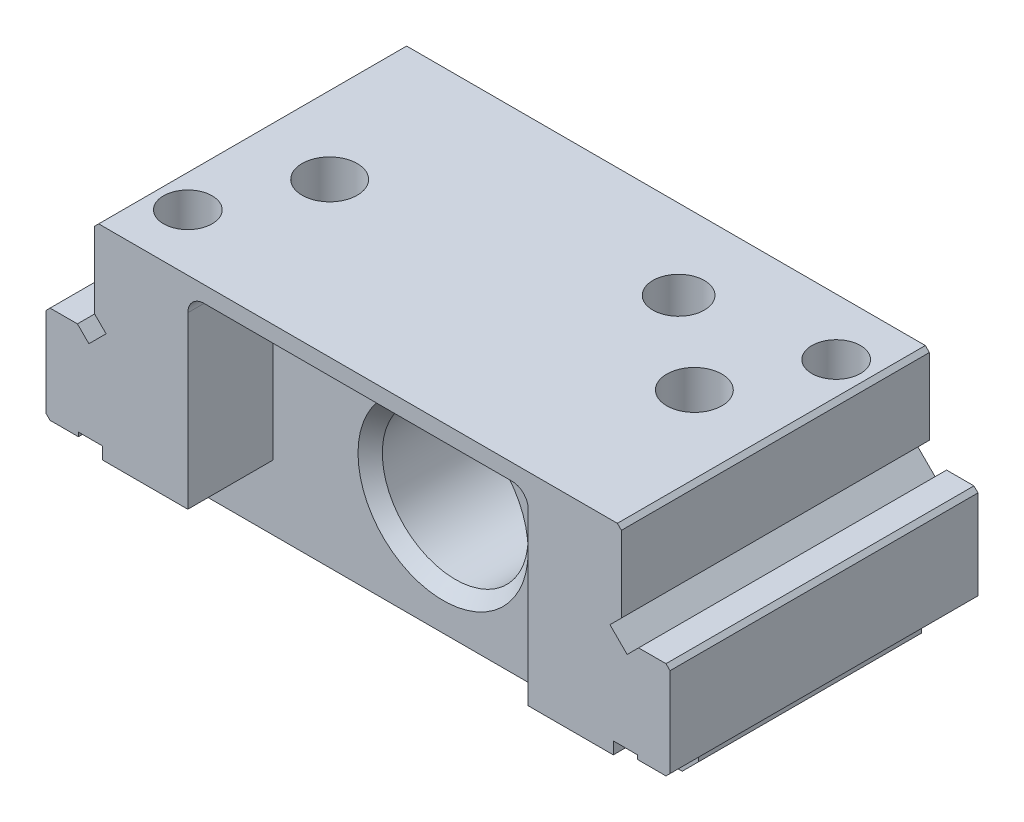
ISO-10303-21;
HEADER;
FILE_DESCRIPTION(('STEP AP214'),'2;1');
FILE_NAME('part.step','',(''),(''),'','','');
FILE_SCHEMA(('AUTOMOTIVE_DESIGN { 1 0 10303 214 1 1 1 1 }'));
ENDSEC;
DATA;
#1=APPLICATION_CONTEXT('core data for automotive mechanical design processes');
#2=APPLICATION_PROTOCOL_DEFINITION('international standard','automotive_design',2000,#1);
#3=PRODUCT_CONTEXT('',#1,'mechanical');
#4=PRODUCT('Part','Part','',(#3));
#5=PRODUCT_RELATED_PRODUCT_CATEGORY('part','',(#4));
#6=PRODUCT_DEFINITION_FORMATION('','',#4);
#7=PRODUCT_DEFINITION_CONTEXT('part definition',#1,'design');
#8=PRODUCT_DEFINITION('design','',#6,#7);
#9=PRODUCT_DEFINITION_SHAPE('','',#8);
#10=(LENGTH_UNIT() NAMED_UNIT(*) SI_UNIT(.MILLI.,.METRE.));
#11=(NAMED_UNIT(*) PLANE_ANGLE_UNIT() SI_UNIT($,.RADIAN.));
#12=(NAMED_UNIT(*) SI_UNIT($,.STERADIAN.) SOLID_ANGLE_UNIT());
#13=UNCERTAINTY_MEASURE_WITH_UNIT(LENGTH_MEASURE(1.E-05),#10,'distance_accuracy_value','');
#14=(GEOMETRIC_REPRESENTATION_CONTEXT(3) GLOBAL_UNCERTAINTY_ASSIGNED_CONTEXT((#13)) GLOBAL_UNIT_ASSIGNED_CONTEXT((#10,
#11,#12)) REPRESENTATION_CONTEXT('',''));
#15=CARTESIAN_POINT('',(0.,0.,0.));
#16=DIRECTION('',(0.,0.,1.));
#17=DIRECTION('',(1.,0.,0.));
#18=AXIS2_PLACEMENT_3D('',#15,#16,#17);
#19=CARTESIAN_POINT('',(0.,0.,0.));
#20=DIRECTION('',(0.,0.,-1.));
#21=DIRECTION('',(-1.,0.,0.));
#22=AXIS2_PLACEMENT_3D('',#19,#20,#21);
#23=PLANE('',#22);
#24=DIRECTION('',(1.,0.,0.));
#25=VECTOR('',#24,1.);
#26=CARTESIAN_POINT('',(19.4455128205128,20.974358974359,0.));
#27=LINE('',#26,#25);
#28=CARTESIAN_POINT('',(21.3205128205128,20.974358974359,0.));
#29=VERTEX_POINT('',#28);
#30=CARTESIAN_POINT('',(19.4455128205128,20.974358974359,0.));
#31=VERTEX_POINT('',#30);
#32=EDGE_CURVE('E381',#29,#31,#27,.F.);
#33=ORIENTED_EDGE('',*,*,#32,.F.);
#34=DIRECTION('',(0.,1.,0.));
#35=VECTOR('',#34,1.);
#36=CARTESIAN_POINT('',(21.3205128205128,20.974358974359,0.));
#37=LINE('',#36,#35);
#38=CARTESIAN_POINT('',(21.3205128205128,17.6410256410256,0.));
#39=VERTEX_POINT('',#38);
#40=EDGE_CURVE('E648',#39,#29,#37,.T.);
#41=ORIENTED_EDGE('',*,*,#40,.F.);
#42=DIRECTION('',(0.999970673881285,0.00765841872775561,0.));
#43=VECTOR('',#42,1.);
#44=CARTESIAN_POINT('',(21.3205128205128,17.6410256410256,0.));
#45=LINE('',#44,#43);
#46=CARTESIAN_POINT('',(19.4895833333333,17.6270032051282,0.));
#47=VERTEX_POINT('',#46);
#48=EDGE_CURVE('E404',#47,#39,#45,.T.);
#49=ORIENTED_EDGE('',*,*,#48,.F.);
#50=CARTESIAN_POINT('',(16.8333333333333,19.3277243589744,0.));
#51=CARTESIAN_POINT('',(16.8343626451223,19.3023797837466,0.));
#52=CARTESIAN_POINT('',(16.8353962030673,19.2770283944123,0.));
#53=CARTESIAN_POINT('',(16.8379305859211,19.2263077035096,0.));
#54=CARTESIAN_POINT('',(16.8394321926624,19.2009384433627,0.));
#55=CARTESIAN_POINT('',(16.8433612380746,19.1502608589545,0.));
#56=CARTESIAN_POINT('',(16.8457887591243,19.1249525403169,0.));
#57=CARTESIAN_POINT('',(16.8520916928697,19.074532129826,0.));
#58=CARTESIAN_POINT('',(16.8559659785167,19.0494199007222,0.));
#59=CARTESIAN_POINT('',(16.8651436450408,18.9994294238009,0.));
#60=CARTESIAN_POINT('',(16.8704486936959,18.974551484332,0.));
#61=CARTESIAN_POINT('',(16.8823251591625,18.9250920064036,0.));
#62=CARTESIAN_POINT('',(16.8888972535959,18.9005106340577,0.));
#63=CARTESIAN_POINT('',(16.9102645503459,18.8272696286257,0.));
#64=CARTESIAN_POINT('',(16.9267179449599,18.7790764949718,0.));
#65=CARTESIAN_POINT('',(16.9548683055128,18.7079129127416,0.));
#66=CARTESIAN_POINT('',(16.9648882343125,18.6842657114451,0.));
#67=CARTESIAN_POINT('',(16.9861427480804,18.6375213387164,0.));
#68=CARTESIAN_POINT('',(16.9973773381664,18.6144241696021,0.));
#69=CARTESIAN_POINT('',(17.0328624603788,18.5460634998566,0.));
#70=CARTESIAN_POINT('',(17.058899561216,18.5017175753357,0.));
#71=CARTESIAN_POINT('',(17.1149535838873,18.4157494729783,0.));
#72=CARTESIAN_POINT('',(17.1449637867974,18.3741228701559,0.));
#73=CARTESIAN_POINT('',(17.2086873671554,18.2937886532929,0.));
#74=CARTESIAN_POINT('',(17.2424015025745,18.2550816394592,0.));
#75=CARTESIAN_POINT('',(17.3088722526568,18.1856616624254,0.));
#76=CARTESIAN_POINT('',(17.341216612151,18.1545554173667,0.));
#77=CARTESIAN_POINT('',(17.3917417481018,18.1102204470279,0.));
#78=CARTESIAN_POINT('',(17.4089124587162,18.0958337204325,0.));
#79=CARTESIAN_POINT('',(17.4439357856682,18.0679163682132,0.));
#80=CARTESIAN_POINT('',(17.4617883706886,18.0543857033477,0.));
#81=CARTESIAN_POINT('',(17.5162185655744,18.0151796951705,0.));
#82=CARTESIAN_POINT('',(17.5537498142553,17.9908189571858,0.));
#83=CARTESIAN_POINT('',(17.6113453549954,17.9564705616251,0.));
#84=CARTESIAN_POINT('',(17.6307736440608,17.9453799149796,0.));
#85=CARTESIAN_POINT('',(17.6699823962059,17.9238382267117,0.));
#86=CARTESIAN_POINT('',(17.6897628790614,17.9133872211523,0.));
#87=CARTESIAN_POINT('',(17.7608342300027,17.8772757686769,0.));
#88=CARTESIAN_POINT('',(17.8130509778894,17.8533754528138,0.));
#89=CARTESIAN_POINT('',(17.8928753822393,17.8213804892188,0.));
#90=CARTESIAN_POINT('',(17.9197240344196,17.8113608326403,0.));
#91=CARTESIAN_POINT('',(17.9738734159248,17.7926225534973,0.));
#92=CARTESIAN_POINT('',(18.001174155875,17.7839039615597,0.));
#93=CARTESIAN_POINT('',(18.0840530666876,17.7594073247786,0.));
#94=CARTESIAN_POINT('',(18.1401684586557,17.7454611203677,0.));
#95=CARTESIAN_POINT('',(18.253113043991,17.7207371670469,0.));
#96=CARTESIAN_POINT('',(18.3099428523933,17.7099623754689,0.));
#97=CARTESIAN_POINT('',(18.4140087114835,17.6928122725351,0.));
#98=CARTESIAN_POINT('',(18.4611727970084,17.6859964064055,0.));
#99=CARTESIAN_POINT('',(18.5556867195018,17.6738152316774,0.));
#100=CARTESIAN_POINT('',(18.6030365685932,17.6684500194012,0.));
#101=CARTESIAN_POINT('',(18.6978632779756,17.6589778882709,0.));
#102=CARTESIAN_POINT('',(18.745340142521,17.6548710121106,0.));
#103=CARTESIAN_POINT('',(18.8403787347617,17.6478088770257,0.));
#104=CARTESIAN_POINT('',(18.887940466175,17.6448536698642,0.));
#105=CARTESIAN_POINT('',(18.9585935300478,17.6408473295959,0.));
#106=CARTESIAN_POINT('',(18.9816748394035,17.6395992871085,0.));
#107=CARTESIAN_POINT('',(19.0278415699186,17.6371817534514,0.));
#108=CARTESIAN_POINT('',(19.0509269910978,17.6360122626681,0.));
#109=CARTESIAN_POINT('',(19.1201910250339,17.6327248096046,0.));
#110=CARTESIAN_POINT('',(19.1663820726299,17.6308275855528,0.));
#111=CARTESIAN_POINT('',(19.2587348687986,17.6282687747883,0.));
#112=CARTESIAN_POINT('',(19.3048965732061,17.6276055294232,0.));
#113=CARTESIAN_POINT('',(19.3972367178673,17.6269454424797,0.));
#114=CARTESIAN_POINT('',(19.4434151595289,17.6269487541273,0.));
#115=CARTESIAN_POINT('',(19.4895833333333,17.6270032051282,0.));
#116=B_SPLINE_CURVE_WITH_KNOTS('',3,(#50,#51,#52,#53,#54,#55,#56,#57,#58,#59,#60,#61,#62,#63,
#64,#65,#66,#67,#68,#69,#70,#71,#72,#73,#74,#75,#76,#77,#78,#79,#80,#81,#82,#83,#84,#85,#86,#87,
#88,#89,#90,#91,#92,#93,#94,#95,#96,#97,#98,#99,#100,#101,#102,#103,#104,#105,#106,#107,#108,
#109,#110,#111,#112,#113,#114,#115),.UNSPECIFIED.,.F.,.F.,(4,2,2,2,2,2,2,2,2,2,2,2,2,2,2,2,2,2,
2,2,2,2,2,2,2,2,2,2,2,2,2,2,4),(0.,0.0761078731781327,0.152343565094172,0.228586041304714,
0.304769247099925,0.381041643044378,0.457354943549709,0.609870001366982,0.686890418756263,
0.763911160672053,0.917910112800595,1.07165188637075,1.22542518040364,1.35987089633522,
1.42705112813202,1.49422827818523,1.62825970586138,1.69536458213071,1.76247323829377,
1.9344765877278,2.02041996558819,2.10636536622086,2.27966697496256,2.45312967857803,
2.59606117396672,2.73900215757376,2.8819479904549,3.02490024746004,3.09424539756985,
3.16359088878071,3.30226785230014,3.4407582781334,3.57928053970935),.UNSPECIFIED.);
#117=CARTESIAN_POINT('',(16.8333333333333,19.3277243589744,0.));
#118=VERTEX_POINT('',#117);
#119=EDGE_CURVE('E398',#118,#47,#116,.T.);
#120=ORIENTED_EDGE('',*,*,#119,.F.);
#121=CARTESIAN_POINT('',(19.4455128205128,20.974358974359,0.));
#122=CARTESIAN_POINT('',(19.4206759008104,20.974300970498,0.));
#123=CARTESIAN_POINT('',(19.3958388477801,20.9742423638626,0.));
#124=CARTESIAN_POINT('',(19.3461645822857,20.9740617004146,0.));
#125=CARTESIAN_POINT('',(19.3213273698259,20.9739396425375,0.));
#126=CARTESIAN_POINT('',(19.2716483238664,20.9735697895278,0.));
#127=CARTESIAN_POINT('',(19.2468064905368,20.9733219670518,0.));
#128=CARTESIAN_POINT('',(19.1971253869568,20.9726309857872,0.));
#129=CARTESIAN_POINT('',(19.1722861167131,20.972187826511,0.));
#130=CARTESIAN_POINT('',(19.0971015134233,20.9705005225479,0.));
#131=CARTESIAN_POINT('',(19.0467638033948,20.968901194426,0.));
#132=CARTESIAN_POINT('',(18.9461229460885,20.9648457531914,0.));
#133=CARTESIAN_POINT('',(18.8958197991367,20.9623896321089,0.));
#134=CARTESIAN_POINT('',(18.7933332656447,20.956304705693,0.));
#135=CARTESIAN_POINT('',(18.7411522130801,20.9526343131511,0.));
#136=CARTESIAN_POINT('',(18.6369021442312,20.9438417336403,0.));
#137=CARTESIAN_POINT('',(18.5848331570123,20.9387192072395,0.));
#138=CARTESIAN_POINT('',(18.4807673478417,20.9273692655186,0.));
#139=CARTESIAN_POINT('',(18.4287706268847,20.9211409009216,0.));
#140=CARTESIAN_POINT('',(18.351151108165,20.9104045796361,0.));
#141=CARTESIAN_POINT('',(18.3254311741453,20.906609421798,0.));
#142=CARTESIAN_POINT('',(18.2740874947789,20.8984232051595,0.));
#143=CARTESIAN_POINT('',(18.2484637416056,20.8940321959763,0.));
#144=CARTESIAN_POINT('',(18.1973758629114,20.8845162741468,0.));
#145=CARTESIAN_POINT('',(18.1719116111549,20.8793920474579,0.));
#146=CARTESIAN_POINT('',(18.1211666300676,20.8682885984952,0.));
#147=CARTESIAN_POINT('',(18.0958859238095,20.8623092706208,0.));
#148=CARTESIAN_POINT('',(18.0455508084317,20.8495906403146,0.));
#149=CARTESIAN_POINT('',(18.0204961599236,20.8428522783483,0.));
#150=CARTESIAN_POINT('',(17.9706062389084,20.8286073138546,0.));
#151=CARTESIAN_POINT('',(17.9457709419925,20.8211007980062,0.));
#152=CARTESIAN_POINT('',(17.8999232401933,20.8061096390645,0.));
#153=CARTESIAN_POINT('',(17.8788638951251,20.7987700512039,0.));
#154=CARTESIAN_POINT('',(17.8370880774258,20.7831733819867,0.));
#155=CARTESIAN_POINT('',(17.8163715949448,20.7749163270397,0.));
#156=CARTESIAN_POINT('',(17.775314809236,20.7575188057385,0.));
#157=CARTESIAN_POINT('',(17.754974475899,20.7483784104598,0.));
#158=CARTESIAN_POINT('',(17.7147095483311,20.7292242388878,0.));
#159=CARTESIAN_POINT('',(17.6947849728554,20.7192104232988,0.));
#160=CARTESIAN_POINT('',(17.6357276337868,20.6878878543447,0.));
#161=CARTESIAN_POINT('',(17.5972732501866,20.6652819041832,0.));
#162=CARTESIAN_POINT('',(17.5224132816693,20.6168914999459,0.));
#163=CARTESIAN_POINT('',(17.4860084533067,20.5911058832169,0.));
#164=CARTESIAN_POINT('',(17.4155050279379,20.5366946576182,0.));
#165=CARTESIAN_POINT('',(17.3814017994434,20.5080750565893,0.));
#166=CARTESIAN_POINT('',(17.3157566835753,20.4480502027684,0.));
#167=CARTESIAN_POINT('',(17.2842139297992,20.4166458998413,0.));
#168=CARTESIAN_POINT('',(17.2238615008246,20.3511660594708,0.));
#169=CARTESIAN_POINT('',(17.1950592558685,20.3170836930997,0.));
#170=CARTESIAN_POINT('',(17.1402074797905,20.2467651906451,0.));
#171=CARTESIAN_POINT('',(17.1141587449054,20.2105284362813,0.));
#172=CARTESIAN_POINT('',(17.0642517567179,20.1351319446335,0.));
#173=CARTESIAN_POINT('',(17.040473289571,20.095919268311,0.));
#174=CARTESIAN_POINT('',(16.9962550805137,20.0156369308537,0.));
#175=CARTESIAN_POINT('',(16.9758160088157,19.9745668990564,0.));
#176=CARTESIAN_POINT('',(16.938744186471,19.8908680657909,0.));
#177=CARTESIAN_POINT('',(16.9221011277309,19.8482438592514,0.));
#178=CARTESIAN_POINT('',(16.893081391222,19.7616058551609,0.));
#179=CARTESIAN_POINT('',(16.8806997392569,19.7175937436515,0.));
#180=CARTESIAN_POINT('',(16.8642147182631,19.6448295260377,0.));
#181=CARTESIAN_POINT('',(16.8587398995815,19.6163837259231,0.));
#182=CARTESIAN_POINT('',(16.849820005,19.5591561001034,0.));
#183=CARTESIAN_POINT('',(16.8463763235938,19.5303740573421,0.));
#184=CARTESIAN_POINT('',(16.8409667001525,19.4726074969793,0.));
#185=CARTESIAN_POINT('',(16.839004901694,19.4436226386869,0.));
#186=CARTESIAN_POINT('',(16.8358130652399,19.3856606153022,0.));
#187=CARTESIAN_POINT('',(16.8345817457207,19.3566835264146,0.));
#188=CARTESIAN_POINT('',(16.8333333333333,19.3277243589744,0.));
#189=B_SPLINE_CURVE_WITH_KNOTS('',3,(#121,#122,#123,#124,#125,#126,#127,#128,#129,#130,#131,
#132,#133,#134,#135,#136,#137,#138,#139,#140,#141,#142,#143,#144,#145,#146,#147,#148,#149,#150,
#151,#152,#153,#154,#155,#156,#157,#158,#159,#160,#161,#162,#163,#164,#165,#166,#167,#168,#169,
#170,#171,#172,#173,#174,#175,#176,#177,#178,#179,#180,#181,#182,#183,#184,#185,#186,#187,#188),
.UNSPECIFIED.,.F.,.F.,(4,2,2,2,2,2,2,2,2,2,2,2,2,2,2,2,2,2,2,2,2,2,2,2,2,2,2,2,2,2,2,2,2,4),(0.,
0.0745111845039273,0.149023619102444,0.223552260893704,0.298081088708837,0.449161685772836,
0.60024368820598,0.757154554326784,0.914102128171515,1.07118508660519,1.14917479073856,
1.22715800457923,1.30506873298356,1.38298909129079,1.4608139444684,1.53863002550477,
1.60551489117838,1.67239783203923,1.73927539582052,1.80615597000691,1.93979374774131,
2.07348053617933,2.20688975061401,2.34025363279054,2.47396936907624,2.60772366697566,
2.74515061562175,2.88260511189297,3.01968178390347,3.1565979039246,3.24343680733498,
3.33033526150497,3.41747580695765,3.50446302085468),.UNSPECIFIED.);
#190=EDGE_CURVE('E23',#31,#118,#189,.T.);
#191=ORIENTED_EDGE('',*,*,#190,.F.);
#192=EDGE_LOOP('',(#33,#41,#49,#120,#191));
#193=FACE_BOUND('',#192,.T.);
#194=ADVANCED_FACE('F16',(#193),#23,.T.);
#195=CARTESIAN_POINT('',(21.3205128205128,20.974358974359,0.299999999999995));
#196=DIRECTION('',(1.,0.,0.));
#197=DIRECTION('',(0.,0.,-1.));
#198=AXIS2_PLACEMENT_3D('',#195,#196,#197);
#199=PLANE('',#198);
#200=ORIENTED_EDGE('',*,*,#40,.T.);
#201=DIRECTION('',(0.,0.,1.));
#202=VECTOR('',#201,1.);
#203=CARTESIAN_POINT('',(21.3205128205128,20.974358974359,0.299999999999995));
#204=LINE('',#203,#202);
#205=CARTESIAN_POINT('',(21.3205128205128,20.974358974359,0.299999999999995));
#206=VERTEX_POINT('',#205);
#207=EDGE_CURVE('E646',#206,#29,#204,.F.);
#208=ORIENTED_EDGE('',*,*,#207,.F.);
#209=DIRECTION('',(0.,1.,0.));
#210=VECTOR('',#209,1.);
#211=CARTESIAN_POINT('',(21.3205128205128,21.9785904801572,0.299999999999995));
#212=LINE('',#211,#210);
#213=CARTESIAN_POINT('',(21.3205128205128,17.6410256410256,0.299999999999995));
#214=VERTEX_POINT('',#213);
#215=EDGE_CURVE('E589',#214,#206,#212,.T.);
#216=ORIENTED_EDGE('',*,*,#215,.F.);
#217=DIRECTION('',(0.,0.,1.));
#218=VECTOR('',#217,1.);
#219=CARTESIAN_POINT('',(21.3205128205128,17.6410256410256,0.299999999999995));
#220=LINE('',#219,#218);
#221=EDGE_CURVE('E638',#39,#214,#220,.T.);
#222=ORIENTED_EDGE('',*,*,#221,.F.);
#223=EDGE_LOOP('',(#200,#208,#216,#222));
#224=FACE_BOUND('',#223,.T.);
#225=ADVANCED_FACE('F427',(#224),#199,.T.);
#226=CARTESIAN_POINT('',(19.4455128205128,20.974358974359,0.299999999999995));
#227=DIRECTION('',(0.,1.,0.));
#228=DIRECTION('',(0.,0.,1.));
#229=AXIS2_PLACEMENT_3D('',#226,#227,#228);
#230=PLANE('',#229);
#231=ORIENTED_EDGE('',*,*,#32,.T.);
#232=DIRECTION('',(0.,0.,-1.));
#233=VECTOR('',#232,1.);
#234=CARTESIAN_POINT('',(19.4455128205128,20.974358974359,0.149999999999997));
#235=LINE('',#234,#233);
#236=CARTESIAN_POINT('',(19.4455128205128,20.974358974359,0.299999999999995));
#237=VERTEX_POINT('',#236);
#238=EDGE_CURVE('E392',#237,#31,#235,.T.);
#239=ORIENTED_EDGE('',*,*,#238,.F.);
#240=DIRECTION('',(-1.,0.,0.));
#241=VECTOR('',#240,1.);
#242=CARTESIAN_POINT('',(19.0805080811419,20.974358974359,0.299999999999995));
#243=LINE('',#242,#241);
#244=EDGE_CURVE('E587',#206,#237,#243,.T.);
#245=ORIENTED_EDGE('',*,*,#244,.F.);
#246=ORIENTED_EDGE('',*,*,#207,.T.);
#247=EDGE_LOOP('',(#231,#239,#245,#246));
#248=FACE_BOUND('',#247,.T.);
#249=ADVANCED_FACE('F434',(#248),#230,.T.);
#250=CARTESIAN_POINT('',(16.8333333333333,19.3277243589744,0.299999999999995));
#251=CARTESIAN_POINT('',(16.8333333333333,19.3277243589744,0.));
#252=CARTESIAN_POINT('',(16.8367679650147,19.4081431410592,0.299999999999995));
#253=CARTESIAN_POINT('',(16.8367679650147,19.4081431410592,0.));
#254=CARTESIAN_POINT('',(16.8435741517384,19.567503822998,0.299999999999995));
#255=CARTESIAN_POINT('',(16.8435741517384,19.567503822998,0.));
#256=CARTESIAN_POINT('',(16.8991420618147,19.8008064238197,0.299999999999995));
#257=CARTESIAN_POINT('',(16.8991420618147,19.8008064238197,0.));
#258=CARTESIAN_POINT('',(16.9931117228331,20.0209977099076,0.299999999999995));
#259=CARTESIAN_POINT('',(16.9931117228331,20.0209977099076,0.));
#260=CARTESIAN_POINT('',(17.1197466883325,20.2271819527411,0.299999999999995));
#261=CARTESIAN_POINT('',(17.1197466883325,20.2271819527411,0.));
#262=CARTESIAN_POINT('',(17.2740299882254,20.4143411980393,0.299999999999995));
#263=CARTESIAN_POINT('',(17.2740299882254,20.4143411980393,0.));
#264=CARTESIAN_POINT('',(17.4549380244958,20.5744759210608,0.299999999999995));
#265=CARTESIAN_POINT('',(17.4549380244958,20.5744759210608,0.));
#266=CARTESIAN_POINT('',(17.6575242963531,20.7066172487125,0.299999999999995));
#267=CARTESIAN_POINT('',(17.6575242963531,20.7066172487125,0.));
#268=CARTESIAN_POINT('',(17.8468705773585,20.7910583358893,0.299999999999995));
#269=CARTESIAN_POINT('',(17.8468705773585,20.7910583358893,0.));
#270=CARTESIAN_POINT('',(18.0161111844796,20.8428293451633,0.299999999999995));
#271=CARTESIAN_POINT('',(18.0161111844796,20.8428293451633,0.));
#272=CARTESIAN_POINT('',(18.1630530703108,20.8792612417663,0.299999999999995));
#273=CARTESIAN_POINT('',(18.1630530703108,20.8792612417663,0.));
#274=CARTESIAN_POINT('',(18.3290858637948,20.9085311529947,0.299999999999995));
#275=CARTESIAN_POINT('',(18.3290858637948,20.9085311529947,0.));
#276=CARTESIAN_POINT('',(18.5150157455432,20.9319827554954,0.299999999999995));
#277=CARTESIAN_POINT('',(18.5150157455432,20.9319827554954,0.));
#278=CARTESIAN_POINT('',(18.7200489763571,20.9521397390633,0.299999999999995));
#279=CARTESIAN_POINT('',(18.7200489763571,20.9521397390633,0.));
#280=CARTESIAN_POINT('',(18.94522226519,20.9657162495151,0.299999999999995));
#281=CARTESIAN_POINT('',(18.94522226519,20.9657162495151,0.));
#282=CARTESIAN_POINT('',(19.1890416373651,20.9737558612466,0.299999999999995));
#283=CARTESIAN_POINT('',(19.1890416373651,20.9737558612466,0.));
#284=CARTESIAN_POINT('',(19.3580328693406,20.9741532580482,0.299999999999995));
#285=CARTESIAN_POINT('',(19.3580328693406,20.9741532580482,0.));
#286=CARTESIAN_POINT('',(19.4455128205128,20.974358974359,0.299999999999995));
#287=CARTESIAN_POINT('',(19.4455128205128,20.974358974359,0.));
#288=B_SPLINE_SURFACE_WITH_KNOTS('',3,1,((#250,#251),(#252,#253),(#254,#255),(#256,#257),(#258,
#259),(#260,#261),(#262,#263),(#264,#265),(#266,#267),(#268,#269),(#270,#271),(#272,#273),(#274,
#275),(#276,#277),(#278,#279),(#280,#281),(#282,#283),(#284,#285),(#286,#287)),.UNSPECIFIED.,
.F.,.F.,.F.,(4,1,1,1,1,1,1,1,1,1,1,1,1,1,1,1,4),(2,2),(0.,0.06881429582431,0.136364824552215,
0.204019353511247,0.273063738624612,0.34291331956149,0.410965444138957,0.479168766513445,
0.549308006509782,0.587651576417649,0.63064666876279,0.678878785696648,0.731934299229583,
0.791111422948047,0.855283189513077,0.925085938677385,1.),(0.,1.),.UNSPECIFIED.);
#289=DIRECTION('',(0.,0.,-1.));
#290=VECTOR('',#289,1.);
#291=CARTESIAN_POINT('',(16.8333333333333,19.3277243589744,0.149999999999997));
#292=LINE('',#291,#290);
#293=CARTESIAN_POINT('',(16.8333333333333,19.3277243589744,0.299999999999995));
#294=VERTEX_POINT('',#293);
#295=EDGE_CURVE('E390',#294,#118,#292,.T.);
#296=CARTESIAN_POINT('',(19.4455128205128,20.974358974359,0.299999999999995));
#297=CARTESIAN_POINT('',(19.4206759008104,20.974300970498,0.299999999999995));
#298=CARTESIAN_POINT('',(19.3958388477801,20.9742423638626,0.299999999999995));
#299=CARTESIAN_POINT('',(19.3461645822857,20.9740617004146,0.299999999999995));
#300=CARTESIAN_POINT('',(19.3213273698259,20.9739396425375,0.299999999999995));
#301=CARTESIAN_POINT('',(19.2716483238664,20.9735697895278,0.299999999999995));
#302=CARTESIAN_POINT('',(19.2468064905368,20.9733219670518,0.299999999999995));
#303=CARTESIAN_POINT('',(19.1971253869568,20.9726309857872,0.299999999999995));
#304=CARTESIAN_POINT('',(19.1722861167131,20.972187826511,0.299999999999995));
#305=CARTESIAN_POINT('',(19.0971015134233,20.9705005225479,0.299999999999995));
#306=CARTESIAN_POINT('',(19.0467638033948,20.968901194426,0.299999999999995));
#307=CARTESIAN_POINT('',(18.9461229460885,20.9648457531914,0.299999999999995));
#308=CARTESIAN_POINT('',(18.8958197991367,20.9623896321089,0.299999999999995));
#309=CARTESIAN_POINT('',(18.7933332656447,20.956304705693,0.299999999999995));
#310=CARTESIAN_POINT('',(18.7411522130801,20.9526343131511,0.299999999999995));
#311=CARTESIAN_POINT('',(18.6369021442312,20.9438417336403,0.299999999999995));
#312=CARTESIAN_POINT('',(18.5848331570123,20.9387192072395,0.299999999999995));
#313=CARTESIAN_POINT('',(18.4807673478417,20.9273692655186,0.299999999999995));
#314=CARTESIAN_POINT('',(18.4287706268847,20.9211409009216,0.299999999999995));
#315=CARTESIAN_POINT('',(18.351151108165,20.9104045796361,0.299999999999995));
#316=CARTESIAN_POINT('',(18.3254311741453,20.906609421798,0.299999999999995));
#317=CARTESIAN_POINT('',(18.2740874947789,20.8984232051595,0.299999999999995));
#318=CARTESIAN_POINT('',(18.2484637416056,20.8940321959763,0.299999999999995));
#319=CARTESIAN_POINT('',(18.1973758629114,20.8845162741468,0.299999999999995));
#320=CARTESIAN_POINT('',(18.1719116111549,20.8793920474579,0.299999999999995));
#321=CARTESIAN_POINT('',(18.1211666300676,20.8682885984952,0.299999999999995));
#322=CARTESIAN_POINT('',(18.0958859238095,20.8623092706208,0.299999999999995));
#323=CARTESIAN_POINT('',(18.0455508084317,20.8495906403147,0.299999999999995));
#324=CARTESIAN_POINT('',(18.0204961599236,20.8428522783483,0.299999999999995));
#325=CARTESIAN_POINT('',(17.9706062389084,20.8286073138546,0.299999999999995));
#326=CARTESIAN_POINT('',(17.9457709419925,20.8211007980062,0.299999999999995));
#327=CARTESIAN_POINT('',(17.8999232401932,20.8061096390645,0.299999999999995));
#328=CARTESIAN_POINT('',(17.8788638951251,20.7987700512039,0.299999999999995));
#329=CARTESIAN_POINT('',(17.8370880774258,20.7831733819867,0.299999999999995));
#330=CARTESIAN_POINT('',(17.8163715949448,20.7749163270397,0.299999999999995));
#331=CARTESIAN_POINT('',(17.775314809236,20.7575188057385,0.299999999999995));
#332=CARTESIAN_POINT('',(17.754974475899,20.7483784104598,0.299999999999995));
#333=CARTESIAN_POINT('',(17.7147095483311,20.7292242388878,0.299999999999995));
#334=CARTESIAN_POINT('',(17.6947849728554,20.7192104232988,0.299999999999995));
#335=CARTESIAN_POINT('',(17.6357276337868,20.6878878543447,0.299999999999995));
#336=CARTESIAN_POINT('',(17.5972732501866,20.6652819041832,0.299999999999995));
#337=CARTESIAN_POINT('',(17.5224132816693,20.6168914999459,0.299999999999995));
#338=CARTESIAN_POINT('',(17.4860084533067,20.5911058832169,0.299999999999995));
#339=CARTESIAN_POINT('',(17.4155050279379,20.5366946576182,0.299999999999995));
#340=CARTESIAN_POINT('',(17.3814017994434,20.5080750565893,0.299999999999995));
#341=CARTESIAN_POINT('',(17.3157566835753,20.4480502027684,0.299999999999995));
#342=CARTESIAN_POINT('',(17.2842139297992,20.4166458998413,0.299999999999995));
#343=CARTESIAN_POINT('',(17.2238615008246,20.3511660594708,0.299999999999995));
#344=CARTESIAN_POINT('',(17.1950592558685,20.3170836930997,0.299999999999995));
#345=CARTESIAN_POINT('',(17.1402074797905,20.2467651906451,0.299999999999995));
#346=CARTESIAN_POINT('',(17.1141587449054,20.2105284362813,0.299999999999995));
#347=CARTESIAN_POINT('',(17.0642517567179,20.1351319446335,0.299999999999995));
#348=CARTESIAN_POINT('',(17.040473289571,20.095919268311,0.299999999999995));
#349=CARTESIAN_POINT('',(16.9962550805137,20.0156369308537,0.299999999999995));
#350=CARTESIAN_POINT('',(16.9758160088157,19.9745668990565,0.299999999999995));
#351=CARTESIAN_POINT('',(16.938744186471,19.8908680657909,0.299999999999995));
#352=CARTESIAN_POINT('',(16.9221011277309,19.8482438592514,0.299999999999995));
#353=CARTESIAN_POINT('',(16.893081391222,19.7616058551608,0.299999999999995));
#354=CARTESIAN_POINT('',(16.8806997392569,19.7175937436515,0.299999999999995));
#355=CARTESIAN_POINT('',(16.8642147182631,19.6448295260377,0.299999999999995));
#356=CARTESIAN_POINT('',(16.8587398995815,19.6163837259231,0.299999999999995));
#357=CARTESIAN_POINT('',(16.849820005,19.5591561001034,0.299999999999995));
#358=CARTESIAN_POINT('',(16.8463763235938,19.5303740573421,0.299999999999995));
#359=CARTESIAN_POINT('',(16.8409667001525,19.4726074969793,0.299999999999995));
#360=CARTESIAN_POINT('',(16.839004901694,19.4436226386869,0.299999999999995));
#361=CARTESIAN_POINT('',(16.8358130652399,19.3856606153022,0.299999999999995));
#362=CARTESIAN_POINT('',(16.8345817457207,19.3566835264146,0.299999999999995));
#363=CARTESIAN_POINT('',(16.8333333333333,19.3277243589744,0.299999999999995));
#364=B_SPLINE_CURVE_WITH_KNOTS('',3,(#296,#297,#298,#299,#300,#301,#302,#303,#304,#305,#306,
#307,#308,#309,#310,#311,#312,#313,#314,#315,#316,#317,#318,#319,#320,#321,#322,#323,#324,#325,
#326,#327,#328,#329,#330,#331,#332,#333,#334,#335,#336,#337,#338,#339,#340,#341,#342,#343,#344,
#345,#346,#347,#348,#349,#350,#351,#352,#353,#354,#355,#356,#357,#358,#359,#360,#361,#362,#363),
.UNSPECIFIED.,.F.,.F.,(4,2,2,2,2,2,2,2,2,2,2,2,2,2,2,2,2,2,2,2,2,2,2,2,2,2,2,2,2,2,2,2,2,4),(0.,
0.0745111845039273,0.149023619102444,0.223552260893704,0.298081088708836,0.449161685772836,
0.60024368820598,0.757154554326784,0.914102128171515,1.07118508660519,1.14917479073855,
1.22715800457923,1.30506873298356,1.38298909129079,1.4608139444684,1.53863002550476,
1.60551489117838,1.67239783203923,1.73927539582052,1.80615597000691,1.93979374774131,
2.07348053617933,2.206889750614,2.34025363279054,2.47396936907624,2.60772366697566,
2.74515061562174,2.88260511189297,3.01968178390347,3.1565979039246,3.24343680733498,
3.33033526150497,3.41747580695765,3.50446302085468),.UNSPECIFIED.);
#365=EDGE_CURVE('E413',#237,#294,#364,.T.);
#366=ORIENTED_EDGE('',*,*,#190,.T.);
#367=ORIENTED_EDGE('',*,*,#295,.F.);
#368=ORIENTED_EDGE('',*,*,#365,.F.);
#369=ORIENTED_EDGE('',*,*,#238,.T.);
#370=EDGE_LOOP('',(#366,#367,#368,#369));
#371=FACE_BOUND('',#370,.T.);
#372=ADVANCED_FACE('F388',(#371),#288,.T.);
#373=CARTESIAN_POINT('',(19.4895833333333,17.6270032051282,0.299999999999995));
#374=CARTESIAN_POINT('',(19.4895833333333,17.6270032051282,0.));
#375=CARTESIAN_POINT('',(19.4040975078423,17.6269653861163,0.299999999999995));
#376=CARTESIAN_POINT('',(19.4040975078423,17.6269653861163,0.));
#377=CARTESIAN_POINT('',(19.2384016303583,17.6268920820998,0.299999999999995));
#378=CARTESIAN_POINT('',(19.2384016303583,17.6268920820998,0.));
#379=CARTESIAN_POINT('',(18.9986854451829,17.6383028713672,0.299999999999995));
#380=CARTESIAN_POINT('',(18.9986854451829,17.6383028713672,0.));
#381=CARTESIAN_POINT('',(18.7754851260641,17.6512837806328,0.299999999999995));
#382=CARTESIAN_POINT('',(18.7754851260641,17.6512837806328,0.));
#383=CARTESIAN_POINT('',(18.5696544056,17.6711390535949,0.299999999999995));
#384=CARTESIAN_POINT('',(18.5696544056,17.6711390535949,0.));
#385=CARTESIAN_POINT('',(18.3811013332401,17.6967278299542,0.299999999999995));
#386=CARTESIAN_POINT('',(18.3811013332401,17.6967278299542,0.));
#387=CARTESIAN_POINT('',(18.209920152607,17.7287363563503,0.299999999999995));
#388=CARTESIAN_POINT('',(18.209920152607,17.7287363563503,0.));
#389=CARTESIAN_POINT('',(18.055831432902,17.7660279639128,0.299999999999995));
#390=CARTESIAN_POINT('',(18.055831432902,17.7660279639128,0.));
#391=CARTESIAN_POINT('',(17.8761213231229,17.8237468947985,0.299999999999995));
#392=CARTESIAN_POINT('',(17.8761213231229,17.8237468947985,0.));
#393=CARTESIAN_POINT('',(17.6754455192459,17.9151926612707,0.299999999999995));
#394=CARTESIAN_POINT('',(17.6754455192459,17.9151926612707,0.));
#395=CARTESIAN_POINT('',(17.4573556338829,18.0482369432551,0.299999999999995));
#396=CARTESIAN_POINT('',(17.4573556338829,18.0482369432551,0.));
#397=CARTESIAN_POINT('',(17.2716346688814,18.2155772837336,0.299999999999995));
#398=CARTESIAN_POINT('',(17.2716346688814,18.2155772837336,0.));
#399=CARTESIAN_POINT('',(17.1147264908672,18.4069300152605,0.299999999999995));
#400=CARTESIAN_POINT('',(17.1147264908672,18.4069300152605,0.));
#401=CARTESIAN_POINT('',(16.9886424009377,18.6173192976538,0.299999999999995));
#402=CARTESIAN_POINT('',(16.9886424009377,18.6173192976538,0.));
#403=CARTESIAN_POINT('',(16.8997508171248,18.8442232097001,0.299999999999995));
#404=CARTESIAN_POINT('',(16.8997508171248,18.8442232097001,0.));
#405=CARTESIAN_POINT('',(16.8433438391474,19.0819134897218,0.299999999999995));
#406=CARTESIAN_POINT('',(16.8433438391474,19.0819134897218,0.));
#407=CARTESIAN_POINT('',(16.836690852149,19.2452795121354,0.299999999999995));
#408=CARTESIAN_POINT('',(16.836690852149,19.2452795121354,0.));
#409=CARTESIAN_POINT('',(16.8333333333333,19.3277243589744,0.299999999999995));
#410=CARTESIAN_POINT('',(16.8333333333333,19.3277243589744,0.));
#411=B_SPLINE_SURFACE_WITH_KNOTS('',3,1,((#373,#374),(#375,#376),(#377,#378),(#379,#380),(#381,
#382),(#383,#384),(#385,#386),(#387,#388),(#389,#390),(#391,#392),(#393,#394),(#395,#396),(#397,
#398),(#399,#400),(#401,#402),(#403,#404),(#405,#406),(#407,#408),(#409,#410)),.UNSPECIFIED.,
.F.,.F.,.F.,(4,1,1,1,1,1,1,1,1,1,1,1,1,1,1,1,4),(2,2),(0.,0.0716681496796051,0.138913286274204,
0.201184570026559,0.259124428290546,0.312255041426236,0.36068150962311,0.405086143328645,
0.445101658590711,0.518777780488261,0.589461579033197,0.658462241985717,0.727283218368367,
0.79632248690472,0.863174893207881,0.930949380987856,1.),(0.,1.),.UNSPECIFIED.);
#412=DIRECTION('',(0.,0.,1.));
#413=VECTOR('',#412,1.);
#414=CARTESIAN_POINT('',(19.4895833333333,17.6270032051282,0.299999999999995));
#415=LINE('',#414,#413);
#416=CARTESIAN_POINT('',(19.4895833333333,17.6270032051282,0.299999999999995));
#417=VERTEX_POINT('',#416);
#418=EDGE_CURVE('E405',#417,#47,#415,.F.);
#419=CARTESIAN_POINT('',(16.8333333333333,19.3277243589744,0.299999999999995));
#420=CARTESIAN_POINT('',(16.8343626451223,19.3023797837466,0.299999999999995));
#421=CARTESIAN_POINT('',(16.8353962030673,19.2770283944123,0.299999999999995));
#422=CARTESIAN_POINT('',(16.8379305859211,19.2263077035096,0.299999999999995));
#423=CARTESIAN_POINT('',(16.8394321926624,19.2009384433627,0.299999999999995));
#424=CARTESIAN_POINT('',(16.8433612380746,19.1502608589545,0.299999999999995));
#425=CARTESIAN_POINT('',(16.8457887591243,19.1249525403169,0.299999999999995));
#426=CARTESIAN_POINT('',(16.8520916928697,19.074532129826,0.299999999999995));
#427=CARTESIAN_POINT('',(16.8559659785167,19.0494199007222,0.299999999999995));
#428=CARTESIAN_POINT('',(16.8651436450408,18.9994294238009,0.299999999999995));
#429=CARTESIAN_POINT('',(16.8704486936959,18.974551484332,0.299999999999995));
#430=CARTESIAN_POINT('',(16.8823251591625,18.9250920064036,0.299999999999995));
#431=CARTESIAN_POINT('',(16.8888972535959,18.9005106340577,0.299999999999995));
#432=CARTESIAN_POINT('',(16.9102645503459,18.8272696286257,0.299999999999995));
#433=CARTESIAN_POINT('',(16.9267179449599,18.7790764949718,0.299999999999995));
#434=CARTESIAN_POINT('',(16.9548683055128,18.7079129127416,0.299999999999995));
#435=CARTESIAN_POINT('',(16.9648882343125,18.6842657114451,0.299999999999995));
#436=CARTESIAN_POINT('',(16.9861427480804,18.6375213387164,0.299999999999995));
#437=CARTESIAN_POINT('',(16.9973773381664,18.6144241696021,0.299999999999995));
#438=CARTESIAN_POINT('',(17.0328624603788,18.5460634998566,0.299999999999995));
#439=CARTESIAN_POINT('',(17.058899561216,18.5017175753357,0.299999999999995));
#440=CARTESIAN_POINT('',(17.1149535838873,18.4157494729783,0.299999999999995));
#441=CARTESIAN_POINT('',(17.1449637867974,18.3741228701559,0.299999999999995));
#442=CARTESIAN_POINT('',(17.2086873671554,18.2937886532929,0.299999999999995));
#443=CARTESIAN_POINT('',(17.2424015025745,18.2550816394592,0.299999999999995));
#444=CARTESIAN_POINT('',(17.3088722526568,18.1856616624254,0.299999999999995));
#445=CARTESIAN_POINT('',(17.341216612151,18.1545554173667,0.299999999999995));
#446=CARTESIAN_POINT('',(17.3917417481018,18.1102204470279,0.299999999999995));
#447=CARTESIAN_POINT('',(17.4089124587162,18.0958337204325,0.299999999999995));
#448=CARTESIAN_POINT('',(17.4439357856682,18.0679163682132,0.299999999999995));
#449=CARTESIAN_POINT('',(17.4617883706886,18.0543857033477,0.299999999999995));
#450=CARTESIAN_POINT('',(17.5162185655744,18.0151796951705,0.299999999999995));
#451=CARTESIAN_POINT('',(17.5537498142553,17.9908189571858,0.299999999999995));
#452=CARTESIAN_POINT('',(17.6113453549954,17.9564705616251,0.299999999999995));
#453=CARTESIAN_POINT('',(17.6307736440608,17.9453799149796,0.299999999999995));
#454=CARTESIAN_POINT('',(17.6699823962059,17.9238382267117,0.299999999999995));
#455=CARTESIAN_POINT('',(17.6897628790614,17.9133872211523,0.299999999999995));
#456=CARTESIAN_POINT('',(17.7608342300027,17.8772757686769,0.299999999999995));
#457=CARTESIAN_POINT('',(17.8130509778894,17.8533754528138,0.299999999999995));
#458=CARTESIAN_POINT('',(17.8928753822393,17.8213804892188,0.299999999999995));
#459=CARTESIAN_POINT('',(17.9197240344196,17.8113608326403,0.299999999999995));
#460=CARTESIAN_POINT('',(17.9738734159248,17.7926225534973,0.299999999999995));
#461=CARTESIAN_POINT('',(18.001174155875,17.7839039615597,0.299999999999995));
#462=CARTESIAN_POINT('',(18.0840530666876,17.7594073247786,0.299999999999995));
#463=CARTESIAN_POINT('',(18.1401684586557,17.7454611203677,0.299999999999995));
#464=CARTESIAN_POINT('',(18.253113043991,17.7207371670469,0.299999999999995));
#465=CARTESIAN_POINT('',(18.3099428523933,17.7099623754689,0.299999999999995));
#466=CARTESIAN_POINT('',(18.4140087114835,17.6928122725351,0.299999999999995));
#467=CARTESIAN_POINT('',(18.4611727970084,17.6859964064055,0.299999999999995));
#468=CARTESIAN_POINT('',(18.5556867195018,17.6738152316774,0.299999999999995));
#469=CARTESIAN_POINT('',(18.6030365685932,17.6684500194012,0.299999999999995));
#470=CARTESIAN_POINT('',(18.6978632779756,17.6589778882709,0.299999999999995));
#471=CARTESIAN_POINT('',(18.745340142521,17.6548710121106,0.299999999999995));
#472=CARTESIAN_POINT('',(18.8403787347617,17.6478088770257,0.299999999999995));
#473=CARTESIAN_POINT('',(18.887940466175,17.6448536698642,0.299999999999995));
#474=CARTESIAN_POINT('',(18.9585935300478,17.6408473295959,0.299999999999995));
#475=CARTESIAN_POINT('',(18.9816748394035,17.6395992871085,0.299999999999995));
#476=CARTESIAN_POINT('',(19.0278415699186,17.6371817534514,0.299999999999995));
#477=CARTESIAN_POINT('',(19.0509269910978,17.6360122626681,0.299999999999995));
#478=CARTESIAN_POINT('',(19.1201910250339,17.6327248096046,0.299999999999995));
#479=CARTESIAN_POINT('',(19.1663820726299,17.6308275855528,0.299999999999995));
#480=CARTESIAN_POINT('',(19.2587348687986,17.6282687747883,0.299999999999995));
#481=CARTESIAN_POINT('',(19.3048965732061,17.6276055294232,0.299999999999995));
#482=CARTESIAN_POINT('',(19.3972367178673,17.6269454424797,0.299999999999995));
#483=CARTESIAN_POINT('',(19.4434151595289,17.6269487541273,0.299999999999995));
#484=CARTESIAN_POINT('',(19.4895833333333,17.6270032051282,0.299999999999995));
#485=B_SPLINE_CURVE_WITH_KNOTS('',3,(#419,#420,#421,#422,#423,#424,#425,#426,#427,#428,#429,
#430,#431,#432,#433,#434,#435,#436,#437,#438,#439,#440,#441,#442,#443,#444,#445,#446,#447,#448,
#449,#450,#451,#452,#453,#454,#455,#456,#457,#458,#459,#460,#461,#462,#463,#464,#465,#466,#467,
#468,#469,#470,#471,#472,#473,#474,#475,#476,#477,#478,#479,#480,#481,#482,#483,#484),
.UNSPECIFIED.,.F.,.F.,(4,2,2,2,2,2,2,2,2,2,2,2,2,2,2,2,2,2,2,2,2,2,2,2,2,2,2,2,2,2,2,2,4),(0.,
0.0761078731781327,0.152343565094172,0.228586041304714,0.304769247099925,0.381041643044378,
0.457354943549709,0.609870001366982,0.686890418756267,0.763911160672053,0.917910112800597,
1.07165188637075,1.22542518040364,1.35987089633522,1.42705112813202,1.49422827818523,
1.62825970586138,1.69536458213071,1.76247323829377,1.9344765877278,2.02041996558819,
2.10636536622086,2.27966697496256,2.45312967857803,2.59606117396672,2.73900215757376,
2.88194799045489,3.02490024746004,3.09424539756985,3.16359088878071,3.30226785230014,
3.4407582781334,3.57928053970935),.UNSPECIFIED.);
#486=EDGE_CURVE('E400',#294,#417,#485,.T.);
#487=ORIENTED_EDGE('',*,*,#119,.T.);
#488=ORIENTED_EDGE('',*,*,#418,.F.);
#489=ORIENTED_EDGE('',*,*,#486,.F.);
#490=ORIENTED_EDGE('',*,*,#295,.T.);
#491=EDGE_LOOP('',(#487,#488,#489,#490));
#492=FACE_BOUND('',#491,.T.);
#493=ADVANCED_FACE('F396',(#492),#411,.T.);
#494=CARTESIAN_POINT('',(21.3205128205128,17.6410256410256,0.299999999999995));
#495=DIRECTION('',(0.00765841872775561,-0.999970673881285,0.));
#496=DIRECTION('',(0.999970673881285,0.00765841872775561,0.));
#497=AXIS2_PLACEMENT_3D('',#494,#495,#496);
#498=PLANE('',#497);
#499=ORIENTED_EDGE('',*,*,#48,.T.);
#500=ORIENTED_EDGE('',*,*,#221,.T.);
#501=DIRECTION('',(0.999970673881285,0.0076584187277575,0.));
#502=VECTOR('',#501,1.);
#503=CARTESIAN_POINT('',(19.4895833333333,17.6270032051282,0.299999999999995));
#504=LINE('',#503,#502);
#505=EDGE_CURVE('E569',#417,#214,#504,.T.);
#506=ORIENTED_EDGE('',*,*,#505,.F.);
#507=ORIENTED_EDGE('',*,*,#418,.T.);
#508=EDGE_LOOP('',(#499,#500,#506,#507));
#509=FACE_BOUND('',#508,.T.);
#510=ADVANCED_FACE('F446',(#509),#498,.T.);
#511=CARTESIAN_POINT('',(0.,14.,27.5));
#512=DIRECTION('',(0.,0.,1.));
#513=DIRECTION('',(1.,0.,0.));
#514=AXIS2_PLACEMENT_3D('',#511,#512,#513);
#515=CONICAL_SURFACE('',#514,10.5,0.785398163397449);
#516=CARTESIAN_POINT('',(0.,14.,26.));
#517=DIRECTION('',(0.,0.,1.));
#518=DIRECTION('',(1.,0.,0.));
#519=AXIS2_PLACEMENT_3D('',#516,#517,#518);
#520=CIRCLE('',#519,9.);
#521=CARTESIAN_POINT('',(9.,14.,26.));
#522=VERTEX_POINT('',#521);
#523=EDGE_CURVE('E634',#522,#522,#520,.F.);
#524=ORIENTED_EDGE('',*,*,#523,.T.);
#525=EDGE_LOOP('',(#524));
#526=FACE_BOUND('',#525,.T.);
#527=CARTESIAN_POINT('',(0.,14.,27.5));
#528=DIRECTION('',(0.,0.,1.));
#529=DIRECTION('',(1.,0.,0.));
#530=AXIS2_PLACEMENT_3D('',#527,#528,#529);
#531=CIRCLE('',#530,10.5);
#532=CARTESIAN_POINT('',(10.5,14.,27.5));
#533=VERTEX_POINT('',#532);
#534=EDGE_CURVE('E570',#533,#533,#531,.F.);
#535=ORIENTED_EDGE('',*,*,#534,.F.);
#536=EDGE_LOOP('',(#535));
#537=FACE_BOUND('',#536,.T.);
#538=ADVANCED_FACE('F557',(#526,#537),#515,.F.);
#539=CARTESIAN_POINT('',(19.0805080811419,21.9785904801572,0.299999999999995));
#540=DIRECTION('',(0.,0.,-1.));
#541=DIRECTION('',(-1.,0.,0.));
#542=AXIS2_PLACEMENT_3D('',#539,#540,#541);
#543=PLANE('',#542);
#544=ORIENTED_EDGE('',*,*,#486,.T.);
#545=ORIENTED_EDGE('',*,*,#505,.T.);
#546=ORIENTED_EDGE('',*,*,#215,.T.);
#547=ORIENTED_EDGE('',*,*,#244,.T.);
#548=ORIENTED_EDGE('',*,*,#365,.T.);
#549=EDGE_LOOP('',(#544,#545,#546,#547,#548));
#550=FACE_BOUND('',#549,.T.);
#551=CARTESIAN_POINT('',(15.9358974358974,19.3257211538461,0.299999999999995));
#552=CARTESIAN_POINT('',(15.9374698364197,19.2757458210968,0.299999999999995));
#553=CARTESIAN_POINT('',(15.9390452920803,19.2257376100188,0.299999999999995));
#554=CARTESIAN_POINT('',(15.9434138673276,19.1257152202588,0.299999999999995));
#555=CARTESIAN_POINT('',(15.9462085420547,19.0757011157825,0.299999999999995));
#556=CARTESIAN_POINT('',(15.9522327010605,19.0007095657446,0.299999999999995));
#557=CARTESIAN_POINT('',(15.9545530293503,18.9756639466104,0.299999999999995));
#558=CARTESIAN_POINT('',(15.9599770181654,18.9256583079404,0.299999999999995));
#559=CARTESIAN_POINT('',(15.9630806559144,18.9006982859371,0.299999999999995));
#560=CARTESIAN_POINT('',(15.9735944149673,18.8260137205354,0.299999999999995));
#561=CARTESIAN_POINT('',(15.9822095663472,18.7764557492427,0.299999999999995));
#562=CARTESIAN_POINT('',(16.0068873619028,18.6560824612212,0.299999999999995));
#563=CARTESIAN_POINT('',(16.0245583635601,18.5855954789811,0.299999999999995));
#564=CARTESIAN_POINT('',(16.0656450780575,18.4462578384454,0.299999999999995));
#565=CARTESIAN_POINT('',(16.0890656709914,18.3774086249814,0.299999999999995));
#566=CARTESIAN_POINT('',(16.1416165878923,18.2419968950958,0.299999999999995));
#567=CARTESIAN_POINT('',(16.1707411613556,18.1754321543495,0.299999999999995));
#568=CARTESIAN_POINT('',(16.2346493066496,18.0451062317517,0.299999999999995));
#569=CARTESIAN_POINT('',(16.2694302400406,17.981343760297,0.299999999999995));
#570=CARTESIAN_POINT('',(16.3442506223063,17.8579889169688,0.299999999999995));
#571=CARTESIAN_POINT('',(16.3842240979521,17.7983566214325,0.299999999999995));
#572=CARTESIAN_POINT('',(16.4694377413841,17.6829726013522,0.299999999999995));
#573=CARTESIAN_POINT('',(16.5146787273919,17.6272214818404,0.299999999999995));
#574=CARTESIAN_POINT('',(16.6100627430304,17.5200852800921,0.299999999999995));
#575=CARTESIAN_POINT('',(16.6602046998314,17.4686992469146,0.299999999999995));
#576=CARTESIAN_POINT('',(16.7388328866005,17.3953154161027,0.299999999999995));
#577=CARTESIAN_POINT('',(16.7656131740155,17.3714687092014,0.299999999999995));
#578=CARTESIAN_POINT('',(16.8202820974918,17.3250827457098,0.299999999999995));
#579=CARTESIAN_POINT('',(16.8481707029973,17.3025434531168,0.299999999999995));
#580=CARTESIAN_POINT('',(16.9282889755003,17.2407369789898,0.299999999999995));
#581=CARTESIAN_POINT('',(16.9816747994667,17.2029567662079,0.299999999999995));
#582=CARTESIAN_POINT('',(17.0636561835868,17.1492371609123,0.299999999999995));
#583=CARTESIAN_POINT('',(17.0913053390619,17.1318196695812,0.299999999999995));
#584=CARTESIAN_POINT('',(17.1471709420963,17.0979201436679,0.299999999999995));
#585=CARTESIAN_POINT('',(17.1753873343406,17.0814380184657,0.299999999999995));
#586=CARTESIAN_POINT('',(17.2323835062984,17.0494704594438,0.299999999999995));
#587=CARTESIAN_POINT('',(17.2611633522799,17.0339851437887,0.299999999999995));
#588=CARTESIAN_POINT('',(17.3192634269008,17.0040752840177,0.299999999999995));
#589=CARTESIAN_POINT('',(17.3485835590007,16.9896505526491,0.299999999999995));
#590=CARTESIAN_POINT('',(17.4077444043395,16.9619351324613,0.299999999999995));
#591=CARTESIAN_POINT('',(17.4375849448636,16.9486440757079,0.299999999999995));
#592=CARTESIAN_POINT('',(17.4977691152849,16.9232314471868,0.299999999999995));
#593=CARTESIAN_POINT('',(17.5281128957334,16.9111102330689,0.299999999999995));
#594=CARTESIAN_POINT('',(17.5849439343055,16.8894123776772,0.299999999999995));
#595=CARTESIAN_POINT('',(17.6113857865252,16.8797153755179,0.299999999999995));
#596=CARTESIAN_POINT('',(17.6644585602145,16.8608472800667,0.299999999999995));
#597=CARTESIAN_POINT('',(17.6910894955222,16.8516762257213,0.299999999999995));
#598=CARTESIAN_POINT('',(17.7445553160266,16.8339594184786,0.299999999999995));
#599=CARTESIAN_POINT('',(17.7713901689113,16.825413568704,0.299999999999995));
#600=CARTESIAN_POINT('',(17.8252986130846,16.809120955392,0.299999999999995));
#601=CARTESIAN_POINT('',(17.8523721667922,16.8013740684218,0.299999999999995));
#602=CARTESIAN_POINT('',(17.9340053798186,16.7794139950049,0.299999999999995));
#603=CARTESIAN_POINT('',(17.9889131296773,16.766503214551,0.299999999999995));
#604=CARTESIAN_POINT('',(18.0715463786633,16.7484347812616,0.299999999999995));
#605=CARTESIAN_POINT('',(18.0991415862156,16.7426272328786,0.299999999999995));
#606=CARTESIAN_POINT('',(18.1544051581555,16.7313711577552,0.299999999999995));
#607=CARTESIAN_POINT('',(18.1820735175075,16.7259226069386,0.299999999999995));
#608=CARTESIAN_POINT('',(18.2376136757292,16.7154361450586,0.299999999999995));
#609=CARTESIAN_POINT('',(18.2654858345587,16.7104001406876,0.299999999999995));
#610=CARTESIAN_POINT('',(18.3213151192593,16.7008226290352,0.299999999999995));
#611=CARTESIAN_POINT('',(18.3492722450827,16.6962811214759,0.299999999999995));
#612=CARTESIAN_POINT('',(18.4332427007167,16.6833952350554,0.299999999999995));
#613=CARTESIAN_POINT('',(18.4893693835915,16.6757867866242,0.299999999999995));
#614=CARTESIAN_POINT('',(18.6017703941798,16.6621102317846,0.299999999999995));
#615=CARTESIAN_POINT('',(18.658044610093,16.6560411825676,0.299999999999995));
#616=CARTESIAN_POINT('',(18.7707270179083,16.6452615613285,0.299999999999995));
#617=CARTESIAN_POINT('',(18.8271352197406,16.6405510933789,0.299999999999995));
#618=CARTESIAN_POINT('',(18.9335334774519,16.6328575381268,0.299999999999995));
#619=CARTESIAN_POINT('',(18.9835137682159,16.6297379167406,0.299999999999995));
#620=CARTESIAN_POINT('',(19.0835287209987,16.6245280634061,0.299999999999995));
#621=CARTESIAN_POINT('',(19.1335633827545,16.6224378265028,0.299999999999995));
#622=CARTESIAN_POINT('',(19.2332581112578,16.6192848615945,0.299999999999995));
#623=CARTESIAN_POINT('',(19.2829179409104,16.6182139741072,0.299999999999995));
#624=CARTESIAN_POINT('',(19.3822438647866,16.6165605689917,0.299999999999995));
#625=CARTESIAN_POINT('',(19.4319099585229,16.6159780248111,0.299999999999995));
#626=CARTESIAN_POINT('',(19.4815705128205,16.6153846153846,0.299999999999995));
#627=B_SPLINE_CURVE_WITH_KNOTS('',3,(#551,#552,#553,#554,#555,#556,#557,#558,#559,#560,#561,
#562,#563,#564,#565,#566,#567,#568,#569,#570,#571,#572,#573,#574,#575,#576,#577,#578,#579,#580,
#581,#582,#583,#584,#585,#586,#587,#588,#589,#590,#591,#592,#593,#594,#595,#596,#597,#598,#599,
#600,#601,#602,#603,#604,#605,#606,#607,#608,#609,#610,#611,#612,#613,#614,#615,#616,#617,#618,
#619,#620,#621,#622,#623,#624,#625,#626),.UNSPECIFIED.,.F.,.F.,(4,2,2,2,2,2,2,2,2,2,2,2,2,2,2,2,
2,2,2,2,2,2,2,2,2,2,2,2,2,2,2,2,2,2,2,2,2,4),(0.,0.150057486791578,0.300306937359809,
0.375754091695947,0.451199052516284,0.602002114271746,0.819741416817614,1.0376661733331,
1.2553723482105,1.47297726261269,1.68804740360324,1.90315099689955,2.11820760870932,
2.22574862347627,2.33328667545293,2.52926254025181,2.62728419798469,2.72529634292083,
2.82332008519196,2.92132647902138,3.01930094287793,3.11730526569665,3.20179065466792,
3.28628229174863,3.37076080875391,3.45522625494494,3.62436087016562,3.70896186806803,
3.79355718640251,3.87852368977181,3.96349014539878,4.13337949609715,4.3031645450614,
4.47296259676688,4.62318598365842,4.77340864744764,4.922418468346,5.07142018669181),.UNSPECIFIED.);
#628=CARTESIAN_POINT('',(15.9358974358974,19.3257211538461,0.299999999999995));
#629=VERTEX_POINT('',#628);
#630=CARTESIAN_POINT('',(19.4815705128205,16.6153846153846,0.299999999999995));
#631=VERTEX_POINT('',#630);
#632=EDGE_CURVE('E539',#629,#631,#627,.T.);
#633=ORIENTED_EDGE('',*,*,#632,.F.);
#634=CARTESIAN_POINT('',(17.9511217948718,21.863782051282,0.299999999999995));
#635=CARTESIAN_POINT('',(17.926740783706,21.8577578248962,0.299999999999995));
#636=CARTESIAN_POINT('',(17.9023567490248,21.8517333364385,0.299999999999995));
#637=CARTESIAN_POINT('',(17.8536500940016,21.8393923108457,0.299999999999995));
#638=CARTESIAN_POINT('',(17.8293275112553,21.8330756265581,0.299999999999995));
#639=CARTESIAN_POINT('',(17.7808380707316,21.8198647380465,0.299999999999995));
#640=CARTESIAN_POINT('',(17.7566712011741,21.8129705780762,0.299999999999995));
#641=CARTESIAN_POINT('',(17.7086039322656,21.7983254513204,0.299999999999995));
#642=CARTESIAN_POINT('',(17.6847034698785,21.79057469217,0.299999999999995));
#643=CARTESIAN_POINT('',(17.637128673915,21.774318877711,0.299999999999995));
#644=CARTESIAN_POINT('',(17.6134546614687,21.7658128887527,0.299999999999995));
#645=CARTESIAN_POINT('',(17.566341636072,21.7481647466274,0.299999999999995));
#646=CARTESIAN_POINT('',(17.5429026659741,21.7390224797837,0.299999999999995));
#647=CARTESIAN_POINT('',(17.4729083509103,21.710790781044,0.299999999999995));
#648=CARTESIAN_POINT('',(17.4266752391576,21.6908963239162,0.299999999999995));
#649=CARTESIAN_POINT('',(17.3173675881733,21.6401303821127,0.299999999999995));
#650=CARTESIAN_POINT('',(17.2548513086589,21.6080263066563,0.299999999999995));
#651=CARTESIAN_POINT('',(17.1634481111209,21.5557473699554,0.299999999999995));
#652=CARTESIAN_POINT('',(17.1333703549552,21.5376302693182,0.299999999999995));
#653=CARTESIAN_POINT('',(17.0740608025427,21.5000615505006,0.299999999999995));
#654=CARTESIAN_POINT('',(17.0448289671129,21.4806099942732,0.299999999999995));
#655=CARTESIAN_POINT('',(16.9871830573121,21.4405086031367,0.299999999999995));
#656=CARTESIAN_POINT('',(16.9587693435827,21.4198582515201,0.299999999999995));
#657=CARTESIAN_POINT('',(16.9027682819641,21.3774555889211,0.299999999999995));
#658=CARTESIAN_POINT('',(16.8751810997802,21.3557030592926,0.299999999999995));
#659=CARTESIAN_POINT('',(16.8208338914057,21.3111825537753,0.299999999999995));
#660=CARTESIAN_POINT('',(16.7940739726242,21.2884144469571,0.299999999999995));
#661=CARTESIAN_POINT('',(16.7414554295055,21.2418743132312,0.299999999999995));
#662=CARTESIAN_POINT('',(16.7155964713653,21.2181026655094,0.299999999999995));
#663=CARTESIAN_POINT('',(16.6646732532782,21.1689681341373,0.299999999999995));
#664=CARTESIAN_POINT('',(16.6396268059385,21.1435866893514,0.299999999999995));
#665=CARTESIAN_POINT('',(16.5908186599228,21.0916027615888,0.299999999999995));
#666=CARTESIAN_POINT('',(16.5670575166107,21.0649997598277,0.299999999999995));
#667=CARTESIAN_POINT('',(16.5321164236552,21.0245004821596,0.299999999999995));
#668=CARTESIAN_POINT('',(16.5205862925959,21.0109017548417,0.299999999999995));
#669=CARTESIAN_POINT('',(16.4977118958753,20.9835488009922,0.299999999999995));
#670=CARTESIAN_POINT('',(16.4863676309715,20.9697945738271,0.299999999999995));
#671=CARTESIAN_POINT('',(16.4526487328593,20.9282887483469,0.299999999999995));
#672=CARTESIAN_POINT('',(16.4305802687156,20.9002850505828,0.299999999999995));
#673=CARTESIAN_POINT('',(16.3878071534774,20.8432703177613,0.299999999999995));
#674=CARTESIAN_POINT('',(16.3671016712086,20.8142599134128,0.299999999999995));
#675=CARTESIAN_POINT('',(16.3273717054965,20.7551061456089,0.299999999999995));
#676=CARTESIAN_POINT('',(16.3083474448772,20.724962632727,0.299999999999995));
#677=CARTESIAN_POINT('',(16.2717056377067,20.6638687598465,0.299999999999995));
#678=CARTESIAN_POINT('',(16.2540871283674,20.6329189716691,0.299999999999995));
#679=CARTESIAN_POINT('',(16.2201287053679,20.5703253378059,0.299999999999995));
#680=CARTESIAN_POINT('',(16.2037887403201,20.5386815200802,0.299999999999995));
#681=CARTESIAN_POINT('',(16.1732222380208,20.4758556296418,0.299999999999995));
#682=CARTESIAN_POINT('',(16.1589392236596,20.4447011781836,0.299999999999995));
#683=CARTESIAN_POINT('',(16.1319027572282,20.3817374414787,0.299999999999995));
#684=CARTESIAN_POINT('',(16.1191492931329,20.3499281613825,0.299999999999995));
#685=CARTESIAN_POINT('',(16.0949644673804,20.2857968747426,0.299999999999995));
#686=CARTESIAN_POINT('',(16.0835337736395,20.2534746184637,0.299999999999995));
#687=CARTESIAN_POINT('',(16.0618542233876,20.1884349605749,0.299999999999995));
#688=CARTESIAN_POINT('',(16.0516054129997,20.1557175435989,0.299999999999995));
#689=CARTESIAN_POINT('',(16.0323889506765,20.0898635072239,0.299999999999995));
#690=CARTESIAN_POINT('',(16.0234228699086,20.0567264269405,0.299999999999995));
#691=CARTESIAN_POINT('',(16.0068894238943,19.9901067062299,0.299999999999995));
#692=CARTESIAN_POINT('',(15.9993219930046,19.9566240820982,0.299999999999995));
#693=CARTESIAN_POINT('',(15.9855325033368,19.889409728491,0.299999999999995));
#694=CARTESIAN_POINT('',(15.9793094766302,19.8556781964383,0.299999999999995));
#695=CARTESIAN_POINT('',(15.9681154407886,19.7880091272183,0.299999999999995));
#696=CARTESIAN_POINT('',(15.9631444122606,19.7540715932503,0.299999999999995));
#697=CARTESIAN_POINT('',(15.9546676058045,19.6873064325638,0.299999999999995));
#698=CARTESIAN_POINT('',(15.9511138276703,19.6544849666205,0.299999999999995));
#699=CARTESIAN_POINT('',(15.9467467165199,19.605167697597,0.299999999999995));
#700=CARTESIAN_POINT('',(15.9454515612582,19.5887135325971,0.299999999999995));
#701=CARTESIAN_POINT('',(15.9431958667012,19.555782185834,0.299999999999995));
#702=CARTESIAN_POINT('',(15.9422353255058,19.539305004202,0.299999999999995));
#703=CARTESIAN_POINT('',(15.9397707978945,19.4899929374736,0.299999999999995));
#704=CARTESIAN_POINT('',(15.93867239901,19.4571392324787,0.299999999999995));
#705=CARTESIAN_POINT('',(15.9370159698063,19.3914273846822,0.299999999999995));
#706=CARTESIAN_POINT('',(15.9364577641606,19.3585692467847,0.299999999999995));
#707=CARTESIAN_POINT('',(15.9358974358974,19.3257211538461,0.299999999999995));
#708=B_SPLINE_CURVE_WITH_KNOTS('',3,(#634,#635,#636,#637,#638,#639,#640,#641,#642,#643,#644,
#645,#646,#647,#648,#649,#650,#651,#652,#653,#654,#655,#656,#657,#658,#659,#660,#661,#662,#663,
#664,#665,#666,#667,#668,#669,#670,#671,#672,#673,#674,#675,#676,#677,#678,#679,#680,#681,#682,
#683,#684,#685,#686,#687,#688,#689,#690,#691,#692,#693,#694,#695,#696,#697,#698,#699,#700,#701,
#702,#703,#704,#705,#706,#707),.UNSPECIFIED.,.F.,.F.,(4,2,2,2,2,2,2,2,2,2,2,2,2,2,2,2,2,2,2,2,2,
2,2,2,2,2,2,2,2,2,2,2,2,2,2,2,4),(0.,0.0753476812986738,0.15073373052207,0.226114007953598,
0.301476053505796,0.37693259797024,0.452402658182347,0.60334162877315,0.8138792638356,
0.919186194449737,1.02448823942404,1.12983601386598,1.23520476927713,1.34058714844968,
1.44593005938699,1.55285806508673,1.65983190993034,1.71331759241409,1.76680349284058,
1.87373981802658,1.9806103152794,2.08749495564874,2.19430575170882,2.30111225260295,
2.40388915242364,2.50666524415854,2.60949300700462,2.7123247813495,2.81528145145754,
2.918233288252,3.0211107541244,3.12398662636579,3.22300052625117,3.27251286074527,
3.32202491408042,3.4206329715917,3.51920901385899),.UNSPECIFIED.);
#709=CARTESIAN_POINT('',(17.9511217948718,21.863782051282,0.299999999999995));
#710=VERTEX_POINT('',#709);
#711=EDGE_CURVE('E530',#710,#629,#708,.T.);
#712=ORIENTED_EDGE('',*,*,#711,.F.);
#713=CARTESIAN_POINT('',(20.2167467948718,22.,0.299999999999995));
#714=CARTESIAN_POINT('',(20.1667575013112,21.9998353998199,0.299999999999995));
#715=CARTESIAN_POINT('',(20.1167681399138,21.9996681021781,0.299999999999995));
#716=CARTESIAN_POINT('',(20.0167879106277,21.999263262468,0.299999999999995));
#717=CARTESIAN_POINT('',(19.9667970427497,21.9990257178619,0.299999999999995));
#718=CARTESIAN_POINT('',(19.8667961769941,21.9984154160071,0.299999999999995));
#719=CARTESIAN_POINT('',(19.8167861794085,21.9980426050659,0.299999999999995));
#720=CARTESIAN_POINT('',(19.7167691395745,21.9970611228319,0.299999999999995));
#721=CARTESIAN_POINT('',(19.6667620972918,21.9964524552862,0.299999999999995));
#722=CARTESIAN_POINT('',(19.5667487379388,21.9948298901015,0.299999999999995));
#723=CARTESIAN_POINT('',(19.5167424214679,21.9938159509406,0.299999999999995));
#724=CARTESIAN_POINT('',(19.4167460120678,21.9911914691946,0.299999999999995));
#725=CARTESIAN_POINT('',(19.3667559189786,21.9895809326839,0.299999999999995));
#726=CARTESIAN_POINT('',(19.2668059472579,21.9860011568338,0.299999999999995));
#727=CARTESIAN_POINT('',(19.2168460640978,21.9840320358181,0.299999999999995));
#728=CARTESIAN_POINT('',(19.1419052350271,21.981048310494,0.299999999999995));
#729=CARTESIAN_POINT('',(19.1169236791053,21.9800486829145,0.299999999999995));
#730=CARTESIAN_POINT('',(19.0669602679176,21.9780470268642,0.299999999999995));
#731=CARTESIAN_POINT('',(19.0419784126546,21.9770449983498,0.299999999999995));
#732=CARTESIAN_POINT('',(18.9723678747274,21.9741366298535,0.299999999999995));
#733=CARTESIAN_POINT('',(18.9277425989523,21.9721389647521,0.299999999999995));
#734=CARTESIAN_POINT('',(18.8608309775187,21.9686496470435,0.299999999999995));
#735=CARTESIAN_POINT('',(18.8385320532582,21.9674044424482,0.299999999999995));
#736=CARTESIAN_POINT('',(18.7939473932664,21.9646978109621,0.299999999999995));
#737=CARTESIAN_POINT('',(18.7716616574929,21.9632363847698,0.299999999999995));
#738=CARTESIAN_POINT('',(18.7048409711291,21.9585924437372,0.299999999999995));
#739=CARTESIAN_POINT('',(18.6603243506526,21.9551492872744,0.299999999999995));
#740=CARTESIAN_POINT('',(18.5935677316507,21.9497231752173,0.299999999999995));
#741=CARTESIAN_POINT('',(18.5713166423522,21.9478707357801,0.299999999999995));
#742=CARTESIAN_POINT('',(18.5268182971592,21.944123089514,0.299999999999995));
#743=CARTESIAN_POINT('',(18.504571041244,21.9422278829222,0.299999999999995));
#744=CARTESIAN_POINT('',(18.4377659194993,21.9363552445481,0.299999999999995));
#745=CARTESIAN_POINT('',(18.3932226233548,21.9321967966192,0.299999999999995));
#746=CARTESIAN_POINT('',(18.3265016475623,21.9251300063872,0.299999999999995));
#747=CARTESIAN_POINT('',(18.3042806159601,21.9226366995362,0.299999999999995));
#748=CARTESIAN_POINT('',(18.2598823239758,21.9172927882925,0.299999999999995));
#749=CARTESIAN_POINT('',(18.237705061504,21.914442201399,0.299999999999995));
#750=CARTESIAN_POINT('',(18.1933881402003,21.9083079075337,0.299999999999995));
#751=CARTESIAN_POINT('',(18.1712485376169,21.9050237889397,0.299999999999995));
#752=CARTESIAN_POINT('',(18.1270546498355,21.8979127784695,0.299999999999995));
#753=CARTESIAN_POINT('',(18.1050003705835,21.8940858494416,0.299999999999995));
#754=CARTESIAN_POINT('',(18.0609515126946,21.8859562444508,0.299999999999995));
#755=CARTESIAN_POINT('',(18.0389570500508,21.8816529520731,0.299999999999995));
#756=CARTESIAN_POINT('',(17.9950156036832,21.8728231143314,0.299999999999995));
#757=CARTESIAN_POINT('',(17.9730686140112,21.8682965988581,0.299999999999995));
#758=CARTESIAN_POINT('',(17.9511217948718,21.863782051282,0.299999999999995));
#759=B_SPLINE_CURVE_WITH_KNOTS('',3,(#713,#714,#715,#716,#717,#718,#719,#720,#721,#722,#723,
#724,#725,#726,#727,#728,#729,#730,#731,#732,#733,#734,#735,#736,#737,#738,#739,#740,#741,#742,
#743,#744,#745,#746,#747,#748,#749,#750,#751,#752,#753,#754,#755,#756,#757,#758),.UNSPECIFIED.,
.F.,.F.,(4,2,2,2,2,2,2,2,2,2,2,2,2,2,2,2,2,2,2,2,2,2,4),(0.,0.149968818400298,0.299943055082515,
0.449976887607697,0.600008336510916,0.750055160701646,0.900100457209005,1.05009633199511,
1.12510094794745,1.20010693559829,1.33411392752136,1.40111401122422,1.46811387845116,
1.60205896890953,1.66904316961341,1.73602699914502,1.8702291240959,1.93730821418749,
2.00438402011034,2.07152397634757,2.13866853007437,2.2059010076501,2.27312450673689),.UNSPECIFIED.);
#760=CARTESIAN_POINT('',(20.2167467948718,22.,0.299999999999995));
#761=VERTEX_POINT('',#760);
#762=EDGE_CURVE('E545',#761,#710,#759,.T.);
#763=ORIENTED_EDGE('',*,*,#762,.F.);
#764=DIRECTION('',(1.,0.,0.));
#765=VECTOR('',#764,1.);
#766=CARTESIAN_POINT('',(22.2179487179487,22.,0.299999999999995));
#767=LINE('',#766,#765);
#768=CARTESIAN_POINT('',(22.2179487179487,22.,0.299999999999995));
#769=VERTEX_POINT('',#768);
#770=EDGE_CURVE('E610',#769,#761,#767,.F.);
#771=ORIENTED_EDGE('',*,*,#770,.F.);
#772=DIRECTION('',(0.,1.,0.));
#773=VECTOR('',#772,1.);
#774=CARTESIAN_POINT('',(22.2179487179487,12.,0.299999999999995));
#775=LINE('',#774,#773);
#776=CARTESIAN_POINT('',(22.2179487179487,12.,0.299999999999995));
#777=VERTEX_POINT('',#776);
#778=EDGE_CURVE('E616',#777,#769,#775,.T.);
#779=ORIENTED_EDGE('',*,*,#778,.F.);
#780=DIRECTION('',(1.,0.,0.));
#781=VECTOR('',#780,1.);
#782=CARTESIAN_POINT('',(21.3205128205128,12.,0.299999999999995));
#783=LINE('',#782,#781);
#784=CARTESIAN_POINT('',(21.3205128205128,12.,0.299999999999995));
#785=VERTEX_POINT('',#784);
#786=EDGE_CURVE('E621',#785,#777,#783,.T.);
#787=ORIENTED_EDGE('',*,*,#786,.F.);
#788=DIRECTION('',(0.,1.,0.));
#789=VECTOR('',#788,1.);
#790=CARTESIAN_POINT('',(21.3205128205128,16.6153846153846,0.299999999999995));
#791=LINE('',#790,#789);
#792=CARTESIAN_POINT('',(21.3205128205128,16.6153846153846,0.299999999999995));
#793=VERTEX_POINT('',#792);
#794=EDGE_CURVE('E626',#793,#785,#791,.F.);
#795=ORIENTED_EDGE('',*,*,#794,.F.);
#796=DIRECTION('',(1.,0.,0.));
#797=VECTOR('',#796,1.);
#798=CARTESIAN_POINT('',(20.5913461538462,16.6153846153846,0.299999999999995));
#799=LINE('',#798,#797);
#800=CARTESIAN_POINT('',(20.5913461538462,16.6153846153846,0.299999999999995));
#801=VERTEX_POINT('',#800);
#802=EDGE_CURVE('E628',#801,#793,#799,.T.);
#803=ORIENTED_EDGE('',*,*,#802,.F.);
#804=DIRECTION('',(-0.622788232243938,-0.782390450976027,0.));
#805=VECTOR('',#804,1.);
#806=CARTESIAN_POINT('',(16.9174679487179,12.,0.299999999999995));
#807=LINE('',#806,#805);
#808=CARTESIAN_POINT('',(16.9174679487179,12.,0.299999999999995));
#809=VERTEX_POINT('',#808);
#810=EDGE_CURVE('E705',#809,#801,#807,.F.);
#811=ORIENTED_EDGE('',*,*,#810,.F.);
#812=DIRECTION('',(1.,0.,0.));
#813=VECTOR('',#812,1.);
#814=CARTESIAN_POINT('',(15.8076923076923,12.,0.299999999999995));
#815=LINE('',#814,#813);
#816=CARTESIAN_POINT('',(15.8076923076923,12.,0.299999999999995));
#817=VERTEX_POINT('',#816);
#818=EDGE_CURVE('E599',#817,#809,#815,.T.);
#819=ORIENTED_EDGE('',*,*,#818,.F.);
#820=DIRECTION('',(0.622788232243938,0.782390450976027,0.));
#821=VECTOR('',#820,1.);
#822=CARTESIAN_POINT('',(19.4815705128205,16.6153846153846,0.299999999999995));
#823=LINE('',#822,#821);
#824=EDGE_CURVE('E605',#631,#817,#823,.F.);
#825=ORIENTED_EDGE('',*,*,#824,.F.);
#826=EDGE_LOOP('',(#633,#712,#763,#771,#779,#787,#795,#803,#811,#819,#825));
#827=FACE_BOUND('',#826,.T.);
#828=ADVANCED_FACE('F551',(#550,#827),#543,.T.);
#829=CARTESIAN_POINT('',(0.,14.,5.));
#830=DIRECTION('',(0.,0.,-1.));
#831=DIRECTION('',(-1.,0.,0.));
#832=AXIS2_PLACEMENT_3D('',#829,#830,#831);
#833=CONICAL_SURFACE('',#832,10.5,1.02974425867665);
#834=CARTESIAN_POINT('',(0.,14.,5.90129092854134));
#835=DIRECTION('',(0.,0.,1.));
#836=DIRECTION('',(1.,0.,0.));
#837=AXIS2_PLACEMENT_3D('',#834,#835,#836);
#838=CIRCLE('',#837,9.);
#839=CARTESIAN_POINT('',(9.,14.,5.90129092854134));
#840=VERTEX_POINT('',#839);
#841=EDGE_CURVE('E631',#840,#840,#838,.T.);
#842=ORIENTED_EDGE('',*,*,#841,.T.);
#843=EDGE_LOOP('',(#842));
#844=FACE_BOUND('',#843,.T.);
#845=CARTESIAN_POINT('',(0.,14.,5.));
#846=DIRECTION('',(0.,0.,-1.));
#847=DIRECTION('',(-1.,0.,0.));
#848=AXIS2_PLACEMENT_3D('',#845,#846,#847);
#849=CIRCLE('',#848,10.5);
#850=CARTESIAN_POINT('',(-10.5,14.,5.));
#851=VERTEX_POINT('',#850);
#852=EDGE_CURVE('E595',#851,#851,#849,.T.);
#853=ORIENTED_EDGE('',*,*,#852,.T.);
#854=EDGE_LOOP('',(#853));
#855=FACE_BOUND('',#854,.T.);
#856=ADVANCED_FACE('F556',(#844,#855),#833,.F.);
#857=CARTESIAN_POINT('',(0.,0.,27.5));
#858=DIRECTION('',(0.,0.,1.));
#859=DIRECTION('',(1.,0.,0.));
#860=AXIS2_PLACEMENT_3D('',#857,#858,#859);
#861=PLANE('',#860);
#862=ORIENTED_EDGE('',*,*,#534,.T.);
#863=EDGE_LOOP('',(#862));
#864=FACE_BOUND('',#863,.T.);
#865=DIRECTION('',(-0.707106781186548,-0.707106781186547,0.));
#866=VECTOR('',#865,1.);
#867=CARTESIAN_POINT('',(31.5,2.,27.5));
#868=LINE('',#867,#866);
#869=CARTESIAN_POINT('',(29.5,0.,27.5));
#870=VERTEX_POINT('',#869);
#871=CARTESIAN_POINT('',(31.5,2.,27.5));
#872=VERTEX_POINT('',#871);
#873=EDGE_CURVE('E769',#870,#872,#868,.F.);
#874=ORIENTED_EDGE('',*,*,#873,.T.);
#875=DIRECTION('',(0.,1.,0.));
#876=VECTOR('',#875,1.);
#877=CARTESIAN_POINT('',(31.5,9.49999999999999,27.5));
#878=LINE('',#877,#876);
#879=CARTESIAN_POINT('',(31.5,7.99999999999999,27.5));
#880=VERTEX_POINT('',#879);
#881=EDGE_CURVE('E764',#872,#880,#878,.T.);
#882=ORIENTED_EDGE('',*,*,#881,.T.);
#883=DIRECTION('',(1.,0.,0.));
#884=VECTOR('',#883,1.);
#885=CARTESIAN_POINT('',(0.,7.99999999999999,27.5));
#886=LINE('',#885,#884);
#887=CARTESIAN_POINT('',(21.,7.99999999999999,27.5));
#888=VERTEX_POINT('',#887);
#889=EDGE_CURVE('E756',#888,#880,#886,.T.);
#890=ORIENTED_EDGE('',*,*,#889,.F.);
#891=DIRECTION('',(0.,1.,0.));
#892=VECTOR('',#891,1.);
#893=CARTESIAN_POINT('',(21.,0.,27.5));
#894=LINE('',#893,#892);
#895=CARTESIAN_POINT('',(21.,29.,27.5));
#896=VERTEX_POINT('',#895);
#897=EDGE_CURVE('E750',#888,#896,#894,.T.);
#898=ORIENTED_EDGE('',*,*,#897,.T.);
#899=CARTESIAN_POINT('',(19.,29.,27.5));
#900=DIRECTION('',(0.,0.,1.));
#901=DIRECTION('',(1.,0.,0.));
#902=AXIS2_PLACEMENT_3D('',#899,#900,#901);
#903=CIRCLE('',#902,2.);
#904=CARTESIAN_POINT('',(19.,31.,27.5));
#905=VERTEX_POINT('',#904);
#906=EDGE_CURVE('E749',#896,#905,#903,.T.);
#907=ORIENTED_EDGE('',*,*,#906,.T.);
#908=DIRECTION('',(1.,0.,0.));
#909=VECTOR('',#908,1.);
#910=CARTESIAN_POINT('',(0.,31.,27.5));
#911=LINE('',#910,#909);
#912=CARTESIAN_POINT('',(-19.,31.,27.5));
#913=VERTEX_POINT('',#912);
#914=EDGE_CURVE('E746',#913,#905,#911,.T.);
#915=ORIENTED_EDGE('',*,*,#914,.F.);
#916=CARTESIAN_POINT('',(-19.,29.,27.5));
#917=DIRECTION('',(0.,0.,1.));
#918=DIRECTION('',(1.,0.,0.));
#919=AXIS2_PLACEMENT_3D('',#916,#917,#918);
#920=CIRCLE('',#919,2.);
#921=CARTESIAN_POINT('',(-21.,29.,27.5));
#922=VERTEX_POINT('',#921);
#923=EDGE_CURVE('E736',#913,#922,#920,.T.);
#924=ORIENTED_EDGE('',*,*,#923,.T.);
#925=DIRECTION('',(0.,1.,0.));
#926=VECTOR('',#925,1.);
#927=CARTESIAN_POINT('',(-21.,0.,27.5));
#928=LINE('',#927,#926);
#929=CARTESIAN_POINT('',(-21.,7.99999999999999,27.5));
#930=VERTEX_POINT('',#929);
#931=EDGE_CURVE('E733',#930,#922,#928,.T.);
#932=ORIENTED_EDGE('',*,*,#931,.F.);
#933=DIRECTION('',(-1.,0.,0.));
#934=VECTOR('',#933,1.);
#935=CARTESIAN_POINT('',(0.,7.99999999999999,27.5));
#936=LINE('',#935,#934);
#937=CARTESIAN_POINT('',(-31.5,7.99999999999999,27.5));
#938=VERTEX_POINT('',#937);
#939=EDGE_CURVE('E739',#930,#938,#936,.T.);
#940=ORIENTED_EDGE('',*,*,#939,.T.);
#941=DIRECTION('',(0.,1.,0.));
#942=VECTOR('',#941,1.);
#943=CARTESIAN_POINT('',(-31.5,1.99999999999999,27.5));
#944=LINE('',#943,#942);
#945=CARTESIAN_POINT('',(-31.5,1.99999999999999,27.5));
#946=VERTEX_POINT('',#945);
#947=EDGE_CURVE('E990',#938,#946,#944,.F.);
#948=ORIENTED_EDGE('',*,*,#947,.T.);
#949=DIRECTION('',(-0.707106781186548,0.707106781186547,0.));
#950=VECTOR('',#949,1.);
#951=CARTESIAN_POINT('',(-29.5,0.,27.5));
#952=LINE('',#951,#950);
#953=CARTESIAN_POINT('',(-29.5,0.,27.5));
#954=VERTEX_POINT('',#953);
#955=EDGE_CURVE('E996',#946,#954,#952,.F.);
#956=ORIENTED_EDGE('',*,*,#955,.T.);
#957=DIRECTION('',(-1.,0.,0.));
#958=VECTOR('',#957,1.);
#959=CARTESIAN_POINT('',(29.5,0.,27.5));
#960=LINE('',#959,#958);
#961=EDGE_CURVE('E775',#954,#870,#960,.F.);
#962=ORIENTED_EDGE('',*,*,#961,.T.);
#963=EDGE_LOOP('',(#874,#882,#890,#898,#907,#915,#924,#932,#940,#948,#956,#962));
#964=FACE_BOUND('',#963,.T.);
#965=ADVANCED_FACE('F1003',(#864,#964),#861,.T.);
#966=CARTESIAN_POINT('',(-34.5,8.99999999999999,38.));
#967=DIRECTION('',(-1.,0.,0.));
#968=DIRECTION('',(0.,0.,1.));
#969=AXIS2_PLACEMENT_3D('',#966,#967,#968);
#970=PLANE('',#969);
#971=DIRECTION('',(0.,1.,0.));
#972=VECTOR('',#971,1.);
#973=CARTESIAN_POINT('',(-34.5,8.99999999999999,38.));
#974=LINE('',#973,#972);
#975=CARTESIAN_POINT('',(-34.5,8.99999999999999,38.));
#976=VERTEX_POINT('',#975);
#977=CARTESIAN_POINT('',(-34.5,9.49999999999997,38.));
#978=VERTEX_POINT('',#977);
#979=EDGE_CURVE('E575',#976,#978,#974,.T.);
#980=ORIENTED_EDGE('',*,*,#979,.F.);
#981=DIRECTION('',(0.,0.,1.));
#982=VECTOR('',#981,1.);
#983=CARTESIAN_POINT('',(-34.5,8.99999999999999,38.));
#984=LINE('',#983,#982);
#985=CARTESIAN_POINT('',(-34.5,8.99999999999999,0.));
#986=VERTEX_POINT('',#985);
#987=EDGE_CURVE('E944',#976,#986,#984,.F.);
#988=ORIENTED_EDGE('',*,*,#987,.T.);
#989=DIRECTION('',(0.,1.,0.));
#990=VECTOR('',#989,1.);
#991=CARTESIAN_POINT('',(-34.5,8.99999999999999,0.));
#992=LINE('',#991,#990);
#993=CARTESIAN_POINT('',(-34.5,9.49999999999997,0.));
#994=VERTEX_POINT('',#993);
#995=EDGE_CURVE('E572',#994,#986,#992,.F.);
#996=ORIENTED_EDGE('',*,*,#995,.F.);
#997=DIRECTION('',(0.,0.,1.));
#998=VECTOR('',#997,1.);
#999=CARTESIAN_POINT('',(-34.5,9.49999999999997,38.));
#1000=LINE('',#999,#998);
#1001=EDGE_CURVE('E950',#994,#978,#1000,.T.);
#1002=ORIENTED_EDGE('',*,*,#1001,.T.);
#1003=EDGE_LOOP('',(#980,#988,#996,#1002));
#1004=FACE_BOUND('',#1003,.T.);
#1005=ADVANCED_FACE('F1153',(#1004),#970,.F.);
#1006=CARTESIAN_POINT('',(-38.,8.99999999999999,38.));
#1007=DIRECTION('',(0.707106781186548,0.707106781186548,0.));
#1008=DIRECTION('',(-0.707106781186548,0.707106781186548,0.));
#1009=AXIS2_PLACEMENT_3D('',#1006,#1007,#1008);
#1010=PLANE('',#1009);
#1011=DIRECTION('',(-0.707106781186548,0.707106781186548,0.));
#1012=VECTOR('',#1011,1.);
#1013=CARTESIAN_POINT('',(-38.,8.99999999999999,0.));
#1014=LINE('',#1013,#1012);
#1015=CARTESIAN_POINT('',(-38.,8.99999999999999,0.));
#1016=VERTEX_POINT('',#1015);
#1017=CARTESIAN_POINT('',(-38.5,9.50000000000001,0.));
#1018=VERTEX_POINT('',#1017);
#1019=EDGE_CURVE('E728',#1016,#1018,#1014,.T.);
#1020=ORIENTED_EDGE('',*,*,#1019,.F.);
#1021=DIRECTION('',(0.,0.,1.));
#1022=VECTOR('',#1021,1.);
#1023=CARTESIAN_POINT('',(-38.,8.99999999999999,38.));
#1024=LINE('',#1023,#1022);
#1025=CARTESIAN_POINT('',(-38.,8.99999999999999,38.));
#1026=VERTEX_POINT('',#1025);
#1027=EDGE_CURVE('E941',#1016,#1026,#1024,.T.);
#1028=ORIENTED_EDGE('',*,*,#1027,.T.);
#1029=DIRECTION('',(-0.707106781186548,0.707106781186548,0.));
#1030=VECTOR('',#1029,1.);
#1031=CARTESIAN_POINT('',(-38.,8.99999999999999,38.));
#1032=LINE('',#1031,#1030);
#1033=CARTESIAN_POINT('',(-38.5,9.50000000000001,38.));
#1034=VERTEX_POINT('',#1033);
#1035=EDGE_CURVE('E730',#1034,#1026,#1032,.F.);
#1036=ORIENTED_EDGE('',*,*,#1035,.F.);
#1037=DIRECTION('',(0.,0.,-1.));
#1038=VECTOR('',#1037,1.);
#1039=CARTESIAN_POINT('',(-38.5,9.50000000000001,38.));
#1040=LINE('',#1039,#1038);
#1041=EDGE_CURVE('E938',#1034,#1018,#1040,.T.);
#1042=ORIENTED_EDGE('',*,*,#1041,.T.);
#1043=EDGE_LOOP('',(#1020,#1028,#1036,#1042));
#1044=FACE_BOUND('',#1043,.T.);
#1045=ADVANCED_FACE('F1164',(#1044),#1010,.F.);
#1046=CARTESIAN_POINT('',(-38.5,20.5,38.));
#1047=DIRECTION('',(0.707106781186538,-0.707106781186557,0.));
#1048=DIRECTION('',(0.707106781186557,0.707106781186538,0.));
#1049=AXIS2_PLACEMENT_3D('',#1046,#1047,#1048);
#1050=PLANE('',#1049);
#1051=DIRECTION('',(0.707106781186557,0.707106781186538,0.));
#1052=VECTOR('',#1051,1.);
#1053=CARTESIAN_POINT('',(-38.5,20.5,0.));
#1054=LINE('',#1053,#1052);
#1055=CARTESIAN_POINT('',(-38.5,20.5,0.));
#1056=VERTEX_POINT('',#1055);
#1057=CARTESIAN_POINT('',(-38.,21.,0.));
#1058=VERTEX_POINT('',#1057);
#1059=EDGE_CURVE('E724',#1056,#1058,#1054,.T.);
#1060=ORIENTED_EDGE('',*,*,#1059,.F.);
#1061=DIRECTION('',(0.,0.,-1.));
#1062=VECTOR('',#1061,1.);
#1063=CARTESIAN_POINT('',(-38.5,20.5,38.));
#1064=LINE('',#1063,#1062);
#1065=CARTESIAN_POINT('',(-38.5,20.5,38.));
#1066=VERTEX_POINT('',#1065);
#1067=EDGE_CURVE('E935',#1056,#1066,#1064,.F.);
#1068=ORIENTED_EDGE('',*,*,#1067,.T.);
#1069=DIRECTION('',(0.707106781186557,0.707106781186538,0.));
#1070=VECTOR('',#1069,1.);
#1071=CARTESIAN_POINT('',(-38.5,20.5,38.));
#1072=LINE('',#1071,#1070);
#1073=CARTESIAN_POINT('',(-38.,21.,38.));
#1074=VERTEX_POINT('',#1073);
#1075=EDGE_CURVE('E726',#1074,#1066,#1072,.F.);
#1076=ORIENTED_EDGE('',*,*,#1075,.F.);
#1077=DIRECTION('',(0.,0.,-1.));
#1078=VECTOR('',#1077,1.);
#1079=CARTESIAN_POINT('',(-38.,21.,38.));
#1080=LINE('',#1079,#1078);
#1081=EDGE_CURVE('E932',#1074,#1058,#1080,.T.);
#1082=ORIENTED_EDGE('',*,*,#1081,.T.);
#1083=EDGE_LOOP('',(#1060,#1068,#1076,#1082));
#1084=FACE_BOUND('',#1083,.T.);
#1085=ADVANCED_FACE('F1172',(#1084),#1050,.F.);
#1086=CARTESIAN_POINT('',(38.,21.,38.));
#1087=DIRECTION('',(-0.707106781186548,-0.707106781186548,0.));
#1088=DIRECTION('',(0.707106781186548,-0.707106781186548,0.));
#1089=AXIS2_PLACEMENT_3D('',#1086,#1087,#1088);
#1090=PLANE('',#1089);
#1091=DIRECTION('',(0.707106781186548,-0.707106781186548,0.));
#1092=VECTOR('',#1091,1.);
#1093=CARTESIAN_POINT('',(38.,21.,0.));
#1094=LINE('',#1093,#1092);
#1095=CARTESIAN_POINT('',(38.,21.,0.));
#1096=VERTEX_POINT('',#1095);
#1097=CARTESIAN_POINT('',(38.5,20.5,0.));
#1098=VERTEX_POINT('',#1097);
#1099=EDGE_CURVE('E720',#1096,#1098,#1094,.T.);
#1100=ORIENTED_EDGE('',*,*,#1099,.F.);
#1101=DIRECTION('',(0.,0.,-1.));
#1102=VECTOR('',#1101,1.);
#1103=CARTESIAN_POINT('',(38.,21.,38.));
#1104=LINE('',#1103,#1102);
#1105=CARTESIAN_POINT('',(38.,21.,38.));
#1106=VERTEX_POINT('',#1105);
#1107=EDGE_CURVE('E909',#1096,#1106,#1104,.F.);
#1108=ORIENTED_EDGE('',*,*,#1107,.T.);
#1109=DIRECTION('',(0.707106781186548,-0.707106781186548,0.));
#1110=VECTOR('',#1109,1.);
#1111=CARTESIAN_POINT('',(38.,21.,38.));
#1112=LINE('',#1111,#1110);
#1113=CARTESIAN_POINT('',(38.5,20.5,38.));
#1114=VERTEX_POINT('',#1113);
#1115=EDGE_CURVE('E722',#1114,#1106,#1112,.F.);
#1116=ORIENTED_EDGE('',*,*,#1115,.F.);
#1117=DIRECTION('',(0.,0.,1.));
#1118=VECTOR('',#1117,1.);
#1119=CARTESIAN_POINT('',(38.5,20.5,38.));
#1120=LINE('',#1119,#1118);
#1121=EDGE_CURVE('E906',#1114,#1098,#1120,.F.);
#1122=ORIENTED_EDGE('',*,*,#1121,.T.);
#1123=EDGE_LOOP('',(#1100,#1108,#1116,#1122));
#1124=FACE_BOUND('',#1123,.T.);
#1125=ADVANCED_FACE('F1691',(#1124),#1090,.F.);
#1126=CARTESIAN_POINT('',(38.5,9.49999999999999,38.));
#1127=DIRECTION('',(-0.707106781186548,0.707106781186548,0.));
#1128=DIRECTION('',(-0.707106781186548,-0.707106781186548,0.));
#1129=AXIS2_PLACEMENT_3D('',#1126,#1127,#1128);
#1130=PLANE('',#1129);
#1131=DIRECTION('',(-0.707106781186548,-0.707106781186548,0.));
#1132=VECTOR('',#1131,1.);
#1133=CARTESIAN_POINT('',(38.5,9.49999999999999,0.));
#1134=LINE('',#1133,#1132);
#1135=CARTESIAN_POINT('',(38.5,9.49999999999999,0.));
#1136=VERTEX_POINT('',#1135);
#1137=CARTESIAN_POINT('',(38.,9.,0.));
#1138=VERTEX_POINT('',#1137);
#1139=EDGE_CURVE('E716',#1136,#1138,#1134,.T.);
#1140=ORIENTED_EDGE('',*,*,#1139,.F.);
#1141=DIRECTION('',(0.,0.,1.));
#1142=VECTOR('',#1141,1.);
#1143=CARTESIAN_POINT('',(38.5,9.49999999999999,38.));
#1144=LINE('',#1143,#1142);
#1145=CARTESIAN_POINT('',(38.5,9.49999999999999,38.));
#1146=VERTEX_POINT('',#1145);
#1147=EDGE_CURVE('E903',#1136,#1146,#1144,.T.);
#1148=ORIENTED_EDGE('',*,*,#1147,.T.);
#1149=DIRECTION('',(-0.707106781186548,-0.707106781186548,0.));
#1150=VECTOR('',#1149,1.);
#1151=CARTESIAN_POINT('',(38.5,9.49999999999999,38.));
#1152=LINE('',#1151,#1150);
#1153=CARTESIAN_POINT('',(38.,9.,38.));
#1154=VERTEX_POINT('',#1153);
#1155=EDGE_CURVE('E718',#1154,#1146,#1152,.F.);
#1156=ORIENTED_EDGE('',*,*,#1155,.F.);
#1157=DIRECTION('',(0.,0.,1.));
#1158=VECTOR('',#1157,1.);
#1159=CARTESIAN_POINT('',(38.,9.,38.));
#1160=LINE('',#1159,#1158);
#1161=EDGE_CURVE('E786',#1154,#1138,#1160,.F.);
#1162=ORIENTED_EDGE('',*,*,#1161,.T.);
#1163=EDGE_LOOP('',(#1140,#1148,#1156,#1162));
#1164=FACE_BOUND('',#1163,.T.);
#1165=ADVANCED_FACE('F1698',(#1164),#1130,.F.);
#1166=CARTESIAN_POINT('',(34.5,8.99999999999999,38.));
#1167=DIRECTION('',(1.,0.,0.));
#1168=DIRECTION('',(0.,0.,-1.));
#1169=AXIS2_PLACEMENT_3D('',#1166,#1167,#1168);
#1170=PLANE('',#1169);
#1171=DIRECTION('',(0.,1.,0.));
#1172=VECTOR('',#1171,1.);
#1173=CARTESIAN_POINT('',(34.5,8.99999999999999,38.));
#1174=LINE('',#1173,#1172);
#1175=CARTESIAN_POINT('',(34.5,9.49999999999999,38.));
#1176=VERTEX_POINT('',#1175);
#1177=CARTESIAN_POINT('',(34.5,9.,38.));
#1178=VERTEX_POINT('',#1177);
#1179=EDGE_CURVE('E636',#1176,#1178,#1174,.F.);
#1180=ORIENTED_EDGE('',*,*,#1179,.F.);
#1181=DIRECTION('',(0.,0.,1.));
#1182=VECTOR('',#1181,1.);
#1183=CARTESIAN_POINT('',(34.5,9.49999999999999,38.));
#1184=LINE('',#1183,#1182);
#1185=CARTESIAN_POINT('',(34.5,9.49999999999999,0.));
#1186=VERTEX_POINT('',#1185);
#1187=EDGE_CURVE('E785',#1176,#1186,#1184,.F.);
#1188=ORIENTED_EDGE('',*,*,#1187,.T.);
#1189=DIRECTION('',(0.,1.,0.));
#1190=VECTOR('',#1189,1.);
#1191=CARTESIAN_POINT('',(34.5,8.99999999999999,0.));
#1192=LINE('',#1191,#1190);
#1193=CARTESIAN_POINT('',(34.5,9.,0.));
#1194=VERTEX_POINT('',#1193);
#1195=EDGE_CURVE('E714',#1194,#1186,#1192,.T.);
#1196=ORIENTED_EDGE('',*,*,#1195,.F.);
#1197=DIRECTION('',(0.,0.,1.));
#1198=VECTOR('',#1197,1.);
#1199=CARTESIAN_POINT('',(34.5,9.,38.));
#1200=LINE('',#1199,#1198);
#1201=EDGE_CURVE('E900',#1194,#1178,#1200,.T.);
#1202=ORIENTED_EDGE('',*,*,#1201,.T.);
#1203=EDGE_LOOP('',(#1180,#1188,#1196,#1202));
#1204=FACE_BOUND('',#1203,.T.);
#1205=ADVANCED_FACE('F1096',(#1204),#1170,.F.);
#1206=CARTESIAN_POINT('',(0.,14.,0.));
#1207=DIRECTION('',(0.,0.,1.));
#1208=DIRECTION('',(1.,0.,0.));
#1209=AXIS2_PLACEMENT_3D('',#1206,#1207,#1208);
#1210=CYLINDRICAL_SURFACE('',#1209,9.);
#1211=CARTESIAN_POINT('',(9.,14.,7.79249432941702));
#1212=CARTESIAN_POINT('',(9.00000059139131,14.1340577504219,7.79249611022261));
#1213=CARTESIAN_POINT('',(8.99700205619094,14.2681053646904,7.79598536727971));
#1214=CARTESIAN_POINT('',(8.98504577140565,14.5356084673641,7.81008891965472));
#1215=CARTESIAN_POINT('',(8.97608630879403,14.6690637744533,7.82070526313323));
#1216=CARTESIAN_POINT('',(8.95232432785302,14.9347105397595,7.84949847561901));
#1217=CARTESIAN_POINT('',(8.93751868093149,15.066901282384,7.86767939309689));
#1218=CARTESIAN_POINT('',(8.90230152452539,15.329098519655,7.91233515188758));
#1219=CARTESIAN_POINT('',(8.88189217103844,15.4591058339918,7.93880680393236));
#1220=CARTESIAN_POINT('',(8.8432220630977,15.6749089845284,7.99118007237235));
#1221=CARTESIAN_POINT('',(8.82635510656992,15.7615703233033,8.01456625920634));
#1222=CARTESIAN_POINT('',(8.79040686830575,15.932979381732,8.06613401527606));
#1223=CARTESIAN_POINT('',(8.77132605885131,16.0177275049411,8.09431456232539));
#1224=CARTESIAN_POINT('',(8.73122862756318,16.1847217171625,8.15597654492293));
#1225=CARTESIAN_POINT('',(8.7102139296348,16.2669701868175,8.18945273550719));
#1226=CARTESIAN_POINT('',(8.66661159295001,16.4283396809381,8.26233316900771));
#1227=CARTESIAN_POINT('',(8.64402446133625,16.5074617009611,8.30173550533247));
#1228=CARTESIAN_POINT('',(8.58790298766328,16.6946363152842,8.40538556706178));
#1229=CARTESIAN_POINT('',(8.55380183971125,16.8006653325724,8.47306928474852));
#1230=CARTESIAN_POINT('',(8.48557966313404,17.001013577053,8.62406078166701));
#1231=CARTESIAN_POINT('',(8.4514587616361,17.0953519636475,8.70734241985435));
#1232=CARTESIAN_POINT('',(8.39589950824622,17.2424060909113,8.86476637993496));
#1233=CARTESIAN_POINT('',(8.37362940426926,17.2993012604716,8.93468511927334));
#1234=CARTESIAN_POINT('',(8.33250417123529,17.4018255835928,9.08328617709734));
#1235=CARTESIAN_POINT('',(8.31364448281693,17.4474698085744,9.16195656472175));
#1236=CARTESIAN_POINT('',(8.28399987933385,17.5180342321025,9.31299477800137));
#1237=CARTESIAN_POINT('',(8.27238754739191,17.5451576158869,9.38416352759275));
#1238=CARTESIAN_POINT('',(8.25387634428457,17.5880465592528,9.53045126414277));
#1239=CARTESIAN_POINT('',(8.24697464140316,17.6038189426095,9.60556784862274));
#1240=CARTESIAN_POINT('',(8.23859263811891,17.6229418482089,9.75799113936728));
#1241=CARTESIAN_POINT('',(8.23713368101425,17.6262434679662,9.83530527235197));
#1242=CARTESIAN_POINT('',(8.2398651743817,17.6200320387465,9.98931194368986));
#1243=CARTESIAN_POINT('',(8.24405581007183,17.6105185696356,10.0660044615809));
#1244=CARTESIAN_POINT('',(8.25719795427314,17.5803525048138,10.2117718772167));
#1245=CARTESIAN_POINT('',(8.26584343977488,17.5604148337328,10.2810260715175));
#1246=CARTESIAN_POINT('',(8.28693039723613,17.5110544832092,10.4154188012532));
#1247=CARTESIAN_POINT('',(8.29937321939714,17.4816284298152,10.4805558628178));
#1248=CARTESIAN_POINT('',(8.33270252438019,17.4012671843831,10.630893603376));
#1249=CARTESIAN_POINT('',(8.3549759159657,17.3464361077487,10.7137040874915));
#1250=CARTESIAN_POINT('',(8.40275213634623,17.2246026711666,10.8687434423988));
#1251=CARTESIAN_POINT('',(8.42826153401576,17.1575754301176,10.9409501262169));
#1252=CARTESIAN_POINT('',(8.49286022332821,16.9805734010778,11.1068790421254));
#1253=CARTESIAN_POINT('',(8.53266407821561,16.8652833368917,11.1946165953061));
#1254=CARTESIAN_POINT('',(8.61058767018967,16.6218762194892,11.3509096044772));
#1255=CARTESIAN_POINT('',(8.64870312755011,16.493728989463,11.4194184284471));
#1256=CARTESIAN_POINT('',(8.71349523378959,16.2554597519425,11.5282551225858));
#1257=CARTESIAN_POINT('',(8.74093775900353,16.146834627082,11.5714782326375));
#1258=CARTESIAN_POINT('',(8.79232599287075,15.9255924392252,11.6490031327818));
#1259=CARTESIAN_POINT('',(8.8162694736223,15.8129728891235,11.6832992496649));
#1260=CARTESIAN_POINT('',(8.86011859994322,15.5848653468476,11.7440736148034));
#1261=CARTESIAN_POINT('',(8.88002307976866,15.4693765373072,11.7705496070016));
#1262=CARTESIAN_POINT('',(8.91544513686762,15.2364155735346,11.8165308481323));
#1263=CARTESIAN_POINT('',(8.93096405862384,15.1189440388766,11.8360382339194));
#1264=CARTESIAN_POINT('',(8.96265447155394,14.8356993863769,11.8752356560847));
#1265=CARTESIAN_POINT('',(8.97664059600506,14.6692593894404,11.8919256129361));
#1266=CARTESIAN_POINT('',(8.99531106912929,14.3352073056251,11.914059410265));
#1267=CARTESIAN_POINT('',(8.999999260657,14.1675957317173,11.9195078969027));
#1268=CARTESIAN_POINT('',(9.00000059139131,13.8659422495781,11.9195038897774));
#1269=CARTESIAN_POINT('',(8.99700205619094,13.7318946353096,11.9160146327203));
#1270=CARTESIAN_POINT('',(8.98504577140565,13.4643915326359,11.9019110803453));
#1271=CARTESIAN_POINT('',(8.97608630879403,13.3309362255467,11.8912947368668));
#1272=CARTESIAN_POINT('',(8.95232432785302,13.0652894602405,11.862501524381));
#1273=CARTESIAN_POINT('',(8.93751868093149,12.933098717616,11.8443206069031));
#1274=CARTESIAN_POINT('',(8.90230152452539,12.670901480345,11.7996648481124));
#1275=CARTESIAN_POINT('',(8.88189217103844,12.5408941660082,11.7731931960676));
#1276=CARTESIAN_POINT('',(8.8432220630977,12.3250910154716,11.7208199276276));
#1277=CARTESIAN_POINT('',(8.82635510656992,12.2384296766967,11.6974337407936));
#1278=CARTESIAN_POINT('',(8.79040686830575,12.067020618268,11.6458659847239));
#1279=CARTESIAN_POINT('',(8.77132605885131,11.9822724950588,11.6176854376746));
#1280=CARTESIAN_POINT('',(8.73122862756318,11.8152782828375,11.556023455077));
#1281=CARTESIAN_POINT('',(8.7102139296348,11.7330298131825,11.5225472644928));
#1282=CARTESIAN_POINT('',(8.66661159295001,11.5716603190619,11.4496668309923));
#1283=CARTESIAN_POINT('',(8.64402446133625,11.4925382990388,11.4102644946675));
#1284=CARTESIAN_POINT('',(8.58790298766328,11.3053636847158,11.3066144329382));
#1285=CARTESIAN_POINT('',(8.55380183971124,11.1993346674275,11.2389307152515));
#1286=CARTESIAN_POINT('',(8.48557966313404,10.9989864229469,11.087939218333));
#1287=CARTESIAN_POINT('',(8.4514587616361,10.9046480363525,11.0046575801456));
#1288=CARTESIAN_POINT('',(8.39589950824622,10.7575939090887,10.847233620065));
#1289=CARTESIAN_POINT('',(8.37362940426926,10.7006987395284,10.7773148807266));
#1290=CARTESIAN_POINT('',(8.33250417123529,10.5981744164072,10.6287138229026));
#1291=CARTESIAN_POINT('',(8.31364448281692,10.5525301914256,10.5500434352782));
#1292=CARTESIAN_POINT('',(8.28399987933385,10.4819657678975,10.3990052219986));
#1293=CARTESIAN_POINT('',(8.27238754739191,10.4548423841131,10.3278364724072));
#1294=CARTESIAN_POINT('',(8.25387634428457,10.4119534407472,10.1815487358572));
#1295=CARTESIAN_POINT('',(8.24697464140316,10.3961810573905,10.1064321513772));
#1296=CARTESIAN_POINT('',(8.23859263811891,10.3770581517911,9.95400886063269));
#1297=CARTESIAN_POINT('',(8.23713368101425,10.3737565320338,9.876694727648));
#1298=CARTESIAN_POINT('',(8.2398651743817,10.3799679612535,9.72268805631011));
#1299=CARTESIAN_POINT('',(8.24405581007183,10.3894814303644,9.64599553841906));
#1300=CARTESIAN_POINT('',(8.25719795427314,10.4196474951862,9.50022812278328));
#1301=CARTESIAN_POINT('',(8.26584343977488,10.4395851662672,9.43097392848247));
#1302=CARTESIAN_POINT('',(8.28693039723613,10.4889455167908,9.29658119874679));
#1303=CARTESIAN_POINT('',(8.29937321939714,10.5183715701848,9.23144413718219));
#1304=CARTESIAN_POINT('',(8.33270252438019,10.5987328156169,9.08110639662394));
#1305=CARTESIAN_POINT('',(8.3549759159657,10.6535638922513,8.99829591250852));
#1306=CARTESIAN_POINT('',(8.40275213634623,10.7753973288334,8.84325655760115));
#1307=CARTESIAN_POINT('',(8.42826153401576,10.8424245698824,8.77104987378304));
#1308=CARTESIAN_POINT('',(8.49286022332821,11.0194265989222,8.60512095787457));
#1309=CARTESIAN_POINT('',(8.53266407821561,11.1347166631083,8.51738340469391));
#1310=CARTESIAN_POINT('',(8.61058767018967,11.3781237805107,8.36109039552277));
#1311=CARTESIAN_POINT('',(8.64870312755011,11.5062710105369,8.29258157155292));
#1312=CARTESIAN_POINT('',(8.7134952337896,11.7445402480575,8.1837448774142));
#1313=CARTESIAN_POINT('',(8.74093775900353,11.853165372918,8.14052176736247));
#1314=CARTESIAN_POINT('',(8.79232599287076,12.0744075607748,8.06299686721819));
#1315=CARTESIAN_POINT('',(8.8162694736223,12.1870271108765,8.02870075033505));
#1316=CARTESIAN_POINT('',(8.86011859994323,12.4151346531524,7.96792638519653));
#1317=CARTESIAN_POINT('',(8.88002307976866,12.5306234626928,7.94145039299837));
#1318=CARTESIAN_POINT('',(8.91544513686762,12.7635844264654,7.89546915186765));
#1319=CARTESIAN_POINT('',(8.93096405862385,12.8810559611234,7.87596176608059));
#1320=CARTESIAN_POINT('',(8.96265447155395,13.1643006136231,7.83676434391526));
#1321=CARTESIAN_POINT('',(8.97664059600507,13.3307406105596,7.82007438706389));
#1322=CARTESIAN_POINT('',(8.99531106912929,13.6647926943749,7.79794058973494));
#1323=CARTESIAN_POINT('',(8.999999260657,13.8324042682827,7.79249210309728));
#1324=CARTESIAN_POINT('',(9.,14.,7.79249432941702));
#1325=B_SPLINE_CURVE_WITH_KNOTS('',3,(#1211,#1212,#1213,#1214,#1215,#1216,#1217,#1218,#1219,
#1220,#1221,#1222,#1223,#1224,#1225,#1226,#1227,#1228,#1229,#1230,#1231,#1232,#1233,#1234,#1235,
#1236,#1237,#1238,#1239,#1240,#1241,#1242,#1243,#1244,#1245,#1246,#1247,#1248,#1249,#1250,#1251,
#1252,#1253,#1254,#1255,#1256,#1257,#1258,#1259,#1260,#1261,#1262,#1263,#1264,#1265,#1266,#1267,
#1268,#1269,#1270,#1271,#1272,#1273,#1274,#1275,#1276,#1277,#1278,#1279,#1280,#1281,#1282,#1283,
#1284,#1285,#1286,#1287,#1288,#1289,#1290,#1291,#1292,#1293,#1294,#1295,#1296,#1297,#1298,#1299,
#1300,#1301,#1302,#1303,#1304,#1305,#1306,#1307,#1308,#1309,#1310,#1311,#1312,#1313,#1314,#1315,
#1316,#1317,#1318,#1319,#1320,#1321,#1322,#1323,#1324),.UNSPECIFIED.,.T.,.F.,(4,2,2,2,2,2,2,2,2,
2,2,2,2,2,2,2,2,2,2,2,2,2,2,2,2,2,2,2,2,2,2,2,2,2,2,2,2,2,2,2,2,2,2,2,2,2,2,2,2,2,2,2,2,2,2,2,
4),(0.,0.402076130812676,0.804267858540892,1.20667511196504,1.60892775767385,1.88277583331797,
2.15656559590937,2.43008586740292,2.70351832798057,3.09335661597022,3.48254731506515,
3.7601738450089,4.03742642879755,4.26758762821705,4.49761034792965,4.72853414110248,
4.95946550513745,5.17630933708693,5.39323036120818,5.69687721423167,6.00115062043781,
6.44938958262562,6.8987063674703,7.25848466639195,7.61849105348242,7.97860119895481,
8.33860082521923,8.84147448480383,9.3441402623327,9.74621639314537,10.1484081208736,
10.5508153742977,10.9530680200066,11.2269160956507,11.5007058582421,11.7742261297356,
12.0476585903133,12.4374968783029,12.8266875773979,13.1043141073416,13.3815666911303,
13.6117278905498,13.8417506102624,14.0726744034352,14.3036057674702,14.5204495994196,
14.7373706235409,15.0410174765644,15.3452908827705,15.7935298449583,16.242846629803,
16.6026249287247,16.9626313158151,17.3227414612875,17.682741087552,18.1856147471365,
18.6882805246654),.UNSPECIFIED.);
#1326=CARTESIAN_POINT('',(9.,14.,7.79249432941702));
#1327=VERTEX_POINT('',#1326);
#1328=EDGE_CURVE('E712',#1327,#1327,#1325,.T.);
#1329=ORIENTED_EDGE('',*,*,#1328,.T.);
#1330=EDGE_LOOP('',(#1329));
#1331=FACE_BOUND('',#1330,.T.);
#1332=ORIENTED_EDGE('',*,*,#841,.F.);
#1333=EDGE_LOOP('',(#1332));
#1334=FACE_BOUND('',#1333,.T.);
#1335=ORIENTED_EDGE('',*,*,#523,.F.);
#1336=EDGE_LOOP('',(#1335));
#1337=FACE_BOUND('',#1336,.T.);
#1338=ADVANCED_FACE('F1091',(#1331,#1334,#1337),#1210,.F.);
#1339=CARTESIAN_POINT('',(11.413000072,7.59999999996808,9.85599999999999));
#1340=DIRECTION('',(0.,1.,0.));
#1341=DIRECTION('',(-1.,0.,0.));
#1342=AXIS2_PLACEMENT_3D('',#1339,#1340,#1341);
#1343=CONICAL_SURFACE('',#1342,3.17499999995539,1.02974425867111);
#1344=CARTESIAN_POINT('',(11.413000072,5.69226753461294,9.85599999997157));
#1345=VERTEX_POINT('',#1344);
#1346=VERTEX_LOOP('',#1345);
#1347=FACE_BOUND('',#1346,.T.);
#1348=CARTESIAN_POINT('',(11.413000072,7.59999999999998,9.85599999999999));
#1349=DIRECTION('',(0.,1.,0.));
#1350=DIRECTION('',(0.,0.,1.));
#1351=AXIS2_PLACEMENT_3D('',#1348,#1349,#1350);
#1352=CIRCLE('',#1351,3.17499999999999);
#1353=CARTESIAN_POINT('',(11.413000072,7.59999999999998,13.031));
#1354=VERTEX_POINT('',#1353);
#1355=EDGE_CURVE('E708',#1354,#1354,#1352,.T.);
#1356=ORIENTED_EDGE('',*,*,#1355,.T.);
#1357=EDGE_LOOP('',(#1356));
#1358=FACE_BOUND('',#1357,.T.);
#1359=ADVANCED_FACE('F1088',(#1347,#1358),#1343,.F.);
#1360=CARTESIAN_POINT('',(20.5913461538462,16.6153846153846,0.299999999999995));
#1361=DIRECTION('',(0.,1.,0.));
#1362=DIRECTION('',(0.,0.,1.));
#1363=AXIS2_PLACEMENT_3D('',#1360,#1361,#1362);
#1364=PLANE('',#1363);
#1365=DIRECTION('',(-1.,0.,0.));
#1366=VECTOR('',#1365,1.);
#1367=CARTESIAN_POINT('',(0.,16.6153846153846,0.));
#1368=LINE('',#1367,#1366);
#1369=CARTESIAN_POINT('',(20.5913461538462,16.6153846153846,0.));
#1370=VERTEX_POINT('',#1369);
#1371=CARTESIAN_POINT('',(21.3205128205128,16.6153846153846,0.));
#1372=VERTEX_POINT('',#1371);
#1373=EDGE_CURVE('E711',#1370,#1372,#1368,.F.);
#1374=ORIENTED_EDGE('',*,*,#1373,.F.);
#1375=DIRECTION('',(0.,0.,1.));
#1376=VECTOR('',#1375,1.);
#1377=CARTESIAN_POINT('',(20.5913461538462,16.6153846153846,0.299999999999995));
#1378=LINE('',#1377,#1376);
#1379=EDGE_CURVE('E596',#801,#1370,#1378,.F.);
#1380=ORIENTED_EDGE('',*,*,#1379,.F.);
#1381=ORIENTED_EDGE('',*,*,#802,.T.);
#1382=DIRECTION('',(0.,0.,-1.));
#1383=VECTOR('',#1382,1.);
#1384=CARTESIAN_POINT('',(21.3205128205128,16.6153846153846,0.299999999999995));
#1385=LINE('',#1384,#1383);
#1386=EDGE_CURVE('E623',#1372,#793,#1385,.F.);
#1387=ORIENTED_EDGE('',*,*,#1386,.F.);
#1388=EDGE_LOOP('',(#1374,#1380,#1381,#1387));
#1389=FACE_BOUND('',#1388,.T.);
#1390=ADVANCED_FACE('F854',(#1389),#1364,.T.);
#1391=CARTESIAN_POINT('',(21.3205128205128,16.6153846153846,0.299999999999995));
#1392=DIRECTION('',(1.,0.,0.));
#1393=DIRECTION('',(0.,0.,-1.));
#1394=AXIS2_PLACEMENT_3D('',#1391,#1392,#1393);
#1395=PLANE('',#1394);
#1396=DIRECTION('',(0.,1.,0.));
#1397=VECTOR('',#1396,1.);
#1398=CARTESIAN_POINT('',(21.3205128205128,0.,0.));
#1399=LINE('',#1398,#1397);
#1400=CARTESIAN_POINT('',(21.3205128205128,12.,0.));
#1401=VERTEX_POINT('',#1400);
#1402=EDGE_CURVE('E836',#1372,#1401,#1399,.F.);
#1403=ORIENTED_EDGE('',*,*,#1402,.F.);
#1404=ORIENTED_EDGE('',*,*,#1386,.T.);
#1405=ORIENTED_EDGE('',*,*,#794,.T.);
#1406=DIRECTION('',(0.,0.,1.));
#1407=VECTOR('',#1406,1.);
#1408=CARTESIAN_POINT('',(21.3205128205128,12.,0.299999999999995));
#1409=LINE('',#1408,#1407);
#1410=EDGE_CURVE('E618',#1401,#785,#1409,.T.);
#1411=ORIENTED_EDGE('',*,*,#1410,.F.);
#1412=EDGE_LOOP('',(#1403,#1404,#1405,#1411));
#1413=FACE_BOUND('',#1412,.T.);
#1414=ADVANCED_FACE('F857',(#1413),#1395,.T.);
#1415=CARTESIAN_POINT('',(21.3205128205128,12.,0.299999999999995));
#1416=DIRECTION('',(0.,1.,0.));
#1417=DIRECTION('',(0.,0.,1.));
#1418=AXIS2_PLACEMENT_3D('',#1415,#1416,#1417);
#1419=PLANE('',#1418);
#1420=DIRECTION('',(-1.,0.,0.));
#1421=VECTOR('',#1420,1.);
#1422=CARTESIAN_POINT('',(0.,12.,0.));
#1423=LINE('',#1422,#1421);
#1424=CARTESIAN_POINT('',(22.2179487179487,12.,0.));
#1425=VERTEX_POINT('',#1424);
#1426=EDGE_CURVE('E828',#1401,#1425,#1423,.F.);
#1427=ORIENTED_EDGE('',*,*,#1426,.F.);
#1428=ORIENTED_EDGE('',*,*,#1410,.T.);
#1429=ORIENTED_EDGE('',*,*,#786,.T.);
#1430=DIRECTION('',(0.,0.,1.));
#1431=VECTOR('',#1430,1.);
#1432=CARTESIAN_POINT('',(22.2179487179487,12.,0.299999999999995));
#1433=LINE('',#1432,#1431);
#1434=EDGE_CURVE('E613',#1425,#777,#1433,.T.);
#1435=ORIENTED_EDGE('',*,*,#1434,.F.);
#1436=EDGE_LOOP('',(#1427,#1428,#1429,#1435));
#1437=FACE_BOUND('',#1436,.T.);
#1438=ADVANCED_FACE('F862',(#1437),#1419,.T.);
#1439=CARTESIAN_POINT('',(22.2179487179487,12.,0.299999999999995));
#1440=DIRECTION('',(-1.,0.,0.));
#1441=DIRECTION('',(0.,0.,1.));
#1442=AXIS2_PLACEMENT_3D('',#1439,#1440,#1441);
#1443=PLANE('',#1442);
#1444=DIRECTION('',(0.,1.,0.));
#1445=VECTOR('',#1444,1.);
#1446=CARTESIAN_POINT('',(22.2179487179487,0.,0.));
#1447=LINE('',#1446,#1445);
#1448=CARTESIAN_POINT('',(22.2179487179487,22.,0.));
#1449=VERTEX_POINT('',#1448);
#1450=EDGE_CURVE('E825',#1425,#1449,#1447,.T.);
#1451=ORIENTED_EDGE('',*,*,#1450,.F.);
#1452=ORIENTED_EDGE('',*,*,#1434,.T.);
#1453=ORIENTED_EDGE('',*,*,#778,.T.);
#1454=DIRECTION('',(0.,0.,-1.));
#1455=VECTOR('',#1454,1.);
#1456=CARTESIAN_POINT('',(22.2179487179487,22.,0.299999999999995));
#1457=LINE('',#1456,#1455);
#1458=EDGE_CURVE('E612',#1449,#769,#1457,.F.);
#1459=ORIENTED_EDGE('',*,*,#1458,.F.);
#1460=EDGE_LOOP('',(#1451,#1452,#1453,#1459));
#1461=FACE_BOUND('',#1460,.T.);
#1462=ADVANCED_FACE('F868',(#1461),#1443,.T.);
#1463=CARTESIAN_POINT('',(22.2179487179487,22.,0.299999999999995));
#1464=DIRECTION('',(0.,-1.,0.));
#1465=DIRECTION('',(0.,0.,-1.));
#1466=AXIS2_PLACEMENT_3D('',#1463,#1464,#1465);
#1467=PLANE('',#1466);
#1468=DIRECTION('',(-1.,0.,0.));
#1469=VECTOR('',#1468,1.);
#1470=CARTESIAN_POINT('',(0.,22.,0.));
#1471=LINE('',#1470,#1469);
#1472=CARTESIAN_POINT('',(20.2167467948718,22.,0.));
#1473=VERTEX_POINT('',#1472);
#1474=EDGE_CURVE('E827',#1449,#1473,#1471,.T.);
#1475=ORIENTED_EDGE('',*,*,#1474,.F.);
#1476=ORIENTED_EDGE('',*,*,#1458,.T.);
#1477=ORIENTED_EDGE('',*,*,#770,.T.);
#1478=DIRECTION('',(0.,0.,1.));
#1479=VECTOR('',#1478,1.);
#1480=CARTESIAN_POINT('',(20.2167467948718,22.,0.149999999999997));
#1481=LINE('',#1480,#1479);
#1482=EDGE_CURVE('E538',#1473,#761,#1481,.T.);
#1483=ORIENTED_EDGE('',*,*,#1482,.F.);
#1484=EDGE_LOOP('',(#1475,#1476,#1477,#1483));
#1485=FACE_BOUND('',#1484,.T.);
#1486=ADVANCED_FACE('F872',(#1485),#1467,.T.);
#1487=CARTESIAN_POINT('',(20.2167467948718,22.,0.299999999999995));
#1488=CARTESIAN_POINT('',(20.2167467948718,22.,0.));
#1489=CARTESIAN_POINT('',(20.0832007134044,21.9995554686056,0.299999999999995));
#1490=CARTESIAN_POINT('',(20.0832007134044,21.9995554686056,0.));
#1491=CARTESIAN_POINT('',(19.8267774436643,21.9987019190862,0.299999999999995));
#1492=CARTESIAN_POINT('',(19.8267774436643,21.9987019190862,0.));
#1493=CARTESIAN_POINT('',(19.4594252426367,21.9939425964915,0.299999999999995));
#1494=CARTESIAN_POINT('',(19.4594252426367,21.9939425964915,0.));
#1495=CARTESIAN_POINT('',(19.1256335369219,21.9803015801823,0.299999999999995));
#1496=CARTESIAN_POINT('',(19.1256335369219,21.9803015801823,0.));
#1497=CARTESIAN_POINT('',(18.8255768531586,21.9685627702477,0.299999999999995));
#1498=CARTESIAN_POINT('',(18.8255768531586,21.9685627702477,0.));
#1499=CARTESIAN_POINT('',(18.5592606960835,21.9471572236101,0.299999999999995));
#1500=CARTESIAN_POINT('',(18.5592606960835,21.9471572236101,0.));
#1501=CARTESIAN_POINT('',(18.3258684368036,21.9266982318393,0.299999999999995));
#1502=CARTESIAN_POINT('',(18.3258684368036,21.9266982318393,0.));
#1503=CARTESIAN_POINT('',(18.1264750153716,21.8999163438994,0.299999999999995));
#1504=CARTESIAN_POINT('',(18.1264750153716,21.8999163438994,0.));
#1505=CARTESIAN_POINT('',(18.0057725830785,21.8750437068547,0.299999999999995));
#1506=CARTESIAN_POINT('',(18.0057725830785,21.8750437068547,0.));
#1507=CARTESIAN_POINT('',(17.9511217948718,21.863782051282,0.299999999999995));
#1508=CARTESIAN_POINT('',(17.9511217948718,21.863782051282,0.));
#1509=B_SPLINE_SURFACE_WITH_KNOTS('',3,1,((#1487,#1488),(#1489,#1490),(#1491,#1492),(#1493,
#1494),(#1495,#1496),(#1497,#1498),(#1499,#1500),(#1501,#1502),(#1503,#1504),(#1505,#1506),
(#1507,#1508)),.UNSPECIFIED.,.F.,.F.,.F.,(4,1,1,1,1,1,1,1,4),(2,2),(0.,0.1762577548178,
0.338434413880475,0.484822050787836,0.617157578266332,0.734698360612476,0.83738518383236,
0.926372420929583,1.),(0.,1.),.UNSPECIFIED.);
#1510=CARTESIAN_POINT('',(20.2167467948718,22.,0.));
#1511=CARTESIAN_POINT('',(20.1667575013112,21.9998353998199,0.));
#1512=CARTESIAN_POINT('',(20.1167681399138,21.9996681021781,0.));
#1513=CARTESIAN_POINT('',(20.0167879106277,21.999263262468,0.));
#1514=CARTESIAN_POINT('',(19.9667970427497,21.9990257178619,0.));
#1515=CARTESIAN_POINT('',(19.8667961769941,21.9984154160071,0.));
#1516=CARTESIAN_POINT('',(19.8167861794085,21.9980426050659,0.));
#1517=CARTESIAN_POINT('',(19.7167691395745,21.9970611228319,0.));
#1518=CARTESIAN_POINT('',(19.6667620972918,21.9964524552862,0.));
#1519=CARTESIAN_POINT('',(19.5667487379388,21.9948298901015,0.));
#1520=CARTESIAN_POINT('',(19.5167424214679,21.9938159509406,0.));
#1521=CARTESIAN_POINT('',(19.4167460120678,21.9911914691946,0.));
#1522=CARTESIAN_POINT('',(19.3667559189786,21.9895809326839,0.));
#1523=CARTESIAN_POINT('',(19.2668059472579,21.9860011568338,0.));
#1524=CARTESIAN_POINT('',(19.2168460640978,21.9840320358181,0.));
#1525=CARTESIAN_POINT('',(19.1419052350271,21.981048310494,0.));
#1526=CARTESIAN_POINT('',(19.1169236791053,21.9800486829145,0.));
#1527=CARTESIAN_POINT('',(19.0669602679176,21.9780470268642,0.));
#1528=CARTESIAN_POINT('',(19.0419784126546,21.9770449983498,0.));
#1529=CARTESIAN_POINT('',(18.9723678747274,21.9741366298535,0.));
#1530=CARTESIAN_POINT('',(18.9277425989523,21.9721389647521,0.));
#1531=CARTESIAN_POINT('',(18.8608309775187,21.9686496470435,0.));
#1532=CARTESIAN_POINT('',(18.8385320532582,21.9674044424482,0.));
#1533=CARTESIAN_POINT('',(18.7939473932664,21.9646978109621,0.));
#1534=CARTESIAN_POINT('',(18.7716616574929,21.9632363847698,0.));
#1535=CARTESIAN_POINT('',(18.7048409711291,21.9585924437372,0.));
#1536=CARTESIAN_POINT('',(18.6603243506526,21.9551492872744,0.));
#1537=CARTESIAN_POINT('',(18.5935677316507,21.9497231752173,0.));
#1538=CARTESIAN_POINT('',(18.5713166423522,21.9478707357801,0.));
#1539=CARTESIAN_POINT('',(18.5268182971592,21.944123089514,0.));
#1540=CARTESIAN_POINT('',(18.504571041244,21.9422278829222,0.));
#1541=CARTESIAN_POINT('',(18.4377659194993,21.9363552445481,0.));
#1542=CARTESIAN_POINT('',(18.3932226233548,21.9321967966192,0.));
#1543=CARTESIAN_POINT('',(18.3265016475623,21.9251300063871,0.));
#1544=CARTESIAN_POINT('',(18.3042806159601,21.9226366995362,0.));
#1545=CARTESIAN_POINT('',(18.2598823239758,21.9172927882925,0.));
#1546=CARTESIAN_POINT('',(18.237705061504,21.914442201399,0.));
#1547=CARTESIAN_POINT('',(18.1933881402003,21.9083079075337,0.));
#1548=CARTESIAN_POINT('',(18.1712485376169,21.9050237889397,0.));
#1549=CARTESIAN_POINT('',(18.1270546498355,21.8979127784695,0.));
#1550=CARTESIAN_POINT('',(18.1050003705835,21.8940858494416,0.));
#1551=CARTESIAN_POINT('',(18.0609515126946,21.8859562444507,0.));
#1552=CARTESIAN_POINT('',(18.0389570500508,21.8816529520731,0.));
#1553=CARTESIAN_POINT('',(17.9950156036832,21.8728231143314,0.));
#1554=CARTESIAN_POINT('',(17.9730686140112,21.8682965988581,0.));
#1555=CARTESIAN_POINT('',(17.9511217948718,21.863782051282,0.));
#1556=B_SPLINE_CURVE_WITH_KNOTS('',3,(#1510,#1511,#1512,#1513,#1514,#1515,#1516,#1517,#1518,
#1519,#1520,#1521,#1522,#1523,#1524,#1525,#1526,#1527,#1528,#1529,#1530,#1531,#1532,#1533,#1534,
#1535,#1536,#1537,#1538,#1539,#1540,#1541,#1542,#1543,#1544,#1545,#1546,#1547,#1548,#1549,#1550,
#1551,#1552,#1553,#1554,#1555),.UNSPECIFIED.,.F.,.F.,(4,2,2,2,2,2,2,2,2,2,2,2,2,2,2,2,2,2,2,2,2,
2,4),(0.,0.149968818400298,0.299943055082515,0.449976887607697,0.600008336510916,
0.750055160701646,0.900100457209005,1.05009633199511,1.12510094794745,1.20010693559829,
1.33411392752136,1.40111401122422,1.46811387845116,1.60205896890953,1.66904316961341,
1.73602699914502,1.8702291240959,1.93730821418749,2.00438402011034,2.07152397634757,
2.13866853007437,2.2059010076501,2.27312450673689),.UNSPECIFIED.);
#1557=CARTESIAN_POINT('',(17.9511217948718,21.863782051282,0.));
#1558=VERTEX_POINT('',#1557);
#1559=EDGE_CURVE('E507',#1473,#1558,#1556,.T.);
#1560=DIRECTION('',(0.,0.,1.));
#1561=VECTOR('',#1560,1.);
#1562=CARTESIAN_POINT('',(17.9511217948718,21.863782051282,0.149999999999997));
#1563=LINE('',#1562,#1561);
#1564=EDGE_CURVE('E537',#1558,#710,#1563,.T.);
#1565=ORIENTED_EDGE('',*,*,#1559,.F.);
#1566=ORIENTED_EDGE('',*,*,#1482,.T.);
#1567=ORIENTED_EDGE('',*,*,#762,.T.);
#1568=ORIENTED_EDGE('',*,*,#1564,.F.);
#1569=EDGE_LOOP('',(#1565,#1566,#1567,#1568));
#1570=FACE_BOUND('',#1569,.T.);
#1571=ADVANCED_FACE('F518',(#1570),#1509,.T.);
#1572=CARTESIAN_POINT('',(17.9511217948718,21.863782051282,0.299999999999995));
#1573=CARTESIAN_POINT('',(17.9511217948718,21.863782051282,0.));
#1574=CARTESIAN_POINT('',(17.8779600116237,21.845705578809,0.299999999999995));
#1575=CARTESIAN_POINT('',(17.8779600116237,21.845705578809,0.));
#1576=CARTESIAN_POINT('',(17.7331971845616,21.8099382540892,0.299999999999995));
#1577=CARTESIAN_POINT('',(17.7331971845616,21.8099382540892,0.));
#1578=CARTESIAN_POINT('',(17.5247684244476,21.7343393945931,0.299999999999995));
#1579=CARTESIAN_POINT('',(17.5247684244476,21.7343393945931,0.));
#1580=CARTESIAN_POINT('',(17.3261560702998,21.6468547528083,0.299999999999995));
#1581=CARTESIAN_POINT('',(17.3261560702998,21.6468547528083,0.));
#1582=CARTESIAN_POINT('',(17.1381851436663,21.5441012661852,0.299999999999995));
#1583=CARTESIAN_POINT('',(17.1381851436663,21.5441012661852,0.));
#1584=CARTESIAN_POINT('',(16.9617971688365,21.4253161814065,0.299999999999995));
#1585=CARTESIAN_POINT('',(16.9617971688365,21.4253161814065,0.));
#1586=CARTESIAN_POINT('',(16.7951734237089,21.2925501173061,0.299999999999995));
#1587=CARTESIAN_POINT('',(16.7951734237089,21.2925501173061,0.));
#1588=CARTESIAN_POINT('',(16.6375578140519,21.1465295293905,0.299999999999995));
#1589=CARTESIAN_POINT('',(16.6375578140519,21.1465295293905,0.));
#1590=CARTESIAN_POINT('',(16.4953245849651,20.9835728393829,0.299999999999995));
#1591=CARTESIAN_POINT('',(16.4953245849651,20.9835728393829,0.));
#1592=CARTESIAN_POINT('',(16.361213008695,20.8126113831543,0.299999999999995));
#1593=CARTESIAN_POINT('',(16.361213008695,20.8126113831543,0.));
#1594=CARTESIAN_POINT('',(16.2481026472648,20.6277435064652,0.299999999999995));
#1595=CARTESIAN_POINT('',(16.2481026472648,20.6277435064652,0.));
#1596=CARTESIAN_POINT('',(16.1505984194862,20.4344248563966,0.299999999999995));
#1597=CARTESIAN_POINT('',(16.1505984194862,20.4344248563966,0.));
#1598=CARTESIAN_POINT('',(16.0729683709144,20.2306893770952,0.299999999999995));
#1599=CARTESIAN_POINT('',(16.0729683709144,20.2306893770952,0.));
#1600=CARTESIAN_POINT('',(16.0104598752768,20.0185128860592,0.299999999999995));
#1601=CARTESIAN_POINT('',(16.0104598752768,20.0185128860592,0.));
#1602=CARTESIAN_POINT('',(15.9663849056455,19.7959734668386,0.299999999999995));
#1603=CARTESIAN_POINT('',(15.9663849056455,19.7959734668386,0.));
#1604=CARTESIAN_POINT('',(15.939952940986,19.5640849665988,0.299999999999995));
#1605=CARTESIAN_POINT('',(15.939952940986,19.5640849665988,0.));
#1606=CARTESIAN_POINT('',(15.9372619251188,19.4059195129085,0.299999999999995));
#1607=CARTESIAN_POINT('',(15.9372619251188,19.4059195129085,0.));
#1608=CARTESIAN_POINT('',(15.9358974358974,19.3257211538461,0.299999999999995));
#1609=CARTESIAN_POINT('',(15.9358974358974,19.3257211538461,0.));
#1610=B_SPLINE_SURFACE_WITH_KNOTS('',3,1,((#1572,#1573),(#1574,#1575),(#1576,#1577),(#1578,
#1579),(#1580,#1581),(#1582,#1583),(#1584,#1585),(#1586,#1587),(#1588,#1589),(#1590,#1591),
(#1592,#1593),(#1594,#1595),(#1596,#1597),(#1598,#1599),(#1600,#1601),(#1602,#1603),(#1604,
#1605),(#1606,#1607),(#1608,#1609)),.UNSPECIFIED.,.F.,.F.,.F.,(4,1,1,1,1,1,1,1,1,1,1,1,1,1,1,1,
4),(2,2),(0.,0.0642168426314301,0.127063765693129,0.18874453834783,0.24913210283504,
0.309452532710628,0.369826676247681,0.430650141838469,0.49235193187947,0.554072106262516,
0.615689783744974,0.676797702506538,0.738439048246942,0.801316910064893,0.865184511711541,
0.931641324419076,1.),(0.,1.),.UNSPECIFIED.);
#1611=CARTESIAN_POINT('',(17.9511217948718,21.863782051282,0.));
#1612=CARTESIAN_POINT('',(17.926740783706,21.8577578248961,0.));
#1613=CARTESIAN_POINT('',(17.9023567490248,21.8517333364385,0.));
#1614=CARTESIAN_POINT('',(17.8536500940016,21.8393923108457,0.));
#1615=CARTESIAN_POINT('',(17.8293275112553,21.8330756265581,0.));
#1616=CARTESIAN_POINT('',(17.7808380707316,21.8198647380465,0.));
#1617=CARTESIAN_POINT('',(17.7566712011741,21.8129705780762,0.));
#1618=CARTESIAN_POINT('',(17.7086039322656,21.7983254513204,0.));
#1619=CARTESIAN_POINT('',(17.6847034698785,21.79057469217,0.));
#1620=CARTESIAN_POINT('',(17.637128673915,21.774318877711,0.));
#1621=CARTESIAN_POINT('',(17.6134546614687,21.7658128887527,0.));
#1622=CARTESIAN_POINT('',(17.566341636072,21.7481647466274,0.));
#1623=CARTESIAN_POINT('',(17.5429026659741,21.7390224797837,0.));
#1624=CARTESIAN_POINT('',(17.4729083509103,21.710790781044,0.));
#1625=CARTESIAN_POINT('',(17.4266752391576,21.6908963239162,0.));
#1626=CARTESIAN_POINT('',(17.3173675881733,21.6401303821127,0.));
#1627=CARTESIAN_POINT('',(17.2548513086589,21.6080263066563,0.));
#1628=CARTESIAN_POINT('',(17.1634481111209,21.5557473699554,0.));
#1629=CARTESIAN_POINT('',(17.1333703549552,21.5376302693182,0.));
#1630=CARTESIAN_POINT('',(17.0740608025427,21.5000615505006,0.));
#1631=CARTESIAN_POINT('',(17.0448289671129,21.4806099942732,0.));
#1632=CARTESIAN_POINT('',(16.9871830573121,21.4405086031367,0.));
#1633=CARTESIAN_POINT('',(16.9587693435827,21.4198582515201,0.));
#1634=CARTESIAN_POINT('',(16.9027682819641,21.3774555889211,0.));
#1635=CARTESIAN_POINT('',(16.8751810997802,21.3557030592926,0.));
#1636=CARTESIAN_POINT('',(16.8208338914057,21.3111825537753,0.));
#1637=CARTESIAN_POINT('',(16.7940739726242,21.2884144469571,0.));
#1638=CARTESIAN_POINT('',(16.7414554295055,21.2418743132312,0.));
#1639=CARTESIAN_POINT('',(16.7155964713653,21.2181026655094,0.));
#1640=CARTESIAN_POINT('',(16.6646732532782,21.1689681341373,0.));
#1641=CARTESIAN_POINT('',(16.6396268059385,21.1435866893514,0.));
#1642=CARTESIAN_POINT('',(16.5908186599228,21.0916027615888,0.));
#1643=CARTESIAN_POINT('',(16.5670575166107,21.0649997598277,0.));
#1644=CARTESIAN_POINT('',(16.5321164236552,21.0245004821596,0.));
#1645=CARTESIAN_POINT('',(16.5205862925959,21.0109017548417,0.));
#1646=CARTESIAN_POINT('',(16.4977118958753,20.9835488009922,0.));
#1647=CARTESIAN_POINT('',(16.4863676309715,20.9697945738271,0.));
#1648=CARTESIAN_POINT('',(16.4526487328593,20.9282887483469,0.));
#1649=CARTESIAN_POINT('',(16.4305802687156,20.9002850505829,0.));
#1650=CARTESIAN_POINT('',(16.3878071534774,20.8432703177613,0.));
#1651=CARTESIAN_POINT('',(16.3671016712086,20.8142599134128,0.));
#1652=CARTESIAN_POINT('',(16.3273717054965,20.7551061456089,0.));
#1653=CARTESIAN_POINT('',(16.3083474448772,20.724962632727,0.));
#1654=CARTESIAN_POINT('',(16.2717056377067,20.6638687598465,0.));
#1655=CARTESIAN_POINT('',(16.2540871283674,20.6329189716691,0.));
#1656=CARTESIAN_POINT('',(16.2201287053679,20.5703253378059,0.));
#1657=CARTESIAN_POINT('',(16.2037887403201,20.5386815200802,0.));
#1658=CARTESIAN_POINT('',(16.1732222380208,20.4758556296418,0.));
#1659=CARTESIAN_POINT('',(16.1589392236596,20.4447011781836,0.));
#1660=CARTESIAN_POINT('',(16.1319027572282,20.3817374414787,0.));
#1661=CARTESIAN_POINT('',(16.1191492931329,20.3499281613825,0.));
#1662=CARTESIAN_POINT('',(16.0949644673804,20.2857968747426,0.));
#1663=CARTESIAN_POINT('',(16.0835337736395,20.2534746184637,0.));
#1664=CARTESIAN_POINT('',(16.0618542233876,20.1884349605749,0.));
#1665=CARTESIAN_POINT('',(16.0516054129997,20.1557175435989,0.));
#1666=CARTESIAN_POINT('',(16.0323889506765,20.0898635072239,0.));
#1667=CARTESIAN_POINT('',(16.0234228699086,20.0567264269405,0.));
#1668=CARTESIAN_POINT('',(16.0068894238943,19.9901067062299,0.));
#1669=CARTESIAN_POINT('',(15.9993219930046,19.9566240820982,0.));
#1670=CARTESIAN_POINT('',(15.9855325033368,19.889409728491,0.));
#1671=CARTESIAN_POINT('',(15.9793094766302,19.8556781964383,0.));
#1672=CARTESIAN_POINT('',(15.9681154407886,19.7880091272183,0.));
#1673=CARTESIAN_POINT('',(15.9631444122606,19.7540715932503,0.));
#1674=CARTESIAN_POINT('',(15.9546676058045,19.6873064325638,0.));
#1675=CARTESIAN_POINT('',(15.9511138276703,19.6544849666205,0.));
#1676=CARTESIAN_POINT('',(15.9467467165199,19.605167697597,0.));
#1677=CARTESIAN_POINT('',(15.9454515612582,19.5887135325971,0.));
#1678=CARTESIAN_POINT('',(15.9431958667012,19.555782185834,0.));
#1679=CARTESIAN_POINT('',(15.9422353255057,19.539305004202,0.));
#1680=CARTESIAN_POINT('',(15.9397707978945,19.4899929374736,0.));
#1681=CARTESIAN_POINT('',(15.93867239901,19.4571392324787,0.));
#1682=CARTESIAN_POINT('',(15.9370159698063,19.3914273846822,0.));
#1683=CARTESIAN_POINT('',(15.9364577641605,19.3585692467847,0.));
#1684=CARTESIAN_POINT('',(15.9358974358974,19.3257211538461,0.));
#1685=B_SPLINE_CURVE_WITH_KNOTS('',3,(#1611,#1612,#1613,#1614,#1615,#1616,#1617,#1618,#1619,
#1620,#1621,#1622,#1623,#1624,#1625,#1626,#1627,#1628,#1629,#1630,#1631,#1632,#1633,#1634,#1635,
#1636,#1637,#1638,#1639,#1640,#1641,#1642,#1643,#1644,#1645,#1646,#1647,#1648,#1649,#1650,#1651,
#1652,#1653,#1654,#1655,#1656,#1657,#1658,#1659,#1660,#1661,#1662,#1663,#1664,#1665,#1666,#1667,
#1668,#1669,#1670,#1671,#1672,#1673,#1674,#1675,#1676,#1677,#1678,#1679,#1680,#1681,#1682,#1683,
#1684),.UNSPECIFIED.,.F.,.F.,(4,2,2,2,2,2,2,2,2,2,2,2,2,2,2,2,2,2,2,2,2,2,2,2,2,2,2,2,2,2,2,2,2,
2,2,2,4),(0.,0.0753476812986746,0.150733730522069,0.226114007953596,0.301476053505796,
0.376932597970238,0.452402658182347,0.603341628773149,0.8138792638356,0.919186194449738,
1.02448823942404,1.12983601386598,1.23520476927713,1.34058714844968,1.44593005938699,
1.55285806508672,1.65983190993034,1.71331759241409,1.76680349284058,1.87373981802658,
1.9806103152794,2.08749495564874,2.19430575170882,2.30111225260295,2.40388915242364,
2.50666524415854,2.60949300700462,2.7123247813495,2.81528145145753,2.918233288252,
3.0211107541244,3.12398662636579,3.22300052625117,3.27251286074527,3.32202491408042,
3.4206329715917,3.51920901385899),.UNSPECIFIED.);
#1686=CARTESIAN_POINT('',(15.9358974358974,19.3257211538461,0.));
#1687=VERTEX_POINT('',#1686);
#1688=EDGE_CURVE('E502',#1558,#1687,#1685,.T.);
#1689=DIRECTION('',(0.,0.,1.));
#1690=VECTOR('',#1689,1.);
#1691=CARTESIAN_POINT('',(15.9358974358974,19.3257211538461,0.149999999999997));
#1692=LINE('',#1691,#1690);
#1693=EDGE_CURVE('E607',#1687,#629,#1692,.T.);
#1694=ORIENTED_EDGE('',*,*,#1688,.F.);
#1695=ORIENTED_EDGE('',*,*,#1564,.T.);
#1696=ORIENTED_EDGE('',*,*,#711,.T.);
#1697=ORIENTED_EDGE('',*,*,#1693,.F.);
#1698=EDGE_LOOP('',(#1694,#1695,#1696,#1697));
#1699=FACE_BOUND('',#1698,.T.);
#1700=ADVANCED_FACE('F513',(#1699),#1610,.T.);
#1701=CARTESIAN_POINT('',(15.9358974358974,19.3257211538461,0.299999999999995));
#1702=CARTESIAN_POINT('',(15.9358974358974,19.3257211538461,0.));
#1703=CARTESIAN_POINT('',(15.9400945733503,19.1924779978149,0.299999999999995));
#1704=CARTESIAN_POINT('',(15.9400945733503,19.1924779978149,0.));
#1705=CARTESIAN_POINT('',(15.9482842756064,18.9324860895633,0.299999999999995));
#1706=CARTESIAN_POINT('',(15.9482842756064,18.9324860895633,0.));
#1707=CARTESIAN_POINT('',(16.0246417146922,18.5551692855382,0.299999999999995));
#1708=CARTESIAN_POINT('',(16.0246417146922,18.5551692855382,0.));
#1709=CARTESIAN_POINT('',(16.1497174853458,18.2031998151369,0.299999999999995));
#1710=CARTESIAN_POINT('',(16.1497174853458,18.2031998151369,0.));
#1711=CARTESIAN_POINT('',(16.3220697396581,17.8770208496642,0.299999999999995));
#1712=CARTESIAN_POINT('',(16.3220697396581,17.8770208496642,0.));
#1713=CARTESIAN_POINT('',(16.5415539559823,17.5829904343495,0.299999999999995));
#1714=CARTESIAN_POINT('',(16.5415539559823,17.5829904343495,0.));
#1715=CARTESIAN_POINT('',(16.8053390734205,17.3247319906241,0.299999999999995));
#1716=CARTESIAN_POINT('',(16.8053390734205,17.3247319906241,0.));
#1717=CARTESIAN_POINT('',(17.1135722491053,17.1086179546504,0.299999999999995));
#1718=CARTESIAN_POINT('',(17.1135722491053,17.1086179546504,0.));
#1719=CARTESIAN_POINT('',(17.4005131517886,16.9587527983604,0.299999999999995));
#1720=CARTESIAN_POINT('',(17.4005131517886,16.9587527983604,0.));
#1721=CARTESIAN_POINT('',(17.653982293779,16.8627730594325,0.299999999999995));
#1722=CARTESIAN_POINT('',(17.653982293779,16.8627730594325,0.));
#1723=CARTESIAN_POINT('',(17.8626489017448,16.7952406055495,0.299999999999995));
#1724=CARTESIAN_POINT('',(17.8626489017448,16.7952406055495,0.));
#1725=CARTESIAN_POINT('',(18.0902688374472,16.7430635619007,0.299999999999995));
#1726=CARTESIAN_POINT('',(18.0902688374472,16.7430635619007,0.));
#1727=CARTESIAN_POINT('',(18.3346612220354,16.6963203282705,0.299999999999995));
#1728=CARTESIAN_POINT('',(18.3346612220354,16.6963203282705,0.));
#1729=CARTESIAN_POINT('',(18.59684309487,16.661029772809,0.299999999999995));
#1730=CARTESIAN_POINT('',(18.59684309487,16.661029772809,0.));
#1731=CARTESIAN_POINT('',(18.8761860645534,16.6351823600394,0.299999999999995));
#1732=CARTESIAN_POINT('',(18.8761860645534,16.6351823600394,0.));
#1733=CARTESIAN_POINT('',(19.1728893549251,16.6190279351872,0.299999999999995));
#1734=CARTESIAN_POINT('',(19.1728893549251,16.6190279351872,0.));
#1735=CARTESIAN_POINT('',(19.3767152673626,16.6166222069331,0.299999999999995));
#1736=CARTESIAN_POINT('',(19.3767152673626,16.6166222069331,0.));
#1737=CARTESIAN_POINT('',(19.4815705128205,16.6153846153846,0.299999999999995));
#1738=CARTESIAN_POINT('',(19.4815705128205,16.6153846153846,0.));
#1739=B_SPLINE_SURFACE_WITH_KNOTS('',3,1,((#1701,#1702),(#1703,#1704),(#1705,#1706),(#1707,
#1708),(#1709,#1710),(#1711,#1712),(#1713,#1714),(#1715,#1716),(#1717,#1718),(#1719,#1720),
(#1721,#1722),(#1723,#1724),(#1725,#1726),(#1727,#1728),(#1729,#1730),(#1731,#1732),(#1733,
#1734),(#1735,#1736),(#1737,#1738)),.UNSPECIFIED.,.F.,.F.,.F.,(4,1,1,1,1,1,1,1,1,1,1,1,1,1,1,1,
4),(2,2),(0.,0.0787802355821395,0.153720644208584,0.226713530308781,0.299191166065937,
0.371189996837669,0.44300641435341,0.516689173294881,0.593217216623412,0.633872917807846,
0.676989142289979,0.722899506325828,0.771958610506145,0.824211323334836,0.879378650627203,
0.937948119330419,1.),(0.,1.),.UNSPECIFIED.);
#1740=CARTESIAN_POINT('',(15.9358974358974,19.3257211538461,0.));
#1741=CARTESIAN_POINT('',(15.9374698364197,19.2757458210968,0.));
#1742=CARTESIAN_POINT('',(15.9390452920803,19.2257376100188,0.));
#1743=CARTESIAN_POINT('',(15.9434138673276,19.1257152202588,0.));
#1744=CARTESIAN_POINT('',(15.9462085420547,19.0757011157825,0.));
#1745=CARTESIAN_POINT('',(15.9522327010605,19.0007095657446,0.));
#1746=CARTESIAN_POINT('',(15.9545530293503,18.9756639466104,0.));
#1747=CARTESIAN_POINT('',(15.9599770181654,18.9256583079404,0.));
#1748=CARTESIAN_POINT('',(15.9630806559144,18.9006982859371,0.));
#1749=CARTESIAN_POINT('',(15.9735944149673,18.8260137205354,0.));
#1750=CARTESIAN_POINT('',(15.9822095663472,18.7764557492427,0.));
#1751=CARTESIAN_POINT('',(16.0068873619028,18.6560824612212,0.));
#1752=CARTESIAN_POINT('',(16.0245583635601,18.585595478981,0.));
#1753=CARTESIAN_POINT('',(16.0656450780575,18.4462578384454,0.));
#1754=CARTESIAN_POINT('',(16.0890656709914,18.3774086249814,0.));
#1755=CARTESIAN_POINT('',(16.1416165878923,18.2419968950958,0.));
#1756=CARTESIAN_POINT('',(16.1707411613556,18.1754321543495,0.));
#1757=CARTESIAN_POINT('',(16.2346493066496,18.0451062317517,0.));
#1758=CARTESIAN_POINT('',(16.2694302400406,17.981343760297,0.));
#1759=CARTESIAN_POINT('',(16.3442506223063,17.8579889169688,0.));
#1760=CARTESIAN_POINT('',(16.3842240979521,17.7983566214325,0.));
#1761=CARTESIAN_POINT('',(16.4694377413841,17.6829726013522,0.));
#1762=CARTESIAN_POINT('',(16.5146787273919,17.6272214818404,0.));
#1763=CARTESIAN_POINT('',(16.6100627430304,17.5200852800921,0.));
#1764=CARTESIAN_POINT('',(16.6602046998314,17.4686992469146,0.));
#1765=CARTESIAN_POINT('',(16.7388328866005,17.3953154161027,0.));
#1766=CARTESIAN_POINT('',(16.7656131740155,17.3714687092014,0.));
#1767=CARTESIAN_POINT('',(16.8202820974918,17.3250827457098,0.));
#1768=CARTESIAN_POINT('',(16.8481707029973,17.3025434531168,0.));
#1769=CARTESIAN_POINT('',(16.9282889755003,17.2407369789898,0.));
#1770=CARTESIAN_POINT('',(16.9816747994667,17.2029567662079,0.));
#1771=CARTESIAN_POINT('',(17.0636561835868,17.1492371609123,0.));
#1772=CARTESIAN_POINT('',(17.0913053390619,17.1318196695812,0.));
#1773=CARTESIAN_POINT('',(17.1471709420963,17.0979201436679,0.));
#1774=CARTESIAN_POINT('',(17.1753873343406,17.0814380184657,0.));
#1775=CARTESIAN_POINT('',(17.2323835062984,17.0494704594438,0.));
#1776=CARTESIAN_POINT('',(17.2611633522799,17.0339851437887,0.));
#1777=CARTESIAN_POINT('',(17.3192634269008,17.0040752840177,0.));
#1778=CARTESIAN_POINT('',(17.3485835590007,16.9896505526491,0.));
#1779=CARTESIAN_POINT('',(17.4077444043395,16.9619351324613,0.));
#1780=CARTESIAN_POINT('',(17.4375849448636,16.9486440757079,0.));
#1781=CARTESIAN_POINT('',(17.4977691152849,16.9232314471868,0.));
#1782=CARTESIAN_POINT('',(17.5281128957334,16.9111102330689,0.));
#1783=CARTESIAN_POINT('',(17.5849439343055,16.8894123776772,0.));
#1784=CARTESIAN_POINT('',(17.6113857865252,16.8797153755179,0.));
#1785=CARTESIAN_POINT('',(17.6644585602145,16.8608472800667,0.));
#1786=CARTESIAN_POINT('',(17.6910894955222,16.8516762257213,0.));
#1787=CARTESIAN_POINT('',(17.7445553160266,16.8339594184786,0.));
#1788=CARTESIAN_POINT('',(17.7713901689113,16.825413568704,0.));
#1789=CARTESIAN_POINT('',(17.8252986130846,16.809120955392,0.));
#1790=CARTESIAN_POINT('',(17.8523721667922,16.8013740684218,0.));
#1791=CARTESIAN_POINT('',(17.9340053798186,16.7794139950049,0.));
#1792=CARTESIAN_POINT('',(17.9889131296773,16.766503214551,0.));
#1793=CARTESIAN_POINT('',(18.0715463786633,16.7484347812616,0.));
#1794=CARTESIAN_POINT('',(18.0991415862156,16.7426272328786,0.));
#1795=CARTESIAN_POINT('',(18.1544051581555,16.7313711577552,0.));
#1796=CARTESIAN_POINT('',(18.1820735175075,16.7259226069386,0.));
#1797=CARTESIAN_POINT('',(18.2376136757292,16.7154361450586,0.));
#1798=CARTESIAN_POINT('',(18.2654858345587,16.7104001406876,0.));
#1799=CARTESIAN_POINT('',(18.3213151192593,16.7008226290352,0.));
#1800=CARTESIAN_POINT('',(18.3492722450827,16.6962811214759,0.));
#1801=CARTESIAN_POINT('',(18.4332427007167,16.6833952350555,0.));
#1802=CARTESIAN_POINT('',(18.4893693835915,16.6757867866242,0.));
#1803=CARTESIAN_POINT('',(18.6017703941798,16.6621102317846,0.));
#1804=CARTESIAN_POINT('',(18.658044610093,16.6560411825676,0.));
#1805=CARTESIAN_POINT('',(18.7707270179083,16.6452615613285,0.));
#1806=CARTESIAN_POINT('',(18.8271352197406,16.6405510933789,0.));
#1807=CARTESIAN_POINT('',(18.9335334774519,16.6328575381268,0.));
#1808=CARTESIAN_POINT('',(18.9835137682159,16.6297379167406,0.));
#1809=CARTESIAN_POINT('',(19.0835287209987,16.6245280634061,0.));
#1810=CARTESIAN_POINT('',(19.1335633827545,16.6224378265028,0.));
#1811=CARTESIAN_POINT('',(19.2332581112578,16.6192848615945,0.));
#1812=CARTESIAN_POINT('',(19.2829179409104,16.6182139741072,0.));
#1813=CARTESIAN_POINT('',(19.3822438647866,16.6165605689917,0.));
#1814=CARTESIAN_POINT('',(19.4319099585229,16.6159780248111,0.));
#1815=CARTESIAN_POINT('',(19.4815705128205,16.6153846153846,0.));
#1816=B_SPLINE_CURVE_WITH_KNOTS('',3,(#1740,#1741,#1742,#1743,#1744,#1745,#1746,#1747,#1748,
#1749,#1750,#1751,#1752,#1753,#1754,#1755,#1756,#1757,#1758,#1759,#1760,#1761,#1762,#1763,#1764,
#1765,#1766,#1767,#1768,#1769,#1770,#1771,#1772,#1773,#1774,#1775,#1776,#1777,#1778,#1779,#1780,
#1781,#1782,#1783,#1784,#1785,#1786,#1787,#1788,#1789,#1790,#1791,#1792,#1793,#1794,#1795,#1796,
#1797,#1798,#1799,#1800,#1801,#1802,#1803,#1804,#1805,#1806,#1807,#1808,#1809,#1810,#1811,#1812,
#1813,#1814,#1815),.UNSPECIFIED.,.F.,.F.,(4,2,2,2,2,2,2,2,2,2,2,2,2,2,2,2,2,2,2,2,2,2,2,2,2,2,2,
2,2,2,2,2,2,2,2,2,2,4),(0.,0.150057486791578,0.300306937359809,0.375754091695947,
0.451199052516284,0.602002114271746,0.819741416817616,1.0376661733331,1.2553723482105,
1.47297726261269,1.68804740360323,1.90315099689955,2.11820760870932,2.22574862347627,
2.33328667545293,2.52926254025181,2.62728419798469,2.72529634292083,2.82332008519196,
2.92132647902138,3.01930094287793,3.11730526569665,3.20179065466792,3.28628229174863,
3.37076080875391,3.45522625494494,3.62436087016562,3.70896186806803,3.79355718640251,
3.87852368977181,3.96349014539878,4.13337949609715,4.3031645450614,4.47296259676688,
4.62318598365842,4.77340864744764,4.922418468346,5.07142018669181),.UNSPECIFIED.);
#1817=CARTESIAN_POINT('',(19.4815705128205,16.6153846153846,0.));
#1818=VERTEX_POINT('',#1817);
#1819=EDGE_CURVE('E494',#1687,#1818,#1816,.T.);
#1820=DIRECTION('',(0.,0.,1.));
#1821=VECTOR('',#1820,1.);
#1822=CARTESIAN_POINT('',(19.4815705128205,16.6153846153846,0.299999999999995));
#1823=LINE('',#1822,#1821);
#1824=EDGE_CURVE('E602',#1818,#631,#1823,.T.);
#1825=ORIENTED_EDGE('',*,*,#1819,.F.);
#1826=ORIENTED_EDGE('',*,*,#1693,.T.);
#1827=ORIENTED_EDGE('',*,*,#632,.T.);
#1828=ORIENTED_EDGE('',*,*,#1824,.F.);
#1829=EDGE_LOOP('',(#1825,#1826,#1827,#1828));
#1830=FACE_BOUND('',#1829,.T.);
#1831=ADVANCED_FACE('F18',(#1830),#1739,.T.);
#1832=CARTESIAN_POINT('',(19.4815705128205,16.6153846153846,0.299999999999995));
#1833=DIRECTION('',(0.782390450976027,-0.622788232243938,0.));
#1834=DIRECTION('',(0.622788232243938,0.782390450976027,0.));
#1835=AXIS2_PLACEMENT_3D('',#1832,#1833,#1834);
#1836=PLANE('',#1835);
#1837=DIRECTION('',(-0.622788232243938,-0.782390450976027,0.));
#1838=VECTOR('',#1837,1.);
#1839=CARTESIAN_POINT('',(19.4815705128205,16.6153846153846,0.));
#1840=LINE('',#1839,#1838);
#1841=CARTESIAN_POINT('',(15.8076923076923,12.,0.));
#1842=VERTEX_POINT('',#1841);
#1843=EDGE_CURVE('E696',#1818,#1842,#1840,.T.);
#1844=ORIENTED_EDGE('',*,*,#1843,.F.);
#1845=ORIENTED_EDGE('',*,*,#1824,.T.);
#1846=ORIENTED_EDGE('',*,*,#824,.T.);
#1847=DIRECTION('',(0.,0.,1.));
#1848=VECTOR('',#1847,1.);
#1849=CARTESIAN_POINT('',(15.8076923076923,12.,0.299999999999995));
#1850=LINE('',#1849,#1848);
#1851=EDGE_CURVE('E601',#1842,#817,#1850,.T.);
#1852=ORIENTED_EDGE('',*,*,#1851,.F.);
#1853=EDGE_LOOP('',(#1844,#1845,#1846,#1852));
#1854=FACE_BOUND('',#1853,.T.);
#1855=ADVANCED_FACE('F1059',(#1854),#1836,.T.);
#1856=CARTESIAN_POINT('',(15.8076923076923,12.,0.299999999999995));
#1857=DIRECTION('',(0.,1.,0.));
#1858=DIRECTION('',(0.,0.,1.));
#1859=AXIS2_PLACEMENT_3D('',#1856,#1857,#1858);
#1860=PLANE('',#1859);
#1861=DIRECTION('',(-1.,0.,0.));
#1862=VECTOR('',#1861,1.);
#1863=CARTESIAN_POINT('',(0.,12.,0.));
#1864=LINE('',#1863,#1862);
#1865=CARTESIAN_POINT('',(16.9174679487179,12.,0.));
#1866=VERTEX_POINT('',#1865);
#1867=EDGE_CURVE('E691',#1842,#1866,#1864,.F.);
#1868=ORIENTED_EDGE('',*,*,#1867,.F.);
#1869=ORIENTED_EDGE('',*,*,#1851,.T.);
#1870=ORIENTED_EDGE('',*,*,#818,.T.);
#1871=DIRECTION('',(0.,0.,1.));
#1872=VECTOR('',#1871,1.);
#1873=CARTESIAN_POINT('',(16.9174679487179,12.,0.299999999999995));
#1874=LINE('',#1873,#1872);
#1875=EDGE_CURVE('E592',#1866,#809,#1874,.T.);
#1876=ORIENTED_EDGE('',*,*,#1875,.F.);
#1877=EDGE_LOOP('',(#1868,#1869,#1870,#1876));
#1878=FACE_BOUND('',#1877,.T.);
#1879=ADVANCED_FACE('F1061',(#1878),#1860,.T.);
#1880=CARTESIAN_POINT('',(16.9174679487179,12.,0.299999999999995));
#1881=DIRECTION('',(-0.782390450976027,0.622788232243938,0.));
#1882=DIRECTION('',(-0.622788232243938,-0.782390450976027,0.));
#1883=AXIS2_PLACEMENT_3D('',#1880,#1881,#1882);
#1884=PLANE('',#1883);
#1885=DIRECTION('',(0.622788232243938,0.782390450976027,0.));
#1886=VECTOR('',#1885,1.);
#1887=CARTESIAN_POINT('',(16.9174679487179,12.,0.));
#1888=LINE('',#1887,#1886);
#1889=EDGE_CURVE('E685',#1866,#1370,#1888,.T.);
#1890=ORIENTED_EDGE('',*,*,#1889,.F.);
#1891=ORIENTED_EDGE('',*,*,#1875,.T.);
#1892=ORIENTED_EDGE('',*,*,#810,.T.);
#1893=ORIENTED_EDGE('',*,*,#1379,.T.);
#1894=EDGE_LOOP('',(#1890,#1891,#1892,#1893));
#1895=FACE_BOUND('',#1894,.T.);
#1896=ADVANCED_FACE('F1062',(#1895),#1884,.T.);
#1897=CARTESIAN_POINT('',(0.,14.,0.));
#1898=DIRECTION('',(0.,0.,-1.));
#1899=DIRECTION('',(-1.,0.,0.));
#1900=AXIS2_PLACEMENT_3D('',#1897,#1898,#1899);
#1901=CYLINDRICAL_SURFACE('',#1900,10.5);
#1902=ORIENTED_EDGE('',*,*,#852,.F.);
#1903=EDGE_LOOP('',(#1902));
#1904=FACE_BOUND('',#1903,.T.);
#1905=CARTESIAN_POINT('',(0.,14.,0.));
#1906=DIRECTION('',(0.,0.,-1.));
#1907=DIRECTION('',(-1.,0.,0.));
#1908=AXIS2_PLACEMENT_3D('',#1905,#1906,#1907);
#1909=CIRCLE('',#1908,10.5);
#1910=CARTESIAN_POINT('',(-10.5,14.,0.));
#1911=VERTEX_POINT('',#1910);
#1912=EDGE_CURVE('E682',#1911,#1911,#1909,.F.);
#1913=ORIENTED_EDGE('',*,*,#1912,.F.);
#1914=EDGE_LOOP('',(#1913));
#1915=FACE_BOUND('',#1914,.T.);
#1916=ADVANCED_FACE('F1064',(#1904,#1915),#1901,.F.);
#1917=CARTESIAN_POINT('',(31.5,9.49999999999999,38.));
#1918=DIRECTION('',(-1.,0.,0.));
#1919=DIRECTION('',(0.,0.,1.));
#1920=AXIS2_PLACEMENT_3D('',#1917,#1918,#1919);
#1921=PLANE('',#1920);
#1922=DIRECTION('',(0.,0.,1.));
#1923=VECTOR('',#1922,1.);
#1924=CARTESIAN_POINT('',(31.5,2.,38.));
#1925=LINE('',#1924,#1923);
#1926=CARTESIAN_POINT('',(31.5,2.,0.));
#1927=VERTEX_POINT('',#1926);
#1928=EDGE_CURVE('E772',#872,#1927,#1925,.F.);
#1929=ORIENTED_EDGE('',*,*,#1928,.T.);
#1930=DIRECTION('',(0.,1.,0.));
#1931=VECTOR('',#1930,1.);
#1932=CARTESIAN_POINT('',(31.5,0.,0.));
#1933=LINE('',#1932,#1931);
#1934=CARTESIAN_POINT('',(31.5,9.49999999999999,0.));
#1935=VERTEX_POINT('',#1934);
#1936=EDGE_CURVE('E1025',#1935,#1927,#1933,.F.);
#1937=ORIENTED_EDGE('',*,*,#1936,.F.);
#1938=DIRECTION('',(0.,0.,1.));
#1939=VECTOR('',#1938,1.);
#1940=CARTESIAN_POINT('',(31.5,9.49999999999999,38.));
#1941=LINE('',#1940,#1939);
#1942=CARTESIAN_POINT('',(31.5,9.49999999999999,38.));
#1943=VERTEX_POINT('',#1942);
#1944=EDGE_CURVE('E782',#1935,#1943,#1941,.T.);
#1945=ORIENTED_EDGE('',*,*,#1944,.T.);
#1946=DIRECTION('',(0.,1.,0.));
#1947=VECTOR('',#1946,1.);
#1948=CARTESIAN_POINT('',(31.5,9.49999999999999,38.));
#1949=LINE('',#1948,#1947);
#1950=CARTESIAN_POINT('',(31.5,7.99999999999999,38.));
#1951=VERTEX_POINT('',#1950);
#1952=EDGE_CURVE('E762',#1951,#1943,#1949,.T.);
#1953=ORIENTED_EDGE('',*,*,#1952,.F.);
#1954=DIRECTION('',(0.,0.,-1.));
#1955=VECTOR('',#1954,1.);
#1956=CARTESIAN_POINT('',(31.5,7.99999999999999,27.5));
#1957=LINE('',#1956,#1955);
#1958=EDGE_CURVE('E758',#880,#1951,#1957,.F.);
#1959=ORIENTED_EDGE('',*,*,#1958,.F.);
#1960=ORIENTED_EDGE('',*,*,#881,.F.);
#1961=EDGE_LOOP('',(#1929,#1937,#1945,#1953,#1959,#1960));
#1962=FACE_BOUND('',#1961,.T.);
#1963=ADVANCED_FACE('F1070',(#1962),#1921,.F.);
#1964=CARTESIAN_POINT('',(31.5,2.,38.));
#1965=DIRECTION('',(-0.707106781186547,0.707106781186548,0.));
#1966=DIRECTION('',(-0.707106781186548,-0.707106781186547,0.));
#1967=AXIS2_PLACEMENT_3D('',#1964,#1965,#1966);
#1968=PLANE('',#1967);
#1969=DIRECTION('',(-0.707106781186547,-0.707106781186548,0.));
#1970=VECTOR('',#1969,1.);
#1971=CARTESIAN_POINT('',(31.5,2.,0.));
#1972=LINE('',#1971,#1970);
#1973=CARTESIAN_POINT('',(29.5,0.,0.));
#1974=VERTEX_POINT('',#1973);
#1975=EDGE_CURVE('E1020',#1927,#1974,#1972,.T.);
#1976=ORIENTED_EDGE('',*,*,#1975,.F.);
#1977=ORIENTED_EDGE('',*,*,#1928,.F.);
#1978=ORIENTED_EDGE('',*,*,#873,.F.);
#1979=DIRECTION('',(0.,0.,1.));
#1980=VECTOR('',#1979,1.);
#1981=CARTESIAN_POINT('',(29.5,0.,38.));
#1982=LINE('',#1981,#1980);
#1983=EDGE_CURVE('E999',#870,#1974,#1982,.F.);
#1984=ORIENTED_EDGE('',*,*,#1983,.T.);
#1985=EDGE_LOOP('',(#1976,#1977,#1978,#1984));
#1986=FACE_BOUND('',#1985,.T.);
#1987=ADVANCED_FACE('F1234',(#1986),#1968,.F.);
#1988=CARTESIAN_POINT('',(29.5,0.,38.));
#1989=DIRECTION('',(0.,1.,0.));
#1990=DIRECTION('',(-1.,0.,0.));
#1991=AXIS2_PLACEMENT_3D('',#1988,#1989,#1990);
#1992=PLANE('',#1991);
#1993=DIRECTION('',(-1.,0.,0.));
#1994=VECTOR('',#1993,1.);
#1995=CARTESIAN_POINT('',(0.,0.,0.));
#1996=LINE('',#1995,#1994);
#1997=CARTESIAN_POINT('',(-29.5,0.,0.));
#1998=VERTEX_POINT('',#1997);
#1999=EDGE_CURVE('E1016',#1974,#1998,#1996,.T.);
#2000=ORIENTED_EDGE('',*,*,#1999,.F.);
#2001=ORIENTED_EDGE('',*,*,#1983,.F.);
#2002=ORIENTED_EDGE('',*,*,#961,.F.);
#2003=DIRECTION('',(0.,0.,1.));
#2004=VECTOR('',#2003,1.);
#2005=CARTESIAN_POINT('',(-29.5,0.,38.));
#2006=LINE('',#2005,#2004);
#2007=EDGE_CURVE('E993',#954,#1998,#2006,.F.);
#2008=ORIENTED_EDGE('',*,*,#2007,.T.);
#2009=EDGE_LOOP('',(#2000,#2001,#2002,#2008));
#2010=FACE_BOUND('',#2009,.T.);
#2011=ADVANCED_FACE('F1008',(#2010),#1992,.F.);
#2012=CARTESIAN_POINT('',(-29.5,0.,38.));
#2013=DIRECTION('',(0.707106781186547,0.707106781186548,0.));
#2014=DIRECTION('',(-0.707106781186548,0.707106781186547,0.));
#2015=AXIS2_PLACEMENT_3D('',#2012,#2013,#2014);
#2016=PLANE('',#2015);
#2017=DIRECTION('',(-0.707106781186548,0.707106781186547,0.));
#2018=VECTOR('',#2017,1.);
#2019=CARTESIAN_POINT('',(-29.5,0.,0.));
#2020=LINE('',#2019,#2018);
#2021=CARTESIAN_POINT('',(-31.5,1.99999999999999,0.));
#2022=VERTEX_POINT('',#2021);
#2023=EDGE_CURVE('E1013',#1998,#2022,#2020,.T.);
#2024=ORIENTED_EDGE('',*,*,#2023,.F.);
#2025=ORIENTED_EDGE('',*,*,#2007,.F.);
#2026=ORIENTED_EDGE('',*,*,#955,.F.);
#2027=DIRECTION('',(0.,0.,-1.));
#2028=VECTOR('',#2027,1.);
#2029=CARTESIAN_POINT('',(-31.5,1.99999999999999,38.));
#2030=LINE('',#2029,#2028);
#2031=EDGE_CURVE('E987',#946,#2022,#2030,.T.);
#2032=ORIENTED_EDGE('',*,*,#2031,.T.);
#2033=EDGE_LOOP('',(#2024,#2025,#2026,#2032));
#2034=FACE_BOUND('',#2033,.T.);
#2035=ADVANCED_FACE('F1011',(#2034),#2016,.F.);
#2036=CARTESIAN_POINT('',(-31.5,1.99999999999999,38.));
#2037=DIRECTION('',(1.,0.,0.));
#2038=DIRECTION('',(0.,0.,-1.));
#2039=AXIS2_PLACEMENT_3D('',#2036,#2037,#2038);
#2040=PLANE('',#2039);
#2041=DIRECTION('',(0.,1.,0.));
#2042=VECTOR('',#2041,1.);
#2043=CARTESIAN_POINT('',(-31.5,1.99999999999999,38.));
#2044=LINE('',#2043,#2042);
#2045=CARTESIAN_POINT('',(-31.5,9.49999999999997,38.));
#2046=VERTEX_POINT('',#2045);
#2047=CARTESIAN_POINT('',(-31.5,7.99999999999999,38.));
#2048=VERTEX_POINT('',#2047);
#2049=EDGE_CURVE('E759',#2046,#2048,#2044,.F.);
#2050=ORIENTED_EDGE('',*,*,#2049,.F.);
#2051=DIRECTION('',(0.,0.,1.));
#2052=VECTOR('',#2051,1.);
#2053=CARTESIAN_POINT('',(-31.5,9.49999999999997,38.));
#2054=LINE('',#2053,#2052);
#2055=CARTESIAN_POINT('',(-31.5,9.49999999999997,0.));
#2056=VERTEX_POINT('',#2055);
#2057=EDGE_CURVE('E947',#2046,#2056,#2054,.F.);
#2058=ORIENTED_EDGE('',*,*,#2057,.T.);
#2059=DIRECTION('',(0.,1.,0.));
#2060=VECTOR('',#2059,1.);
#2061=CARTESIAN_POINT('',(-31.5,0.,0.));
#2062=LINE('',#2061,#2060);
#2063=EDGE_CURVE('E1015',#2022,#2056,#2062,.T.);
#2064=ORIENTED_EDGE('',*,*,#2063,.F.);
#2065=ORIENTED_EDGE('',*,*,#2031,.F.);
#2066=ORIENTED_EDGE('',*,*,#947,.F.);
#2067=DIRECTION('',(0.,0.,1.));
#2068=VECTOR('',#2067,1.);
#2069=CARTESIAN_POINT('',(-31.5,7.99999999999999,27.5));
#2070=LINE('',#2069,#2068);
#2071=EDGE_CURVE('E742',#938,#2048,#2070,.T.);
#2072=ORIENTED_EDGE('',*,*,#2071,.T.);
#2073=EDGE_LOOP('',(#2050,#2058,#2064,#2065,#2066,#2072));
#2074=FACE_BOUND('',#2073,.T.);
#2075=ADVANCED_FACE('F1218',(#2074),#2040,.F.);
#2076=CARTESIAN_POINT('',(0.,7.99999999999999,27.5));
#2077=DIRECTION('',(0.,-1.,0.));
#2078=DIRECTION('',(0.,0.,-1.));
#2079=AXIS2_PLACEMENT_3D('',#2076,#2077,#2078);
#2080=PLANE('',#2079);
#2081=DIRECTION('',(-1.,0.,0.));
#2082=VECTOR('',#2081,1.);
#2083=CARTESIAN_POINT('',(0.,7.99999999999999,38.));
#2084=LINE('',#2083,#2082);
#2085=CARTESIAN_POINT('',(21.,7.99999999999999,38.));
#2086=VERTEX_POINT('',#2085);
#2087=EDGE_CURVE('E976',#1951,#2086,#2084,.T.);
#2088=ORIENTED_EDGE('',*,*,#2087,.T.);
#2089=DIRECTION('',(0.,0.,1.));
#2090=VECTOR('',#2089,1.);
#2091=CARTESIAN_POINT('',(21.,7.99999999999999,27.5));
#2092=LINE('',#2091,#2090);
#2093=EDGE_CURVE('E753',#2086,#888,#2092,.F.);
#2094=ORIENTED_EDGE('',*,*,#2093,.T.);
#2095=ORIENTED_EDGE('',*,*,#889,.T.);
#2096=ORIENTED_EDGE('',*,*,#1958,.T.);
#2097=EDGE_LOOP('',(#2088,#2094,#2095,#2096));
#2098=FACE_BOUND('',#2097,.T.);
#2099=ADVANCED_FACE('F1220',(#2098),#2080,.T.);
#2100=CARTESIAN_POINT('',(21.,0.,27.5));
#2101=DIRECTION('',(1.,0.,0.));
#2102=DIRECTION('',(0.,1.,0.));
#2103=AXIS2_PLACEMENT_3D('',#2100,#2101,#2102);
#2104=PLANE('',#2103);
#2105=ORIENTED_EDGE('',*,*,#897,.F.);
#2106=ORIENTED_EDGE('',*,*,#2093,.F.);
#2107=DIRECTION('',(0.,1.,0.));
#2108=VECTOR('',#2107,1.);
#2109=CARTESIAN_POINT('',(21.,0.,38.));
#2110=LINE('',#2109,#2108);
#2111=CARTESIAN_POINT('',(21.,29.,38.));
#2112=VERTEX_POINT('',#2111);
#2113=EDGE_CURVE('E681',#2086,#2112,#2110,.T.);
#2114=ORIENTED_EDGE('',*,*,#2113,.T.);
#2115=DIRECTION('',(0.,0.,1.));
#2116=VECTOR('',#2115,1.);
#2117=CARTESIAN_POINT('',(21.,29.,27.5));
#2118=LINE('',#2117,#2116);
#2119=EDGE_CURVE('E752',#2112,#896,#2118,.F.);
#2120=ORIENTED_EDGE('',*,*,#2119,.T.);
#2121=EDGE_LOOP('',(#2105,#2106,#2114,#2120));
#2122=FACE_BOUND('',#2121,.T.);
#2123=ADVANCED_FACE('F1226',(#2122),#2104,.F.);
#2124=CARTESIAN_POINT('',(19.,29.,27.5));
#2125=DIRECTION('',(0.,0.,1.));
#2126=DIRECTION('',(1.,0.,0.));
#2127=AXIS2_PLACEMENT_3D('',#2124,#2125,#2126);
#2128=CYLINDRICAL_SURFACE('',#2127,2.);
#2129=ORIENTED_EDGE('',*,*,#906,.F.);
#2130=ORIENTED_EDGE('',*,*,#2119,.F.);
#2131=CARTESIAN_POINT('',(19.,29.,38.));
#2132=DIRECTION('',(0.,0.,1.));
#2133=DIRECTION('',(1.,0.,0.));
#2134=AXIS2_PLACEMENT_3D('',#2131,#2132,#2133);
#2135=CIRCLE('',#2134,2.);
#2136=CARTESIAN_POINT('',(19.,31.,38.));
#2137=VERTEX_POINT('',#2136);
#2138=EDGE_CURVE('E679',#2112,#2137,#2135,.T.);
#2139=ORIENTED_EDGE('',*,*,#2138,.T.);
#2140=DIRECTION('',(0.,0.,-1.));
#2141=VECTOR('',#2140,1.);
#2142=CARTESIAN_POINT('',(19.,31.,27.5));
#2143=LINE('',#2142,#2141);
#2144=EDGE_CURVE('E748',#905,#2137,#2143,.F.);
#2145=ORIENTED_EDGE('',*,*,#2144,.F.);
#2146=EDGE_LOOP('',(#2129,#2130,#2139,#2145));
#2147=FACE_BOUND('',#2146,.T.);
#2148=ADVANCED_FACE('F1111',(#2147),#2128,.F.);
#2149=CARTESIAN_POINT('',(0.,31.,27.5));
#2150=DIRECTION('',(0.,-1.,0.));
#2151=DIRECTION('',(0.,0.,-1.));
#2152=AXIS2_PLACEMENT_3D('',#2149,#2150,#2151);
#2153=PLANE('',#2152);
#2154=DIRECTION('',(-1.,0.,0.));
#2155=VECTOR('',#2154,1.);
#2156=CARTESIAN_POINT('',(0.,31.,38.));
#2157=LINE('',#2156,#2155);
#2158=CARTESIAN_POINT('',(-19.,31.,38.));
#2159=VERTEX_POINT('',#2158);
#2160=EDGE_CURVE('E678',#2137,#2159,#2157,.T.);
#2161=ORIENTED_EDGE('',*,*,#2160,.T.);
#2162=DIRECTION('',(0.,0.,1.));
#2163=VECTOR('',#2162,1.);
#2164=CARTESIAN_POINT('',(-19.,31.,27.5));
#2165=LINE('',#2164,#2163);
#2166=EDGE_CURVE('E966',#2159,#913,#2165,.F.);
#2167=ORIENTED_EDGE('',*,*,#2166,.T.);
#2168=ORIENTED_EDGE('',*,*,#914,.T.);
#2169=ORIENTED_EDGE('',*,*,#2144,.T.);
#2170=EDGE_LOOP('',(#2161,#2167,#2168,#2169));
#2171=FACE_BOUND('',#2170,.T.);
#2172=ADVANCED_FACE('F1116',(#2171),#2153,.T.);
#2173=CARTESIAN_POINT('',(-19.,29.,27.5));
#2174=DIRECTION('',(0.,0.,1.));
#2175=DIRECTION('',(1.,0.,0.));
#2176=AXIS2_PLACEMENT_3D('',#2173,#2174,#2175);
#2177=CYLINDRICAL_SURFACE('',#2176,2.);
#2178=ORIENTED_EDGE('',*,*,#923,.F.);
#2179=ORIENTED_EDGE('',*,*,#2166,.F.);
#2180=CARTESIAN_POINT('',(-19.,29.,38.));
#2181=DIRECTION('',(0.,0.,1.));
#2182=DIRECTION('',(1.,0.,0.));
#2183=AXIS2_PLACEMENT_3D('',#2180,#2181,#2182);
#2184=CIRCLE('',#2183,2.);
#2185=CARTESIAN_POINT('',(-21.,29.,38.));
#2186=VERTEX_POINT('',#2185);
#2187=EDGE_CURVE('E674',#2159,#2186,#2184,.T.);
#2188=ORIENTED_EDGE('',*,*,#2187,.T.);
#2189=DIRECTION('',(0.,0.,-1.));
#2190=VECTOR('',#2189,1.);
#2191=CARTESIAN_POINT('',(-21.,29.,27.5));
#2192=LINE('',#2191,#2190);
#2193=EDGE_CURVE('E735',#922,#2186,#2192,.F.);
#2194=ORIENTED_EDGE('',*,*,#2193,.F.);
#2195=EDGE_LOOP('',(#2178,#2179,#2188,#2194));
#2196=FACE_BOUND('',#2195,.T.);
#2197=ADVANCED_FACE('F1212',(#2196),#2177,.F.);
#2198=CARTESIAN_POINT('',(-21.,0.,27.5));
#2199=DIRECTION('',(1.,0.,0.));
#2200=DIRECTION('',(0.,0.,-1.));
#2201=AXIS2_PLACEMENT_3D('',#2198,#2199,#2200);
#2202=PLANE('',#2201);
#2203=DIRECTION('',(0.,1.,0.));
#2204=VECTOR('',#2203,1.);
#2205=CARTESIAN_POINT('',(-21.,0.,38.));
#2206=LINE('',#2205,#2204);
#2207=CARTESIAN_POINT('',(-21.,7.99999999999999,38.));
#2208=VERTEX_POINT('',#2207);
#2209=EDGE_CURVE('E677',#2186,#2208,#2206,.F.);
#2210=ORIENTED_EDGE('',*,*,#2209,.T.);
#2211=DIRECTION('',(0.,0.,1.));
#2212=VECTOR('',#2211,1.);
#2213=CARTESIAN_POINT('',(-21.,7.99999999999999,27.5));
#2214=LINE('',#2213,#2212);
#2215=EDGE_CURVE('E743',#2208,#930,#2214,.F.);
#2216=ORIENTED_EDGE('',*,*,#2215,.T.);
#2217=ORIENTED_EDGE('',*,*,#931,.T.);
#2218=ORIENTED_EDGE('',*,*,#2193,.T.);
#2219=EDGE_LOOP('',(#2210,#2216,#2217,#2218));
#2220=FACE_BOUND('',#2219,.T.);
#2221=ADVANCED_FACE('F1208',(#2220),#2202,.T.);
#2222=CARTESIAN_POINT('',(0.,7.99999999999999,27.5));
#2223=DIRECTION('',(0.,1.,0.));
#2224=DIRECTION('',(-1.,0.,0.));
#2225=AXIS2_PLACEMENT_3D('',#2222,#2223,#2224);
#2226=PLANE('',#2225);
#2227=ORIENTED_EDGE('',*,*,#939,.F.);
#2228=ORIENTED_EDGE('',*,*,#2215,.F.);
#2229=DIRECTION('',(-1.,0.,0.));
#2230=VECTOR('',#2229,1.);
#2231=CARTESIAN_POINT('',(0.,7.99999999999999,38.));
#2232=LINE('',#2231,#2230);
#2233=EDGE_CURVE('E956',#2208,#2048,#2232,.T.);
#2234=ORIENTED_EDGE('',*,*,#2233,.T.);
#2235=ORIENTED_EDGE('',*,*,#2071,.F.);
#2236=EDGE_LOOP('',(#2227,#2228,#2234,#2235));
#2237=FACE_BOUND('',#2236,.T.);
#2238=ADVANCED_FACE('F1216',(#2237),#2226,.F.);
#2239=CARTESIAN_POINT('',(-34.5,9.49999999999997,38.));
#2240=DIRECTION('',(0.,1.,0.));
#2241=DIRECTION('',(0.,0.,1.));
#2242=AXIS2_PLACEMENT_3D('',#2239,#2240,#2241);
#2243=PLANE('',#2242);
#2244=DIRECTION('',(-1.,0.,0.));
#2245=VECTOR('',#2244,1.);
#2246=CARTESIAN_POINT('',(0.,9.49999999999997,38.));
#2247=LINE('',#2246,#2245);
#2248=EDGE_CURVE('E959',#2046,#978,#2247,.T.);
#2249=ORIENTED_EDGE('',*,*,#2248,.T.);
#2250=ORIENTED_EDGE('',*,*,#1001,.F.);
#2251=DIRECTION('',(-1.,0.,0.));
#2252=VECTOR('',#2251,1.);
#2253=CARTESIAN_POINT('',(0.,9.49999999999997,0.));
#2254=LINE('',#2253,#2252);
#2255=EDGE_CURVE('E1018',#2056,#994,#2254,.T.);
#2256=ORIENTED_EDGE('',*,*,#2255,.F.);
#2257=ORIENTED_EDGE('',*,*,#2057,.F.);
#2258=EDGE_LOOP('',(#2249,#2250,#2256,#2257));
#2259=FACE_BOUND('',#2258,.T.);
#2260=ADVANCED_FACE('F1150',(#2259),#2243,.F.);
#2261=CARTESIAN_POINT('',(-34.5,8.99999999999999,38.));
#2262=DIRECTION('',(0.,1.,0.));
#2263=DIRECTION('',(-1.,0.,0.));
#2264=AXIS2_PLACEMENT_3D('',#2261,#2262,#2263);
#2265=PLANE('',#2264);
#2266=DIRECTION('',(-1.,0.,0.));
#2267=VECTOR('',#2266,1.);
#2268=CARTESIAN_POINT('',(0.,8.99999999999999,0.));
#2269=LINE('',#2268,#2267);
#2270=EDGE_CURVE('E1142',#986,#1016,#2269,.T.);
#2271=ORIENTED_EDGE('',*,*,#2270,.F.);
#2272=ORIENTED_EDGE('',*,*,#987,.F.);
#2273=DIRECTION('',(-1.,0.,0.));
#2274=VECTOR('',#2273,1.);
#2275=CARTESIAN_POINT('',(0.,8.99999999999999,38.));
#2276=LINE('',#2275,#2274);
#2277=EDGE_CURVE('E1204',#976,#1026,#2276,.T.);
#2278=ORIENTED_EDGE('',*,*,#2277,.T.);
#2279=ORIENTED_EDGE('',*,*,#1027,.F.);
#2280=EDGE_LOOP('',(#2271,#2272,#2278,#2279));
#2281=FACE_BOUND('',#2280,.T.);
#2282=ADVANCED_FACE('F1160',(#2281),#2265,.F.);
#2283=CARTESIAN_POINT('',(-38.5,8.99999999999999,38.));
#2284=DIRECTION('',(1.,0.,0.));
#2285=DIRECTION('',(0.,0.,-1.));
#2286=AXIS2_PLACEMENT_3D('',#2283,#2284,#2285);
#2287=PLANE('',#2286);
#2288=DIRECTION('',(0.,1.,0.));
#2289=VECTOR('',#2288,1.);
#2290=CARTESIAN_POINT('',(-38.5,0.,0.));
#2291=LINE('',#2290,#2289);
#2292=EDGE_CURVE('E1139',#1018,#1056,#2291,.T.);
#2293=ORIENTED_EDGE('',*,*,#2292,.F.);
#2294=ORIENTED_EDGE('',*,*,#1041,.F.);
#2295=DIRECTION('',(0.,1.,0.));
#2296=VECTOR('',#2295,1.);
#2297=CARTESIAN_POINT('',(-38.5,0.,38.));
#2298=LINE('',#2297,#2296);
#2299=EDGE_CURVE('E1170',#1034,#1066,#2298,.T.);
#2300=ORIENTED_EDGE('',*,*,#2299,.T.);
#2301=ORIENTED_EDGE('',*,*,#1067,.F.);
#2302=EDGE_LOOP('',(#2293,#2294,#2300,#2301));
#2303=FACE_BOUND('',#2302,.T.);
#2304=ADVANCED_FACE('F1169',(#2303),#2287,.F.);
#2305=CARTESIAN_POINT('',(-38.5,21.,38.));
#2306=DIRECTION('',(0.,-1.,0.));
#2307=DIRECTION('',(0.,0.,-1.));
#2308=AXIS2_PLACEMENT_3D('',#2305,#2306,#2307);
#2309=PLANE('',#2308);
#2310=DIRECTION('',(-1.,0.,0.));
#2311=VECTOR('',#2310,1.);
#2312=CARTESIAN_POINT('',(0.,21.,38.));
#2313=LINE('',#2312,#2311);
#2314=CARTESIAN_POINT('',(-34.6213203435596,21.,38.));
#2315=VERTEX_POINT('',#2314);
#2316=EDGE_CURVE('E1181',#1074,#2315,#2313,.F.);
#2317=ORIENTED_EDGE('',*,*,#2316,.T.);
#2318=DIRECTION('',(0.,0.,1.));
#2319=VECTOR('',#2318,1.);
#2320=CARTESIAN_POINT('',(-34.6213203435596,21.,38.));
#2321=LINE('',#2320,#2319);
#2322=CARTESIAN_POINT('',(-34.6213203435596,21.,0.));
#2323=VERTEX_POINT('',#2322);
#2324=EDGE_CURVE('E929',#2315,#2323,#2321,.F.);
#2325=ORIENTED_EDGE('',*,*,#2324,.T.);
#2326=DIRECTION('',(-1.,0.,0.));
#2327=VECTOR('',#2326,1.);
#2328=CARTESIAN_POINT('',(0.,21.,0.));
#2329=LINE('',#2328,#2327);
#2330=EDGE_CURVE('E1137',#1058,#2323,#2329,.F.);
#2331=ORIENTED_EDGE('',*,*,#2330,.F.);
#2332=ORIENTED_EDGE('',*,*,#1081,.F.);
#2333=EDGE_LOOP('',(#2317,#2325,#2331,#2332));
#2334=FACE_BOUND('',#2333,.T.);
#2335=ADVANCED_FACE('F1179',(#2334),#2309,.F.);
#2336=CARTESIAN_POINT('',(-33.2071067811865,19.5857864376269,38.));
#2337=DIRECTION('',(-0.707106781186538,-0.707106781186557,0.));
#2338=DIRECTION('',(0.707106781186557,-0.707106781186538,0.));
#2339=AXIS2_PLACEMENT_3D('',#2336,#2337,#2338);
#2340=PLANE('',#2339);
#2341=DIRECTION('',(0.707106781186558,-0.707106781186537,0.));
#2342=VECTOR('',#2341,1.);
#2343=CARTESIAN_POINT('',(-34.6213203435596,21.,38.));
#2344=LINE('',#2343,#2342);
#2345=CARTESIAN_POINT('',(-33.2071067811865,19.5857864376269,38.));
#2346=VERTEX_POINT('',#2345);
#2347=EDGE_CURVE('E1186',#2315,#2346,#2344,.T.);
#2348=ORIENTED_EDGE('',*,*,#2347,.T.);
#2349=DIRECTION('',(0.,0.,1.));
#2350=VECTOR('',#2349,1.);
#2351=CARTESIAN_POINT('',(-33.2071067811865,19.5857864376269,38.));
#2352=LINE('',#2351,#2350);
#2353=CARTESIAN_POINT('',(-33.2071067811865,19.5857864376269,0.));
#2354=VERTEX_POINT('',#2353);
#2355=EDGE_CURVE('E927',#2346,#2354,#2352,.F.);
#2356=ORIENTED_EDGE('',*,*,#2355,.T.);
#2357=DIRECTION('',(0.707106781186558,-0.707106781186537,0.));
#2358=VECTOR('',#2357,1.);
#2359=CARTESIAN_POINT('',(-34.6213203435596,21.,0.));
#2360=LINE('',#2359,#2358);
#2361=EDGE_CURVE('E1134',#2323,#2354,#2360,.T.);
#2362=ORIENTED_EDGE('',*,*,#2361,.F.);
#2363=ORIENTED_EDGE('',*,*,#2324,.F.);
#2364=EDGE_LOOP('',(#2348,#2356,#2362,#2363));
#2365=FACE_BOUND('',#2364,.T.);
#2366=ADVANCED_FACE('F1185',(#2365),#2340,.F.);
#2367=CARTESIAN_POINT('',(-31.0857864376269,21.7071067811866,38.));
#2368=DIRECTION('',(0.707106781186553,-0.707106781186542,0.));
#2369=DIRECTION('',(0.707106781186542,0.707106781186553,0.));
#2370=AXIS2_PLACEMENT_3D('',#2367,#2368,#2369);
#2371=PLANE('',#2370);
#2372=DIRECTION('',(0.707106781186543,0.707106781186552,0.));
#2373=VECTOR('',#2372,1.);
#2374=CARTESIAN_POINT('',(-33.2071067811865,19.5857864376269,38.));
#2375=LINE('',#2374,#2373);
#2376=CARTESIAN_POINT('',(-31.0857864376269,21.7071067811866,38.));
#2377=VERTEX_POINT('',#2376);
#2378=EDGE_CURVE('E1191',#2346,#2377,#2375,.T.);
#2379=ORIENTED_EDGE('',*,*,#2378,.T.);
#2380=DIRECTION('',(0.,0.,1.));
#2381=VECTOR('',#2380,1.);
#2382=CARTESIAN_POINT('',(-31.0857864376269,21.7071067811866,38.));
#2383=LINE('',#2382,#2381);
#2384=CARTESIAN_POINT('',(-31.0857864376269,21.7071067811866,0.));
#2385=VERTEX_POINT('',#2384);
#2386=EDGE_CURVE('E924',#2377,#2385,#2383,.F.);
#2387=ORIENTED_EDGE('',*,*,#2386,.T.);
#2388=DIRECTION('',(0.707106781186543,0.707106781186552,0.));
#2389=VECTOR('',#2388,1.);
#2390=CARTESIAN_POINT('',(-33.2071067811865,19.5857864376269,0.));
#2391=LINE('',#2390,#2389);
#2392=EDGE_CURVE('E684',#2354,#2385,#2391,.T.);
#2393=ORIENTED_EDGE('',*,*,#2392,.F.);
#2394=ORIENTED_EDGE('',*,*,#2355,.F.);
#2395=EDGE_LOOP('',(#2379,#2387,#2393,#2394));
#2396=FACE_BOUND('',#2395,.T.);
#2397=ADVANCED_FACE('F1190',(#2396),#2371,.F.);
#2398=CARTESIAN_POINT('',(-32.5,23.1213203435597,38.));
#2399=DIRECTION('',(0.707106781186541,0.707106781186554,0.));
#2400=DIRECTION('',(-0.707106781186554,0.707106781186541,0.));
#2401=AXIS2_PLACEMENT_3D('',#2398,#2399,#2400);
#2402=PLANE('',#2401);
#2403=DIRECTION('',(-0.707106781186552,0.707106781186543,0.));
#2404=VECTOR('',#2403,1.);
#2405=CARTESIAN_POINT('',(-31.0857864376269,21.7071067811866,38.));
#2406=LINE('',#2405,#2404);
#2407=CARTESIAN_POINT('',(-32.5,23.1213203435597,38.));
#2408=VERTEX_POINT('',#2407);
#2409=EDGE_CURVE('E1195',#2377,#2408,#2406,.T.);
#2410=ORIENTED_EDGE('',*,*,#2409,.T.);
#2411=DIRECTION('',(0.,0.,-1.));
#2412=VECTOR('',#2411,1.);
#2413=CARTESIAN_POINT('',(-32.5,23.1213203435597,38.));
#2414=LINE('',#2413,#2412);
#2415=CARTESIAN_POINT('',(-32.5,23.1213203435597,0.));
#2416=VERTEX_POINT('',#2415);
#2417=EDGE_CURVE('E893',#2408,#2416,#2414,.T.);
#2418=ORIENTED_EDGE('',*,*,#2417,.T.);
#2419=DIRECTION('',(-0.707106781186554,0.707106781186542,0.));
#2420=VECTOR('',#2419,1.);
#2421=CARTESIAN_POINT('',(-31.0857864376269,21.7071067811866,0.));
#2422=LINE('',#2421,#2420);
#2423=EDGE_CURVE('E688',#2385,#2416,#2422,.T.);
#2424=ORIENTED_EDGE('',*,*,#2423,.F.);
#2425=ORIENTED_EDGE('',*,*,#2386,.F.);
#2426=EDGE_LOOP('',(#2410,#2418,#2424,#2425));
#2427=FACE_BOUND('',#2426,.T.);
#2428=ADVANCED_FACE('F1277',(#2427),#2402,.F.);
#2429=CARTESIAN_POINT('',(32.5,33.,38.));
#2430=DIRECTION('',(-1.,0.,0.));
#2431=DIRECTION('',(0.,-1.,0.));
#2432=AXIS2_PLACEMENT_3D('',#2429,#2430,#2431);
#2433=PLANE('',#2432);
#2434=DIRECTION('',(0.,1.,0.));
#2435=VECTOR('',#2434,1.);
#2436=CARTESIAN_POINT('',(32.5,0.,38.));
#2437=LINE('',#2436,#2435);
#2438=CARTESIAN_POINT('',(32.5,32.5,38.));
#2439=VERTEX_POINT('',#2438);
#2440=CARTESIAN_POINT('',(32.5,23.1213203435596,38.));
#2441=VERTEX_POINT('',#2440);
#2442=EDGE_CURVE('E1844',#2439,#2441,#2437,.F.);
#2443=ORIENTED_EDGE('',*,*,#2442,.T.);
#2444=DIRECTION('',(0.,0.,1.));
#2445=VECTOR('',#2444,1.);
#2446=CARTESIAN_POINT('',(32.5,23.1213203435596,38.));
#2447=LINE('',#2446,#2445);
#2448=CARTESIAN_POINT('',(32.5,23.1213203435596,0.));
#2449=VERTEX_POINT('',#2448);
#2450=EDGE_CURVE('E921',#2441,#2449,#2447,.F.);
#2451=ORIENTED_EDGE('',*,*,#2450,.T.);
#2452=DIRECTION('',(0.,1.,0.));
#2453=VECTOR('',#2452,1.);
#2454=CARTESIAN_POINT('',(32.5,0.,0.));
#2455=LINE('',#2454,#2453);
#2456=CARTESIAN_POINT('',(32.5,32.5,0.));
#2457=VERTEX_POINT('',#2456);
#2458=EDGE_CURVE('E1045',#2457,#2449,#2455,.F.);
#2459=ORIENTED_EDGE('',*,*,#2458,.F.);
#2460=DIRECTION('',(0.,0.,1.));
#2461=VECTOR('',#2460,1.);
#2462=CARTESIAN_POINT('',(32.5,32.5,38.));
#2463=LINE('',#2462,#2461);
#2464=EDGE_CURVE('E979',#2457,#2439,#2463,.T.);
#2465=ORIENTED_EDGE('',*,*,#2464,.T.);
#2466=EDGE_LOOP('',(#2443,#2451,#2459,#2465));
#2467=FACE_BOUND('',#2466,.T.);
#2468=ADVANCED_FACE('F1280',(#2467),#2433,.F.);
#2469=CARTESIAN_POINT('',(32.5,23.1213203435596,38.));
#2470=DIRECTION('',(-0.707106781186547,0.707106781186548,0.));
#2471=DIRECTION('',(-0.707106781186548,-0.707106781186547,0.));
#2472=AXIS2_PLACEMENT_3D('',#2469,#2470,#2471);
#2473=PLANE('',#2472);
#2474=DIRECTION('',(-0.707106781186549,-0.707106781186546,0.));
#2475=VECTOR('',#2474,1.);
#2476=CARTESIAN_POINT('',(32.5,23.1213203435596,38.));
#2477=LINE('',#2476,#2475);
#2478=CARTESIAN_POINT('',(31.0857864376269,21.7071067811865,38.));
#2479=VERTEX_POINT('',#2478);
#2480=EDGE_CURVE('E1841',#2441,#2479,#2477,.T.);
#2481=ORIENTED_EDGE('',*,*,#2480,.T.);
#2482=DIRECTION('',(0.,0.,1.));
#2483=VECTOR('',#2482,1.);
#2484=CARTESIAN_POINT('',(31.0857864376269,21.7071067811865,38.));
#2485=LINE('',#2484,#2483);
#2486=CARTESIAN_POINT('',(31.0857864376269,21.7071067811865,0.));
#2487=VERTEX_POINT('',#2486);
#2488=EDGE_CURVE('E918',#2479,#2487,#2485,.F.);
#2489=ORIENTED_EDGE('',*,*,#2488,.T.);
#2490=DIRECTION('',(-0.707106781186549,-0.707106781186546,0.));
#2491=VECTOR('',#2490,1.);
#2492=CARTESIAN_POINT('',(32.5,23.1213203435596,0.));
#2493=LINE('',#2492,#2491);
#2494=EDGE_CURVE('E1043',#2449,#2487,#2493,.T.);
#2495=ORIENTED_EDGE('',*,*,#2494,.F.);
#2496=ORIENTED_EDGE('',*,*,#2450,.F.);
#2497=EDGE_LOOP('',(#2481,#2489,#2495,#2496));
#2498=FACE_BOUND('',#2497,.T.);
#2499=ADVANCED_FACE('F1284',(#2498),#2473,.F.);
#2500=CARTESIAN_POINT('',(31.0857864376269,21.7071067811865,38.));
#2501=DIRECTION('',(-0.707106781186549,-0.707106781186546,0.));
#2502=DIRECTION('',(0.707106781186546,-0.707106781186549,0.));
#2503=AXIS2_PLACEMENT_3D('',#2500,#2501,#2502);
#2504=PLANE('',#2503);
#2505=DIRECTION('',(0.707106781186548,-0.707106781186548,0.));
#2506=VECTOR('',#2505,1.);
#2507=CARTESIAN_POINT('',(31.0857864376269,21.7071067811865,38.));
#2508=LINE('',#2507,#2506);
#2509=CARTESIAN_POINT('',(33.2071067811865,19.5857864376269,38.));
#2510=VERTEX_POINT('',#2509);
#2511=EDGE_CURVE('E1838',#2479,#2510,#2508,.T.);
#2512=ORIENTED_EDGE('',*,*,#2511,.T.);
#2513=DIRECTION('',(0.,0.,1.));
#2514=VECTOR('',#2513,1.);
#2515=CARTESIAN_POINT('',(33.2071067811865,19.5857864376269,38.));
#2516=LINE('',#2515,#2514);
#2517=CARTESIAN_POINT('',(33.2071067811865,19.5857864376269,0.));
#2518=VERTEX_POINT('',#2517);
#2519=EDGE_CURVE('E915',#2510,#2518,#2516,.F.);
#2520=ORIENTED_EDGE('',*,*,#2519,.T.);
#2521=DIRECTION('',(0.707106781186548,-0.707106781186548,0.));
#2522=VECTOR('',#2521,1.);
#2523=CARTESIAN_POINT('',(31.0857864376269,21.7071067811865,0.));
#2524=LINE('',#2523,#2522);
#2525=EDGE_CURVE('E1041',#2487,#2518,#2524,.T.);
#2526=ORIENTED_EDGE('',*,*,#2525,.F.);
#2527=ORIENTED_EDGE('',*,*,#2488,.F.);
#2528=EDGE_LOOP('',(#2512,#2520,#2526,#2527));
#2529=FACE_BOUND('',#2528,.T.);
#2530=ADVANCED_FACE('F1288',(#2529),#2504,.F.);
#2531=CARTESIAN_POINT('',(33.2071067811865,19.5857864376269,38.));
#2532=DIRECTION('',(0.707106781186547,-0.707106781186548,0.));
#2533=DIRECTION('',(0.707106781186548,0.707106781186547,0.));
#2534=AXIS2_PLACEMENT_3D('',#2531,#2532,#2533);
#2535=PLANE('',#2534);
#2536=DIRECTION('',(0.707106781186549,0.707106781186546,0.));
#2537=VECTOR('',#2536,1.);
#2538=CARTESIAN_POINT('',(33.2071067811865,19.5857864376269,38.));
#2539=LINE('',#2538,#2537);
#2540=CARTESIAN_POINT('',(34.6213203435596,21.,38.));
#2541=VERTEX_POINT('',#2540);
#2542=EDGE_CURVE('E1835',#2510,#2541,#2539,.T.);
#2543=ORIENTED_EDGE('',*,*,#2542,.T.);
#2544=DIRECTION('',(0.,0.,-1.));
#2545=VECTOR('',#2544,1.);
#2546=CARTESIAN_POINT('',(34.6213203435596,21.,38.));
#2547=LINE('',#2546,#2545);
#2548=CARTESIAN_POINT('',(34.6213203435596,21.,0.));
#2549=VERTEX_POINT('',#2548);
#2550=EDGE_CURVE('E912',#2541,#2549,#2547,.T.);
#2551=ORIENTED_EDGE('',*,*,#2550,.T.);
#2552=DIRECTION('',(0.707106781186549,0.707106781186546,0.));
#2553=VECTOR('',#2552,1.);
#2554=CARTESIAN_POINT('',(33.2071067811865,19.5857864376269,0.));
#2555=LINE('',#2554,#2553);
#2556=EDGE_CURVE('E1039',#2518,#2549,#2555,.T.);
#2557=ORIENTED_EDGE('',*,*,#2556,.F.);
#2558=ORIENTED_EDGE('',*,*,#2519,.F.);
#2559=EDGE_LOOP('',(#2543,#2551,#2557,#2558));
#2560=FACE_BOUND('',#2559,.T.);
#2561=ADVANCED_FACE('F1292',(#2560),#2535,.F.);
#2562=CARTESIAN_POINT('',(34.6213203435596,21.,38.));
#2563=DIRECTION('',(0.,-1.,0.));
#2564=DIRECTION('',(0.,0.,-1.));
#2565=AXIS2_PLACEMENT_3D('',#2562,#2563,#2564);
#2566=PLANE('',#2565);
#2567=DIRECTION('',(-1.,0.,0.));
#2568=VECTOR('',#2567,1.);
#2569=CARTESIAN_POINT('',(0.,21.,0.));
#2570=LINE('',#2569,#2568);
#2571=EDGE_CURVE('E1036',#2549,#1096,#2570,.F.);
#2572=ORIENTED_EDGE('',*,*,#2571,.F.);
#2573=ORIENTED_EDGE('',*,*,#2550,.F.);
#2574=DIRECTION('',(-1.,0.,0.));
#2575=VECTOR('',#2574,1.);
#2576=CARTESIAN_POINT('',(0.,21.,38.));
#2577=LINE('',#2576,#2575);
#2578=EDGE_CURVE('E1828',#2541,#1106,#2577,.F.);
#2579=ORIENTED_EDGE('',*,*,#2578,.T.);
#2580=ORIENTED_EDGE('',*,*,#1107,.F.);
#2581=EDGE_LOOP('',(#2572,#2573,#2579,#2580));
#2582=FACE_BOUND('',#2581,.T.);
#2583=ADVANCED_FACE('F1296',(#2582),#2566,.F.);
#2584=CARTESIAN_POINT('',(38.5,21.,38.));
#2585=DIRECTION('',(-1.,0.,0.));
#2586=DIRECTION('',(0.,0.,1.));
#2587=AXIS2_PLACEMENT_3D('',#2584,#2585,#2586);
#2588=PLANE('',#2587);
#2589=DIRECTION('',(0.,1.,0.));
#2590=VECTOR('',#2589,1.);
#2591=CARTESIAN_POINT('',(38.5,0.,0.));
#2592=LINE('',#2591,#2590);
#2593=EDGE_CURVE('E1033',#1098,#1136,#2592,.F.);
#2594=ORIENTED_EDGE('',*,*,#2593,.F.);
#2595=ORIENTED_EDGE('',*,*,#1121,.F.);
#2596=DIRECTION('',(0.,1.,0.));
#2597=VECTOR('',#2596,1.);
#2598=CARTESIAN_POINT('',(38.5,0.,38.));
#2599=LINE('',#2598,#2597);
#2600=EDGE_CURVE('E1825',#1114,#1146,#2599,.F.);
#2601=ORIENTED_EDGE('',*,*,#2600,.T.);
#2602=ORIENTED_EDGE('',*,*,#1147,.F.);
#2603=EDGE_LOOP('',(#2594,#2595,#2601,#2602));
#2604=FACE_BOUND('',#2603,.T.);
#2605=ADVANCED_FACE('F1300',(#2604),#2588,.F.);
#2606=CARTESIAN_POINT('',(38.5,9.,38.));
#2607=DIRECTION('',(0.,1.,0.));
#2608=DIRECTION('',(-1.,0.,0.));
#2609=AXIS2_PLACEMENT_3D('',#2606,#2607,#2608);
#2610=PLANE('',#2609);
#2611=DIRECTION('',(-1.,0.,0.));
#2612=VECTOR('',#2611,1.);
#2613=CARTESIAN_POINT('',(0.,9.,38.));
#2614=LINE('',#2613,#2612);
#2615=EDGE_CURVE('E792',#1154,#1178,#2614,.T.);
#2616=ORIENTED_EDGE('',*,*,#2615,.T.);
#2617=ORIENTED_EDGE('',*,*,#1201,.F.);
#2618=DIRECTION('',(-1.,0.,0.));
#2619=VECTOR('',#2618,1.);
#2620=CARTESIAN_POINT('',(0.,9.,0.));
#2621=LINE('',#2620,#2619);
#2622=EDGE_CURVE('E1030',#1138,#1194,#2621,.T.);
#2623=ORIENTED_EDGE('',*,*,#2622,.F.);
#2624=ORIENTED_EDGE('',*,*,#1161,.F.);
#2625=EDGE_LOOP('',(#2616,#2617,#2623,#2624));
#2626=FACE_BOUND('',#2625,.T.);
#2627=ADVANCED_FACE('F1304',(#2626),#2610,.F.);
#2628=CARTESIAN_POINT('',(34.5,9.49999999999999,38.));
#2629=DIRECTION('',(0.,1.,0.));
#2630=DIRECTION('',(0.,0.,1.));
#2631=AXIS2_PLACEMENT_3D('',#2628,#2629,#2630);
#2632=PLANE('',#2631);
#2633=DIRECTION('',(-1.,0.,0.));
#2634=VECTOR('',#2633,1.);
#2635=CARTESIAN_POINT('',(0.,9.49999999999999,38.));
#2636=LINE('',#2635,#2634);
#2637=EDGE_CURVE('E789',#1176,#1943,#2636,.T.);
#2638=ORIENTED_EDGE('',*,*,#2637,.T.);
#2639=ORIENTED_EDGE('',*,*,#1944,.F.);
#2640=DIRECTION('',(-1.,0.,0.));
#2641=VECTOR('',#2640,1.);
#2642=CARTESIAN_POINT('',(0.,9.49999999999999,0.));
#2643=LINE('',#2642,#2641);
#2644=EDGE_CURVE('E1027',#1186,#1935,#2643,.T.);
#2645=ORIENTED_EDGE('',*,*,#2644,.F.);
#2646=ORIENTED_EDGE('',*,*,#1187,.F.);
#2647=EDGE_LOOP('',(#2638,#2639,#2645,#2646));
#2648=FACE_BOUND('',#2647,.T.);
#2649=ADVANCED_FACE('F1248',(#2648),#2632,.F.);
#2650=CARTESIAN_POINT('',(-32.5,23.1213203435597,38.));
#2651=DIRECTION('',(1.,0.,0.));
#2652=DIRECTION('',(0.,0.,-1.));
#2653=AXIS2_PLACEMENT_3D('',#2650,#2651,#2652);
#2654=PLANE('',#2653);
#2655=DIRECTION('',(0.,1.,0.));
#2656=VECTOR('',#2655,1.);
#2657=CARTESIAN_POINT('',(-32.5,0.,0.));
#2658=LINE('',#2657,#2656);
#2659=CARTESIAN_POINT('',(-32.5,32.5,0.));
#2660=VERTEX_POINT('',#2659);
#2661=EDGE_CURVE('E1047',#2416,#2660,#2658,.T.);
#2662=ORIENTED_EDGE('',*,*,#2661,.F.);
#2663=ORIENTED_EDGE('',*,*,#2417,.F.);
#2664=DIRECTION('',(0.,1.,0.));
#2665=VECTOR('',#2664,1.);
#2666=CARTESIAN_POINT('',(-32.5,0.,38.));
#2667=LINE('',#2666,#2665);
#2668=CARTESIAN_POINT('',(-32.5,32.5,38.));
#2669=VERTEX_POINT('',#2668);
#2670=EDGE_CURVE('E1197',#2408,#2669,#2667,.T.);
#2671=ORIENTED_EDGE('',*,*,#2670,.T.);
#2672=DIRECTION('',(0.,0.,1.));
#2673=VECTOR('',#2672,1.);
#2674=CARTESIAN_POINT('',(-32.5,32.5,38.));
#2675=LINE('',#2674,#2673);
#2676=EDGE_CURVE('E1851',#2669,#2660,#2675,.F.);
#2677=ORIENTED_EDGE('',*,*,#2676,.T.);
#2678=EDGE_LOOP('',(#2662,#2663,#2671,#2677));
#2679=FACE_BOUND('',#2678,.T.);
#2680=ADVANCED_FACE('F1311',(#2679),#2654,.F.);
#2681=CARTESIAN_POINT('',(22.5,10.9999999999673,19.));
#2682=DIRECTION('',(0.,1.,0.));
#2683=DIRECTION('',(0.,0.,1.));
#2684=AXIS2_PLACEMENT_3D('',#2681,#2682,#2683);
#2685=CONICAL_SURFACE('',#2684,3.39999999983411,1.0297442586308);
#2686=CARTESIAN_POINT('',(22.5,8.95707389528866,19.0000000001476));
#2687=VERTEX_POINT('',#2686);
#2688=VERTEX_LOOP('',#2687);
#2689=FACE_BOUND('',#2688,.T.);
#2690=CARTESIAN_POINT('',(22.5,11.,19.));
#2691=DIRECTION('',(0.,1.,0.));
#2692=DIRECTION('',(0.,0.,1.));
#2693=AXIS2_PLACEMENT_3D('',#2690,#2691,#2692);
#2694=CIRCLE('',#2693,3.4);
#2695=CARTESIAN_POINT('',(22.5,11.,22.4));
#2696=VERTEX_POINT('',#2695);
#2697=EDGE_CURVE('E889',#2696,#2696,#2694,.T.);
#2698=ORIENTED_EDGE('',*,*,#2697,.T.);
#2699=EDGE_LOOP('',(#2698));
#2700=FACE_BOUND('',#2699,.T.);
#2701=ADVANCED_FACE('F1314',(#2689,#2700),#2685,.F.);
#2702=CARTESIAN_POINT('',(-22.5,10.9999999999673,19.));
#2703=DIRECTION('',(0.,1.,0.));
#2704=DIRECTION('',(0.,0.,1.));
#2705=AXIS2_PLACEMENT_3D('',#2702,#2703,#2704);
#2706=CONICAL_SURFACE('',#2705,3.39999999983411,1.0297442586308);
#2707=CARTESIAN_POINT('',(-22.5,8.95707389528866,19.0000000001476));
#2708=VERTEX_POINT('',#2707);
#2709=VERTEX_LOOP('',#2708);
#2710=FACE_BOUND('',#2709,.T.);
#2711=CARTESIAN_POINT('',(-22.5,11.,19.));
#2712=DIRECTION('',(0.,1.,0.));
#2713=DIRECTION('',(0.,0.,1.));
#2714=AXIS2_PLACEMENT_3D('',#2711,#2712,#2713);
#2715=CIRCLE('',#2714,3.4);
#2716=CARTESIAN_POINT('',(-22.5,11.,22.4));
#2717=VERTEX_POINT('',#2716);
#2718=EDGE_CURVE('E886',#2717,#2717,#2715,.T.);
#2719=ORIENTED_EDGE('',*,*,#2718,.T.);
#2720=EDGE_LOOP('',(#2719));
#2721=FACE_BOUND('',#2720,.T.);
#2722=ADVANCED_FACE('F1318',(#2710,#2721),#2706,.F.);
#2723=CARTESIAN_POINT('',(28.,24.0000000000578,7.00000000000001));
#2724=DIRECTION('',(0.,1.,0.));
#2725=DIRECTION('',(0.,0.,1.));
#2726=AXIS2_PLACEMENT_3D('',#2723,#2724,#2725);
#2727=CONICAL_SURFACE('',#2726,3.00000000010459,1.02974425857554);
#2728=CARTESIAN_POINT('',(28.,22.1974181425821,6.99999999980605));
#2729=VERTEX_POINT('',#2728);
#2730=VERTEX_LOOP('',#2729);
#2731=FACE_BOUND('',#2730,.T.);
#2732=CARTESIAN_POINT('',(28.,24.,7.00000000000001));
#2733=DIRECTION('',(0.,1.,0.));
#2734=DIRECTION('',(0.,0.,1.));
#2735=AXIS2_PLACEMENT_3D('',#2732,#2733,#2734);
#2736=CIRCLE('',#2735,3.);
#2737=CARTESIAN_POINT('',(28.,24.,10.));
#2738=VERTEX_POINT('',#2737);
#2739=EDGE_CURVE('E883',#2738,#2738,#2736,.T.);
#2740=ORIENTED_EDGE('',*,*,#2739,.T.);
#2741=EDGE_LOOP('',(#2740));
#2742=FACE_BOUND('',#2741,.T.);
#2743=ADVANCED_FACE('F1322',(#2731,#2742),#2727,.F.);
#2744=CARTESIAN_POINT('',(-28.,23.9999999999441,31.));
#2745=DIRECTION('',(0.,1.,0.));
#2746=DIRECTION('',(0.,0.,1.));
#2747=AXIS2_PLACEMENT_3D('',#2744,#2745,#2746);
#2748=CONICAL_SURFACE('',#2747,3.00000000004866,1.02974425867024);
#2749=CARTESIAN_POINT('',(-28.,22.1974181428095,31.0000000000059));
#2750=VERTEX_POINT('',#2749);
#2751=VERTEX_LOOP('',#2750);
#2752=FACE_BOUND('',#2751,.T.);
#2753=CARTESIAN_POINT('',(-28.,24.,31.));
#2754=DIRECTION('',(0.,1.,0.));
#2755=DIRECTION('',(0.,0.,1.));
#2756=AXIS2_PLACEMENT_3D('',#2753,#2754,#2755);
#2757=CIRCLE('',#2756,3.);
#2758=CARTESIAN_POINT('',(-28.,24.,34.));
#2759=VERTEX_POINT('',#2758);
#2760=EDGE_CURVE('E673',#2759,#2759,#2757,.T.);
#2761=ORIENTED_EDGE('',*,*,#2760,.T.);
#2762=EDGE_LOOP('',(#2761));
#2763=FACE_BOUND('',#2762,.T.);
#2764=ADVANCED_FACE('F1325',(#2752,#2763),#2748,.F.);
#2765=CARTESIAN_POINT('',(11.413000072,33.,9.85599999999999));
#2766=DIRECTION('',(0.,1.,0.));
#2767=DIRECTION('',(0.,0.,1.));
#2768=AXIS2_PLACEMENT_3D('',#2765,#2766,#2767);
#2769=CYLINDRICAL_SURFACE('',#2768,3.17499999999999);
#2770=ORIENTED_EDGE('',*,*,#1355,.F.);
#2771=EDGE_LOOP('',(#2770));
#2772=FACE_BOUND('',#2771,.T.);
#2773=CARTESIAN_POINT('',(11.413000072,33.,9.85599999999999));
#2774=DIRECTION('',(0.,1.,0.));
#2775=DIRECTION('',(0.,0.,1.));
#2776=AXIS2_PLACEMENT_3D('',#2773,#2774,#2775);
#2777=CIRCLE('',#2776,3.17499999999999);
#2778=CARTESIAN_POINT('',(11.413000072,33.,13.031));
#2779=VERTEX_POINT('',#2778);
#2780=EDGE_CURVE('E669',#2779,#2779,#2777,.T.);
#2781=ORIENTED_EDGE('',*,*,#2780,.T.);
#2782=EDGE_LOOP('',(#2781));
#2783=FACE_BOUND('',#2782,.T.);
#2784=ORIENTED_EDGE('',*,*,#1328,.F.);
#2785=EDGE_LOOP('',(#2784));
#2786=FACE_BOUND('',#2785,.T.);
#2787=ADVANCED_FACE('F487',(#2772,#2783,#2786),#2769,.F.);
#2788=CARTESIAN_POINT('',(0.,0.,0.));
#2789=DIRECTION('',(0.,0.,-1.));
#2790=DIRECTION('',(-1.,0.,0.));
#2791=AXIS2_PLACEMENT_3D('',#2788,#2789,#2790);
#2792=PLANE('',#2791);
#2793=ORIENTED_EDGE('',*,*,#2330,.T.);
#2794=ORIENTED_EDGE('',*,*,#2361,.T.);
#2795=ORIENTED_EDGE('',*,*,#2392,.T.);
#2796=ORIENTED_EDGE('',*,*,#2423,.T.);
#2797=ORIENTED_EDGE('',*,*,#2661,.T.);
#2798=DIRECTION('',(0.707106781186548,0.707106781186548,0.));
#2799=VECTOR('',#2798,1.);
#2800=CARTESIAN_POINT('',(-32.5,32.5,0.));
#2801=LINE('',#2800,#2799);
#2802=CARTESIAN_POINT('',(-32.,33.,0.));
#2803=VERTEX_POINT('',#2802);
#2804=EDGE_CURVE('E892',#2660,#2803,#2801,.T.);
#2805=ORIENTED_EDGE('',*,*,#2804,.T.);
#2806=DIRECTION('',(1.,0.,0.));
#2807=VECTOR('',#2806,1.);
#2808=CARTESIAN_POINT('',(-32.5,33.,0.));
#2809=LINE('',#2808,#2807);
#2810=CARTESIAN_POINT('',(32.,33.,0.));
#2811=VERTEX_POINT('',#2810);
#2812=EDGE_CURVE('E672',#2803,#2811,#2809,.T.);
#2813=ORIENTED_EDGE('',*,*,#2812,.T.);
#2814=DIRECTION('',(0.707106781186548,-0.707106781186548,0.));
#2815=VECTOR('',#2814,1.);
#2816=CARTESIAN_POINT('',(32.,33.,0.));
#2817=LINE('',#2816,#2815);
#2818=EDGE_CURVE('E1131',#2811,#2457,#2817,.T.);
#2819=ORIENTED_EDGE('',*,*,#2818,.T.);
#2820=ORIENTED_EDGE('',*,*,#2458,.T.);
#2821=ORIENTED_EDGE('',*,*,#2494,.T.);
#2822=ORIENTED_EDGE('',*,*,#2525,.T.);
#2823=ORIENTED_EDGE('',*,*,#2556,.T.);
#2824=ORIENTED_EDGE('',*,*,#2571,.T.);
#2825=ORIENTED_EDGE('',*,*,#1099,.T.);
#2826=ORIENTED_EDGE('',*,*,#2593,.T.);
#2827=ORIENTED_EDGE('',*,*,#1139,.T.);
#2828=ORIENTED_EDGE('',*,*,#2622,.T.);
#2829=ORIENTED_EDGE('',*,*,#1195,.T.);
#2830=ORIENTED_EDGE('',*,*,#2644,.T.);
#2831=ORIENTED_EDGE('',*,*,#1936,.T.);
#2832=ORIENTED_EDGE('',*,*,#1975,.T.);
#2833=ORIENTED_EDGE('',*,*,#1999,.T.);
#2834=ORIENTED_EDGE('',*,*,#2023,.T.);
#2835=ORIENTED_EDGE('',*,*,#2063,.T.);
#2836=ORIENTED_EDGE('',*,*,#2255,.T.);
#2837=ORIENTED_EDGE('',*,*,#995,.T.);
#2838=ORIENTED_EDGE('',*,*,#2270,.T.);
#2839=ORIENTED_EDGE('',*,*,#1019,.T.);
#2840=ORIENTED_EDGE('',*,*,#2292,.T.);
#2841=ORIENTED_EDGE('',*,*,#1059,.T.);
#2842=EDGE_LOOP('',(#2793,#2794,#2795,#2796,#2797,#2805,#2813,#2819,#2820,#2821,#2822,#2823,
#2824,#2825,#2826,#2827,#2828,#2829,#2830,#2831,#2832,#2833,#2834,#2835,#2836,#2837,#2838,#2839,
#2840,#2841));
#2843=FACE_BOUND('',#2842,.T.);
#2844=ORIENTED_EDGE('',*,*,#1912,.T.);
#2845=EDGE_LOOP('',(#2844));
#2846=FACE_BOUND('',#2845,.T.);
#2847=ORIENTED_EDGE('',*,*,#1867,.T.);
#2848=ORIENTED_EDGE('',*,*,#1889,.T.);
#2849=ORIENTED_EDGE('',*,*,#1373,.T.);
#2850=ORIENTED_EDGE('',*,*,#1402,.T.);
#2851=ORIENTED_EDGE('',*,*,#1426,.T.);
#2852=ORIENTED_EDGE('',*,*,#1450,.T.);
#2853=ORIENTED_EDGE('',*,*,#1474,.T.);
#2854=ORIENTED_EDGE('',*,*,#1559,.T.);
#2855=ORIENTED_EDGE('',*,*,#1688,.T.);
#2856=ORIENTED_EDGE('',*,*,#1819,.T.);
#2857=ORIENTED_EDGE('',*,*,#1843,.T.);
#2858=EDGE_LOOP('',(#2847,#2848,#2849,#2850,#2851,#2852,#2853,#2854,#2855,#2856,#2857));
#2859=FACE_BOUND('',#2858,.T.);
#2860=ADVANCED_FACE('F482',(#2843,#2846,#2859),#2792,.T.);
#2861=CARTESIAN_POINT('',(32.,33.,38.));
#2862=DIRECTION('',(-0.707106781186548,-0.707106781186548,0.));
#2863=DIRECTION('',(0.707106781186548,-0.707106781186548,0.));
#2864=AXIS2_PLACEMENT_3D('',#2861,#2862,#2863);
#2865=PLANE('',#2864);
#2866=ORIENTED_EDGE('',*,*,#2818,.F.);
#2867=DIRECTION('',(0.,0.,-1.));
#2868=VECTOR('',#2867,1.);
#2869=CARTESIAN_POINT('',(32.,33.,38.));
#2870=LINE('',#2869,#2868);
#2871=CARTESIAN_POINT('',(32.,33.,38.));
#2872=VERTEX_POINT('',#2871);
#2873=EDGE_CURVE('E1861',#2811,#2872,#2870,.F.);
#2874=ORIENTED_EDGE('',*,*,#2873,.T.);
#2875=DIRECTION('',(0.707106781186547,-0.707106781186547,0.));
#2876=VECTOR('',#2875,1.);
#2877=CARTESIAN_POINT('',(32.,33.,38.));
#2878=LINE('',#2877,#2876);
#2879=EDGE_CURVE('E1847',#2872,#2439,#2878,.T.);
#2880=ORIENTED_EDGE('',*,*,#2879,.T.);
#2881=ORIENTED_EDGE('',*,*,#2464,.F.);
#2882=EDGE_LOOP('',(#2866,#2874,#2880,#2881));
#2883=FACE_BOUND('',#2882,.T.);
#2884=ADVANCED_FACE('F478',(#2883),#2865,.F.);
#2885=CARTESIAN_POINT('',(0.,0.,38.));
#2886=DIRECTION('',(0.,0.,-1.));
#2887=DIRECTION('',(-1.,0.,0.));
#2888=AXIS2_PLACEMENT_3D('',#2885,#2886,#2887);
#2889=PLANE('',#2888);
#2890=ORIENTED_EDGE('',*,*,#2637,.F.);
#2891=ORIENTED_EDGE('',*,*,#1179,.T.);
#2892=ORIENTED_EDGE('',*,*,#2615,.F.);
#2893=ORIENTED_EDGE('',*,*,#1155,.T.);
#2894=ORIENTED_EDGE('',*,*,#2600,.F.);
#2895=ORIENTED_EDGE('',*,*,#1115,.T.);
#2896=ORIENTED_EDGE('',*,*,#2578,.F.);
#2897=ORIENTED_EDGE('',*,*,#2542,.F.);
#2898=ORIENTED_EDGE('',*,*,#2511,.F.);
#2899=ORIENTED_EDGE('',*,*,#2480,.F.);
#2900=ORIENTED_EDGE('',*,*,#2442,.F.);
#2901=ORIENTED_EDGE('',*,*,#2879,.F.);
#2902=DIRECTION('',(1.,0.,0.));
#2903=VECTOR('',#2902,1.);
#2904=CARTESIAN_POINT('',(-32.5,33.,38.));
#2905=LINE('',#2904,#2903);
#2906=CARTESIAN_POINT('',(-32.,33.,38.));
#2907=VERTEX_POINT('',#2906);
#2908=EDGE_CURVE('E1856',#2872,#2907,#2905,.F.);
#2909=ORIENTED_EDGE('',*,*,#2908,.T.);
#2910=DIRECTION('',(0.707106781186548,0.707106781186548,0.));
#2911=VECTOR('',#2910,1.);
#2912=CARTESIAN_POINT('',(-32.5,32.5,38.));
#2913=LINE('',#2912,#2911);
#2914=EDGE_CURVE('E44',#2907,#2669,#2913,.F.);
#2915=ORIENTED_EDGE('',*,*,#2914,.T.);
#2916=ORIENTED_EDGE('',*,*,#2670,.F.);
#2917=ORIENTED_EDGE('',*,*,#2409,.F.);
#2918=ORIENTED_EDGE('',*,*,#2378,.F.);
#2919=ORIENTED_EDGE('',*,*,#2347,.F.);
#2920=ORIENTED_EDGE('',*,*,#2316,.F.);
#2921=ORIENTED_EDGE('',*,*,#1075,.T.);
#2922=ORIENTED_EDGE('',*,*,#2299,.F.);
#2923=ORIENTED_EDGE('',*,*,#1035,.T.);
#2924=ORIENTED_EDGE('',*,*,#2277,.F.);
#2925=ORIENTED_EDGE('',*,*,#979,.T.);
#2926=ORIENTED_EDGE('',*,*,#2248,.F.);
#2927=ORIENTED_EDGE('',*,*,#2049,.T.);
#2928=ORIENTED_EDGE('',*,*,#2233,.F.);
#2929=ORIENTED_EDGE('',*,*,#2209,.F.);
#2930=ORIENTED_EDGE('',*,*,#2187,.F.);
#2931=ORIENTED_EDGE('',*,*,#2160,.F.);
#2932=ORIENTED_EDGE('',*,*,#2138,.F.);
#2933=ORIENTED_EDGE('',*,*,#2113,.F.);
#2934=ORIENTED_EDGE('',*,*,#2087,.F.);
#2935=ORIENTED_EDGE('',*,*,#1952,.T.);
#2936=EDGE_LOOP('',(#2890,#2891,#2892,#2893,#2894,#2895,#2896,#2897,#2898,#2899,#2900,#2901,
#2909,#2915,#2916,#2917,#2918,#2919,#2920,#2921,#2922,#2923,#2924,#2925,#2926,#2927,#2928,#2929,
#2930,#2931,#2932,#2933,#2934,#2935));
#2937=FACE_BOUND('',#2936,.T.);
#2938=ADVANCED_FACE('F475',(#2937),#2889,.F.);
#2939=CARTESIAN_POINT('',(-32.5,32.5,38.));
#2940=DIRECTION('',(0.707106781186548,-0.707106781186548,0.));
#2941=DIRECTION('',(0.707106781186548,0.707106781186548,0.));
#2942=AXIS2_PLACEMENT_3D('',#2939,#2940,#2941);
#2943=PLANE('',#2942);
#2944=ORIENTED_EDGE('',*,*,#2804,.F.);
#2945=ORIENTED_EDGE('',*,*,#2676,.F.);
#2946=ORIENTED_EDGE('',*,*,#2914,.F.);
#2947=DIRECTION('',(0.,0.,-1.));
#2948=VECTOR('',#2947,1.);
#2949=CARTESIAN_POINT('',(-32.,33.,38.));
#2950=LINE('',#2949,#2948);
#2951=EDGE_CURVE('E668',#2907,#2803,#2950,.T.);
#2952=ORIENTED_EDGE('',*,*,#2951,.T.);
#2953=EDGE_LOOP('',(#2944,#2945,#2946,#2952));
#2954=FACE_BOUND('',#2953,.T.);
#2955=ADVANCED_FACE('F471',(#2954),#2943,.F.);
#2956=CARTESIAN_POINT('',(22.5,33.,19.));
#2957=DIRECTION('',(0.,1.,0.));
#2958=DIRECTION('',(0.,0.,1.));
#2959=AXIS2_PLACEMENT_3D('',#2956,#2957,#2958);
#2960=CYLINDRICAL_SURFACE('',#2959,3.4);
#2961=ORIENTED_EDGE('',*,*,#2697,.F.);
#2962=EDGE_LOOP('',(#2961));
#2963=FACE_BOUND('',#2962,.T.);
#2964=CARTESIAN_POINT('',(22.5,33.,19.));
#2965=DIRECTION('',(0.,1.,0.));
#2966=DIRECTION('',(0.,0.,1.));
#2967=AXIS2_PLACEMENT_3D('',#2964,#2965,#2966);
#2968=CIRCLE('',#2967,3.4);
#2969=CARTESIAN_POINT('',(22.5,33.,22.4));
#2970=VERTEX_POINT('',#2969);
#2971=EDGE_CURVE('E665',#2970,#2970,#2968,.T.);
#2972=ORIENTED_EDGE('',*,*,#2971,.T.);
#2973=EDGE_LOOP('',(#2972));
#2974=FACE_BOUND('',#2973,.T.);
#2975=ADVANCED_FACE('F467',(#2963,#2974),#2960,.F.);
#2976=CARTESIAN_POINT('',(-22.5,33.,19.));
#2977=DIRECTION('',(0.,1.,0.));
#2978=DIRECTION('',(0.,0.,1.));
#2979=AXIS2_PLACEMENT_3D('',#2976,#2977,#2978);
#2980=CYLINDRICAL_SURFACE('',#2979,3.4);
#2981=ORIENTED_EDGE('',*,*,#2718,.F.);
#2982=EDGE_LOOP('',(#2981));
#2983=FACE_BOUND('',#2982,.T.);
#2984=CARTESIAN_POINT('',(-22.5,33.,19.));
#2985=DIRECTION('',(0.,1.,0.));
#2986=DIRECTION('',(0.,0.,1.));
#2987=AXIS2_PLACEMENT_3D('',#2984,#2985,#2986);
#2988=CIRCLE('',#2987,3.4);
#2989=CARTESIAN_POINT('',(-22.5,33.,22.4));
#2990=VERTEX_POINT('',#2989);
#2991=EDGE_CURVE('E662',#2990,#2990,#2988,.T.);
#2992=ORIENTED_EDGE('',*,*,#2991,.T.);
#2993=EDGE_LOOP('',(#2992));
#2994=FACE_BOUND('',#2993,.T.);
#2995=ADVANCED_FACE('F463',(#2983,#2994),#2980,.F.);
#2996=CARTESIAN_POINT('',(28.,33.,7.00000000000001));
#2997=DIRECTION('',(0.,1.,0.));
#2998=DIRECTION('',(0.,0.,1.));
#2999=AXIS2_PLACEMENT_3D('',#2996,#2997,#2998);
#3000=CYLINDRICAL_SURFACE('',#2999,3.);
#3001=ORIENTED_EDGE('',*,*,#2739,.F.);
#3002=EDGE_LOOP('',(#3001));
#3003=FACE_BOUND('',#3002,.T.);
#3004=CARTESIAN_POINT('',(28.,33.,7.00000000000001));
#3005=DIRECTION('',(0.,1.,0.));
#3006=DIRECTION('',(0.,0.,1.));
#3007=AXIS2_PLACEMENT_3D('',#3004,#3005,#3006);
#3008=CIRCLE('',#3007,3.);
#3009=CARTESIAN_POINT('',(28.,33.,10.));
#3010=VERTEX_POINT('',#3009);
#3011=EDGE_CURVE('E35',#3010,#3010,#3008,.T.);
#3012=ORIENTED_EDGE('',*,*,#3011,.T.);
#3013=EDGE_LOOP('',(#3012));
#3014=FACE_BOUND('',#3013,.T.);
#3015=ADVANCED_FACE('F455',(#3003,#3014),#3000,.F.);
#3016=CARTESIAN_POINT('',(-28.,33.,31.));
#3017=DIRECTION('',(0.,1.,0.));
#3018=DIRECTION('',(0.,0.,1.));
#3019=AXIS2_PLACEMENT_3D('',#3016,#3017,#3018);
#3020=CYLINDRICAL_SURFACE('',#3019,3.);
#3021=ORIENTED_EDGE('',*,*,#2760,.F.);
#3022=EDGE_LOOP('',(#3021));
#3023=FACE_BOUND('',#3022,.T.);
#3024=CARTESIAN_POINT('',(-28.,33.,31.));
#3025=DIRECTION('',(0.,1.,0.));
#3026=DIRECTION('',(0.,0.,1.));
#3027=AXIS2_PLACEMENT_3D('',#3024,#3025,#3026);
#3028=CIRCLE('',#3027,3.);
#3029=CARTESIAN_POINT('',(-28.,33.,34.));
#3030=VERTEX_POINT('',#3029);
#3031=EDGE_CURVE('E11',#3030,#3030,#3028,.T.);
#3032=ORIENTED_EDGE('',*,*,#3031,.T.);
#3033=EDGE_LOOP('',(#3032));
#3034=FACE_BOUND('',#3033,.T.);
#3035=ADVANCED_FACE('F449',(#3023,#3034),#3020,.F.);
#3036=CARTESIAN_POINT('',(-32.5,33.,38.));
#3037=DIRECTION('',(0.,-1.,0.));
#3038=DIRECTION('',(0.,0.,-1.));
#3039=AXIS2_PLACEMENT_3D('',#3036,#3037,#3038);
#3040=PLANE('',#3039);
#3041=ORIENTED_EDGE('',*,*,#3031,.F.);
#3042=EDGE_LOOP('',(#3041));
#3043=FACE_BOUND('',#3042,.T.);
#3044=ORIENTED_EDGE('',*,*,#3011,.F.);
#3045=EDGE_LOOP('',(#3044));
#3046=FACE_BOUND('',#3045,.T.);
#3047=ORIENTED_EDGE('',*,*,#2991,.F.);
#3048=EDGE_LOOP('',(#3047));
#3049=FACE_BOUND('',#3048,.T.);
#3050=ORIENTED_EDGE('',*,*,#2971,.F.);
#3051=EDGE_LOOP('',(#3050));
#3052=FACE_BOUND('',#3051,.T.);
#3053=ORIENTED_EDGE('',*,*,#2908,.F.);
#3054=ORIENTED_EDGE('',*,*,#2873,.F.);
#3055=ORIENTED_EDGE('',*,*,#2812,.F.);
#3056=ORIENTED_EDGE('',*,*,#2951,.F.);
#3057=EDGE_LOOP('',(#3053,#3054,#3055,#3056));
#3058=FACE_BOUND('',#3057,.T.);
#3059=ORIENTED_EDGE('',*,*,#2780,.F.);
#3060=EDGE_LOOP('',(#3059));
#3061=FACE_BOUND('',#3060,.T.);
#3062=ADVANCED_FACE('F447',(#3043,#3046,#3049,#3052,#3058,#3061),#3040,.F.);
#3063=CLOSED_SHELL('',(#194,#225,#249,#372,#493,#510,#538,#828,#856,#965,#1005,#1045,#1085,
#1125,#1165,#1205,#1338,#1359,#1390,#1414,#1438,#1462,#1486,#1571,#1700,#1831,#1855,#1879,#1896,
#1916,#1963,#1987,#2011,#2035,#2075,#2099,#2123,#2148,#2172,#2197,#2221,#2238,#2260,#2282,#2304,
#2335,#2366,#2397,#2428,#2468,#2499,#2530,#2561,#2583,#2605,#2627,#2649,#2680,#2701,#2722,#2743,
#2764,#2787,#2860,#2884,#2938,#2955,#2975,#2995,#3015,#3035,#3062));
#3064=MANIFOLD_SOLID_BREP('B1',#3063);
#3065=ADVANCED_BREP_SHAPE_REPRESENTATION('',(#18,#3064),#14);
#3066=SHAPE_DEFINITION_REPRESENTATION(#9,#3065);
ENDSEC;
END-ISO-10303-21;
